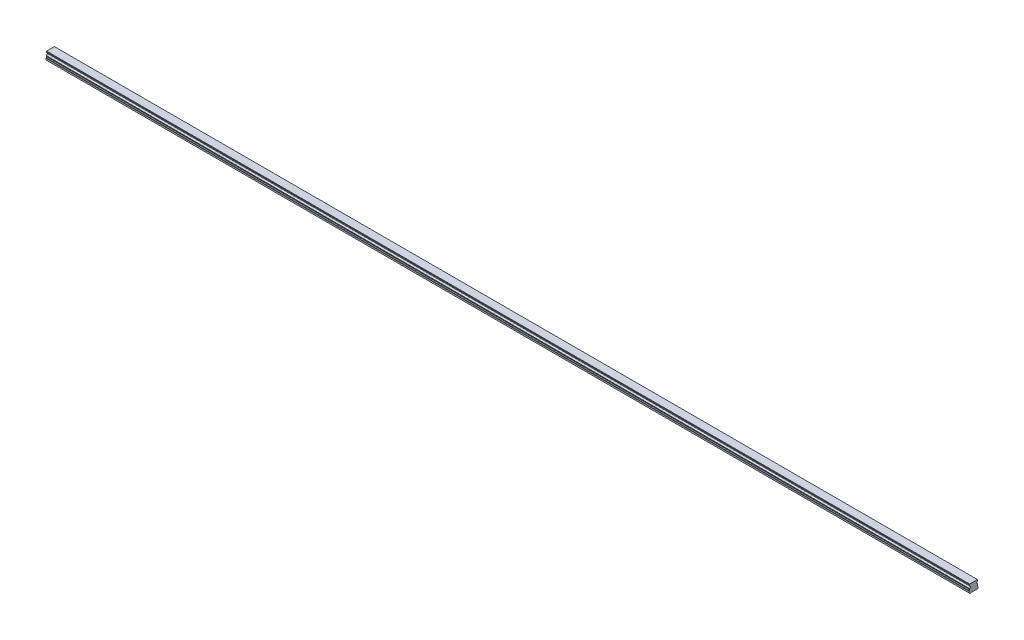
ISO-10303-21;
HEADER;
FILE_DESCRIPTION(('STEP AP214'),'2;1');
FILE_NAME('part.step','',(''),(''),'','','');
FILE_SCHEMA(('AUTOMOTIVE_DESIGN { 1 0 10303 214 1 1 1 1 }'));
ENDSEC;
DATA;
#1=APPLICATION_CONTEXT('core data for automotive mechanical design processes');
#2=APPLICATION_PROTOCOL_DEFINITION('international standard','automotive_design',2000,#1);
#3=PRODUCT_CONTEXT('',#1,'mechanical');
#4=PRODUCT('Part','Part','',(#3));
#5=PRODUCT_RELATED_PRODUCT_CATEGORY('part','',(#4));
#6=PRODUCT_DEFINITION_FORMATION('','',#4);
#7=PRODUCT_DEFINITION_CONTEXT('part definition',#1,'design');
#8=PRODUCT_DEFINITION('design','',#6,#7);
#9=PRODUCT_DEFINITION_SHAPE('','',#8);
#10=(LENGTH_UNIT() NAMED_UNIT(*) SI_UNIT(.MILLI.,.METRE.));
#11=(NAMED_UNIT(*) PLANE_ANGLE_UNIT() SI_UNIT($,.RADIAN.));
#12=(NAMED_UNIT(*) SI_UNIT($,.STERADIAN.) SOLID_ANGLE_UNIT());
#13=UNCERTAINTY_MEASURE_WITH_UNIT(LENGTH_MEASURE(1.E-05),#10,'distance_accuracy_value','');
#14=(GEOMETRIC_REPRESENTATION_CONTEXT(3) GLOBAL_UNCERTAINTY_ASSIGNED_CONTEXT((#13)) GLOBAL_UNIT_ASSIGNED_CONTEXT((#10,
#11,#12)) REPRESENTATION_CONTEXT('',''));
#15=CARTESIAN_POINT('',(0.,0.,0.));
#16=DIRECTION('',(0.,0.,1.));
#17=DIRECTION('',(1.,0.,0.));
#18=AXIS2_PLACEMENT_3D('',#15,#16,#17);
#19=CARTESIAN_POINT('',(1530.,0.399999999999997,0.));
#20=DIRECTION('',(0.,-1.,0.));
#21=DIRECTION('',(0.,0.,-1.));
#22=AXIS2_PLACEMENT_3D('',#19,#20,#21);
#23=CONICAL_SURFACE('',#22,2.89999999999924,0.785398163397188);
#24=CARTESIAN_POINT('',(1530.,0.799999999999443,0.));
#25=DIRECTION('',(0.,1.,0.));
#26=DIRECTION('',(0.,0.,1.));
#27=AXIS2_PLACEMENT_3D('',#24,#25,#26);
#28=CIRCLE('',#27,2.5);
#29=CARTESIAN_POINT('',(1530.,0.799999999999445,2.5));
#30=VERTEX_POINT('',#29);
#31=EDGE_CURVE('E11',#30,#30,#28,.F.);
#32=ORIENTED_EDGE('',*,*,#31,.F.);
#33=EDGE_LOOP('',(#32));
#34=FACE_BOUND('',#33,.T.);
#35=CARTESIAN_POINT('',(1530.,0.399999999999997,0.));
#36=DIRECTION('',(0.,1.,0.));
#37=DIRECTION('',(0.,0.,1.));
#38=AXIS2_PLACEMENT_3D('',#35,#36,#37);
#39=CIRCLE('',#38,2.89999999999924);
#40=CARTESIAN_POINT('',(1530.,0.399999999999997,2.89999999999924));
#41=VERTEX_POINT('',#40);
#42=EDGE_CURVE('E708',#41,#41,#39,.T.);
#43=ORIENTED_EDGE('',*,*,#42,.F.);
#44=EDGE_LOOP('',(#43));
#45=FACE_BOUND('',#44,.T.);
#46=ADVANCED_FACE('F39',(#34,#45),#23,.F.);
#47=CARTESIAN_POINT('',(1530.,7.,0.));
#48=DIRECTION('',(0.,-1.,0.));
#49=DIRECTION('',(0.,0.,-1.));
#50=AXIS2_PLACEMENT_3D('',#47,#48,#49);
#51=CYLINDRICAL_SURFACE('',#50,2.5);
#52=ORIENTED_EDGE('',*,*,#31,.T.);
#53=EDGE_LOOP('',(#52));
#54=FACE_BOUND('',#53,.T.);
#55=CARTESIAN_POINT('',(1530.,7.,0.));
#56=DIRECTION('',(0.,-1.,0.));
#57=DIRECTION('',(0.,0.,-1.));
#58=AXIS2_PLACEMENT_3D('',#55,#56,#57);
#59=CIRCLE('',#58,2.5);
#60=CARTESIAN_POINT('',(1530.,7.,-2.50000000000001));
#61=VERTEX_POINT('',#60);
#62=EDGE_CURVE('E49',#61,#61,#59,.T.);
#63=ORIENTED_EDGE('',*,*,#62,.F.);
#64=EDGE_LOOP('',(#63));
#65=FACE_BOUND('',#64,.T.);
#66=ADVANCED_FACE('F1000',(#54,#65),#51,.F.);
#67=CARTESIAN_POINT('',(1530.,7.,0.));
#68=DIRECTION('',(0.,-1.,0.));
#69=DIRECTION('',(0.,0.,-1.));
#70=AXIS2_PLACEMENT_3D('',#67,#68,#69);
#71=PLANE('',#70);
#72=CARTESIAN_POINT('',(1530.,7.,0.));
#73=DIRECTION('',(0.,-1.,0.));
#74=DIRECTION('',(0.,0.,-1.));
#75=AXIS2_PLACEMENT_3D('',#72,#73,#74);
#76=CIRCLE('',#75,2.1);
#77=CARTESIAN_POINT('',(1530.,7.,-2.1));
#78=VERTEX_POINT('',#77);
#79=EDGE_CURVE('E42',#78,#78,#76,.T.);
#80=ORIENTED_EDGE('',*,*,#79,.F.);
#81=EDGE_LOOP('',(#80));
#82=FACE_BOUND('',#81,.T.);
#83=ORIENTED_EDGE('',*,*,#62,.T.);
#84=EDGE_LOOP('',(#83));
#85=FACE_BOUND('',#84,.T.);
#86=ADVANCED_FACE('F1005',(#82,#85),#71,.T.);
#87=CARTESIAN_POINT('',(1470.,0.399999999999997,0.));
#88=DIRECTION('',(0.,-1.,0.));
#89=DIRECTION('',(0.,0.,-1.));
#90=AXIS2_PLACEMENT_3D('',#87,#88,#89);
#91=CONICAL_SURFACE('',#90,2.89999999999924,0.785398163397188);
#92=CARTESIAN_POINT('',(1470.,0.799999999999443,0.));
#93=DIRECTION('',(0.,1.,0.));
#94=DIRECTION('',(0.,0.,1.));
#95=AXIS2_PLACEMENT_3D('',#92,#93,#94);
#96=CIRCLE('',#95,2.5);
#97=CARTESIAN_POINT('',(1470.,0.799999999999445,2.5));
#98=VERTEX_POINT('',#97);
#99=EDGE_CURVE('E704',#98,#98,#96,.F.);
#100=ORIENTED_EDGE('',*,*,#99,.F.);
#101=EDGE_LOOP('',(#100));
#102=FACE_BOUND('',#101,.T.);
#103=CARTESIAN_POINT('',(1470.,0.399999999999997,0.));
#104=DIRECTION('',(0.,1.,0.));
#105=DIRECTION('',(0.,0.,1.));
#106=AXIS2_PLACEMENT_3D('',#103,#104,#105);
#107=CIRCLE('',#106,2.89999999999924);
#108=CARTESIAN_POINT('',(1470.,0.399999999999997,2.89999999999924));
#109=VERTEX_POINT('',#108);
#110=EDGE_CURVE('E696',#109,#109,#107,.T.);
#111=ORIENTED_EDGE('',*,*,#110,.F.);
#112=EDGE_LOOP('',(#111));
#113=FACE_BOUND('',#112,.T.);
#114=ADVANCED_FACE('F1356',(#102,#113),#91,.F.);
#115=CARTESIAN_POINT('',(1470.,7.,0.));
#116=DIRECTION('',(0.,-1.,0.));
#117=DIRECTION('',(0.,0.,-1.));
#118=AXIS2_PLACEMENT_3D('',#115,#116,#117);
#119=CYLINDRICAL_SURFACE('',#118,2.5);
#120=ORIENTED_EDGE('',*,*,#99,.T.);
#121=EDGE_LOOP('',(#120));
#122=FACE_BOUND('',#121,.T.);
#123=CARTESIAN_POINT('',(1470.,7.,0.));
#124=DIRECTION('',(0.,-1.,0.));
#125=DIRECTION('',(0.,0.,-1.));
#126=AXIS2_PLACEMENT_3D('',#123,#124,#125);
#127=CIRCLE('',#126,2.5);
#128=CARTESIAN_POINT('',(1470.,7.,-2.50000000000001));
#129=VERTEX_POINT('',#128);
#130=EDGE_CURVE('E700',#129,#129,#127,.T.);
#131=ORIENTED_EDGE('',*,*,#130,.F.);
#132=EDGE_LOOP('',(#131));
#133=FACE_BOUND('',#132,.T.);
#134=ADVANCED_FACE('F1352',(#122,#133),#119,.F.);
#135=CARTESIAN_POINT('',(1470.,7.,0.));
#136=DIRECTION('',(0.,-1.,0.));
#137=DIRECTION('',(0.,0.,-1.));
#138=AXIS2_PLACEMENT_3D('',#135,#136,#137);
#139=PLANE('',#138);
#140=CARTESIAN_POINT('',(1470.,7.,0.));
#141=DIRECTION('',(0.,-1.,0.));
#142=DIRECTION('',(0.,0.,-1.));
#143=AXIS2_PLACEMENT_3D('',#140,#141,#142);
#144=CIRCLE('',#143,2.1);
#145=CARTESIAN_POINT('',(1470.,7.,-2.1));
#146=VERTEX_POINT('',#145);
#147=EDGE_CURVE('E807',#146,#146,#144,.T.);
#148=ORIENTED_EDGE('',*,*,#147,.F.);
#149=EDGE_LOOP('',(#148));
#150=FACE_BOUND('',#149,.T.);
#151=ORIENTED_EDGE('',*,*,#130,.T.);
#152=EDGE_LOOP('',(#151));
#153=FACE_BOUND('',#152,.T.);
#154=ADVANCED_FACE('F1348',(#150,#153),#139,.T.);
#155=CARTESIAN_POINT('',(1410.,0.399999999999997,0.));
#156=DIRECTION('',(0.,-1.,0.));
#157=DIRECTION('',(0.,0.,-1.));
#158=AXIS2_PLACEMENT_3D('',#155,#156,#157);
#159=CONICAL_SURFACE('',#158,2.89999999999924,0.785398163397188);
#160=CARTESIAN_POINT('',(1410.,0.799999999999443,0.));
#161=DIRECTION('',(0.,1.,0.));
#162=DIRECTION('',(0.,0.,1.));
#163=AXIS2_PLACEMENT_3D('',#160,#161,#162);
#164=CIRCLE('',#163,2.5);
#165=CARTESIAN_POINT('',(1410.,0.799999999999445,2.5));
#166=VERTEX_POINT('',#165);
#167=EDGE_CURVE('E692',#166,#166,#164,.F.);
#168=ORIENTED_EDGE('',*,*,#167,.F.);
#169=EDGE_LOOP('',(#168));
#170=FACE_BOUND('',#169,.T.);
#171=CARTESIAN_POINT('',(1410.,0.399999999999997,0.));
#172=DIRECTION('',(0.,1.,0.));
#173=DIRECTION('',(0.,0.,1.));
#174=AXIS2_PLACEMENT_3D('',#171,#172,#173);
#175=CIRCLE('',#174,2.89999999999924);
#176=CARTESIAN_POINT('',(1410.,0.399999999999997,2.89999999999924));
#177=VERTEX_POINT('',#176);
#178=EDGE_CURVE('E684',#177,#177,#175,.T.);
#179=ORIENTED_EDGE('',*,*,#178,.F.);
#180=EDGE_LOOP('',(#179));
#181=FACE_BOUND('',#180,.T.);
#182=ADVANCED_FACE('F1344',(#170,#181),#159,.F.);
#183=CARTESIAN_POINT('',(1410.,7.,0.));
#184=DIRECTION('',(0.,-1.,0.));
#185=DIRECTION('',(0.,0.,-1.));
#186=AXIS2_PLACEMENT_3D('',#183,#184,#185);
#187=CYLINDRICAL_SURFACE('',#186,2.5);
#188=ORIENTED_EDGE('',*,*,#167,.T.);
#189=EDGE_LOOP('',(#188));
#190=FACE_BOUND('',#189,.T.);
#191=CARTESIAN_POINT('',(1410.,7.,0.));
#192=DIRECTION('',(0.,-1.,0.));
#193=DIRECTION('',(0.,0.,-1.));
#194=AXIS2_PLACEMENT_3D('',#191,#192,#193);
#195=CIRCLE('',#194,2.5);
#196=CARTESIAN_POINT('',(1410.,7.,-2.50000000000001));
#197=VERTEX_POINT('',#196);
#198=EDGE_CURVE('E688',#197,#197,#195,.T.);
#199=ORIENTED_EDGE('',*,*,#198,.F.);
#200=EDGE_LOOP('',(#199));
#201=FACE_BOUND('',#200,.T.);
#202=ADVANCED_FACE('F1340',(#190,#201),#187,.F.);
#203=CARTESIAN_POINT('',(1410.,7.,0.));
#204=DIRECTION('',(0.,-1.,0.));
#205=DIRECTION('',(0.,0.,-1.));
#206=AXIS2_PLACEMENT_3D('',#203,#204,#205);
#207=PLANE('',#206);
#208=CARTESIAN_POINT('',(1410.,7.,0.));
#209=DIRECTION('',(0.,-1.,0.));
#210=DIRECTION('',(0.,0.,-1.));
#211=AXIS2_PLACEMENT_3D('',#208,#209,#210);
#212=CIRCLE('',#211,2.1);
#213=CARTESIAN_POINT('',(1410.,7.,-2.1));
#214=VERTEX_POINT('',#213);
#215=EDGE_CURVE('E804',#214,#214,#212,.T.);
#216=ORIENTED_EDGE('',*,*,#215,.F.);
#217=EDGE_LOOP('',(#216));
#218=FACE_BOUND('',#217,.T.);
#219=ORIENTED_EDGE('',*,*,#198,.T.);
#220=EDGE_LOOP('',(#219));
#221=FACE_BOUND('',#220,.T.);
#222=ADVANCED_FACE('F1336',(#218,#221),#207,.T.);
#223=CARTESIAN_POINT('',(1350.,0.399999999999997,0.));
#224=DIRECTION('',(0.,-1.,0.));
#225=DIRECTION('',(0.,0.,-1.));
#226=AXIS2_PLACEMENT_3D('',#223,#224,#225);
#227=CONICAL_SURFACE('',#226,2.89999999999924,0.785398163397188);
#228=CARTESIAN_POINT('',(1350.,0.799999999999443,0.));
#229=DIRECTION('',(0.,1.,0.));
#230=DIRECTION('',(0.,0.,1.));
#231=AXIS2_PLACEMENT_3D('',#228,#229,#230);
#232=CIRCLE('',#231,2.5);
#233=CARTESIAN_POINT('',(1350.,0.799999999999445,2.5));
#234=VERTEX_POINT('',#233);
#235=EDGE_CURVE('E680',#234,#234,#232,.F.);
#236=ORIENTED_EDGE('',*,*,#235,.F.);
#237=EDGE_LOOP('',(#236));
#238=FACE_BOUND('',#237,.T.);
#239=CARTESIAN_POINT('',(1350.,0.399999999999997,0.));
#240=DIRECTION('',(0.,1.,0.));
#241=DIRECTION('',(0.,0.,1.));
#242=AXIS2_PLACEMENT_3D('',#239,#240,#241);
#243=CIRCLE('',#242,2.89999999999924);
#244=CARTESIAN_POINT('',(1350.,0.399999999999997,2.89999999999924));
#245=VERTEX_POINT('',#244);
#246=EDGE_CURVE('E672',#245,#245,#243,.T.);
#247=ORIENTED_EDGE('',*,*,#246,.F.);
#248=EDGE_LOOP('',(#247));
#249=FACE_BOUND('',#248,.T.);
#250=ADVANCED_FACE('F1332',(#238,#249),#227,.F.);
#251=CARTESIAN_POINT('',(1350.,7.,0.));
#252=DIRECTION('',(0.,-1.,0.));
#253=DIRECTION('',(0.,0.,-1.));
#254=AXIS2_PLACEMENT_3D('',#251,#252,#253);
#255=CYLINDRICAL_SURFACE('',#254,2.5);
#256=ORIENTED_EDGE('',*,*,#235,.T.);
#257=EDGE_LOOP('',(#256));
#258=FACE_BOUND('',#257,.T.);
#259=CARTESIAN_POINT('',(1350.,7.,0.));
#260=DIRECTION('',(0.,-1.,0.));
#261=DIRECTION('',(0.,0.,-1.));
#262=AXIS2_PLACEMENT_3D('',#259,#260,#261);
#263=CIRCLE('',#262,2.5);
#264=CARTESIAN_POINT('',(1350.,7.,-2.50000000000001));
#265=VERTEX_POINT('',#264);
#266=EDGE_CURVE('E676',#265,#265,#263,.T.);
#267=ORIENTED_EDGE('',*,*,#266,.F.);
#268=EDGE_LOOP('',(#267));
#269=FACE_BOUND('',#268,.T.);
#270=ADVANCED_FACE('F1328',(#258,#269),#255,.F.);
#271=CARTESIAN_POINT('',(1350.,7.,0.));
#272=DIRECTION('',(0.,-1.,0.));
#273=DIRECTION('',(0.,0.,-1.));
#274=AXIS2_PLACEMENT_3D('',#271,#272,#273);
#275=PLANE('',#274);
#276=CARTESIAN_POINT('',(1350.,7.,0.));
#277=DIRECTION('',(0.,-1.,0.));
#278=DIRECTION('',(0.,0.,-1.));
#279=AXIS2_PLACEMENT_3D('',#276,#277,#278);
#280=CIRCLE('',#279,2.1);
#281=CARTESIAN_POINT('',(1350.,7.,-2.1));
#282=VERTEX_POINT('',#281);
#283=EDGE_CURVE('E800',#282,#282,#280,.T.);
#284=ORIENTED_EDGE('',*,*,#283,.F.);
#285=EDGE_LOOP('',(#284));
#286=FACE_BOUND('',#285,.T.);
#287=ORIENTED_EDGE('',*,*,#266,.T.);
#288=EDGE_LOOP('',(#287));
#289=FACE_BOUND('',#288,.T.);
#290=ADVANCED_FACE('F1324',(#286,#289),#275,.T.);
#291=CARTESIAN_POINT('',(1290.,0.399999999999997,0.));
#292=DIRECTION('',(0.,-1.,0.));
#293=DIRECTION('',(0.,0.,-1.));
#294=AXIS2_PLACEMENT_3D('',#291,#292,#293);
#295=CONICAL_SURFACE('',#294,2.89999999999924,0.785398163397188);
#296=CARTESIAN_POINT('',(1290.,0.799999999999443,0.));
#297=DIRECTION('',(0.,1.,0.));
#298=DIRECTION('',(0.,0.,1.));
#299=AXIS2_PLACEMENT_3D('',#296,#297,#298);
#300=CIRCLE('',#299,2.5);
#301=CARTESIAN_POINT('',(1290.,0.799999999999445,2.5));
#302=VERTEX_POINT('',#301);
#303=EDGE_CURVE('E668',#302,#302,#300,.F.);
#304=ORIENTED_EDGE('',*,*,#303,.F.);
#305=EDGE_LOOP('',(#304));
#306=FACE_BOUND('',#305,.T.);
#307=CARTESIAN_POINT('',(1290.,0.399999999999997,0.));
#308=DIRECTION('',(0.,1.,0.));
#309=DIRECTION('',(0.,0.,1.));
#310=AXIS2_PLACEMENT_3D('',#307,#308,#309);
#311=CIRCLE('',#310,2.89999999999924);
#312=CARTESIAN_POINT('',(1290.,0.399999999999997,2.89999999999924));
#313=VERTEX_POINT('',#312);
#314=EDGE_CURVE('E660',#313,#313,#311,.T.);
#315=ORIENTED_EDGE('',*,*,#314,.F.);
#316=EDGE_LOOP('',(#315));
#317=FACE_BOUND('',#316,.T.);
#318=ADVANCED_FACE('F1320',(#306,#317),#295,.F.);
#319=CARTESIAN_POINT('',(1290.,7.,0.));
#320=DIRECTION('',(0.,-1.,0.));
#321=DIRECTION('',(0.,0.,-1.));
#322=AXIS2_PLACEMENT_3D('',#319,#320,#321);
#323=CYLINDRICAL_SURFACE('',#322,2.5);
#324=ORIENTED_EDGE('',*,*,#303,.T.);
#325=EDGE_LOOP('',(#324));
#326=FACE_BOUND('',#325,.T.);
#327=CARTESIAN_POINT('',(1290.,7.,0.));
#328=DIRECTION('',(0.,-1.,0.));
#329=DIRECTION('',(0.,0.,-1.));
#330=AXIS2_PLACEMENT_3D('',#327,#328,#329);
#331=CIRCLE('',#330,2.5);
#332=CARTESIAN_POINT('',(1290.,7.,-2.50000000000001));
#333=VERTEX_POINT('',#332);
#334=EDGE_CURVE('E664',#333,#333,#331,.T.);
#335=ORIENTED_EDGE('',*,*,#334,.F.);
#336=EDGE_LOOP('',(#335));
#337=FACE_BOUND('',#336,.T.);
#338=ADVANCED_FACE('F1316',(#326,#337),#323,.F.);
#339=CARTESIAN_POINT('',(1290.,7.,0.));
#340=DIRECTION('',(0.,-1.,0.));
#341=DIRECTION('',(0.,0.,-1.));
#342=AXIS2_PLACEMENT_3D('',#339,#340,#341);
#343=PLANE('',#342);
#344=CARTESIAN_POINT('',(1290.,7.,0.));
#345=DIRECTION('',(0.,-1.,0.));
#346=DIRECTION('',(0.,0.,-1.));
#347=AXIS2_PLACEMENT_3D('',#344,#345,#346);
#348=CIRCLE('',#347,2.1);
#349=CARTESIAN_POINT('',(1290.,7.,-2.1));
#350=VERTEX_POINT('',#349);
#351=EDGE_CURVE('E796',#350,#350,#348,.T.);
#352=ORIENTED_EDGE('',*,*,#351,.F.);
#353=EDGE_LOOP('',(#352));
#354=FACE_BOUND('',#353,.T.);
#355=ORIENTED_EDGE('',*,*,#334,.T.);
#356=EDGE_LOOP('',(#355));
#357=FACE_BOUND('',#356,.T.);
#358=ADVANCED_FACE('F1312',(#354,#357),#343,.T.);
#359=CARTESIAN_POINT('',(1230.,0.399999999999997,0.));
#360=DIRECTION('',(0.,-1.,0.));
#361=DIRECTION('',(0.,0.,-1.));
#362=AXIS2_PLACEMENT_3D('',#359,#360,#361);
#363=CONICAL_SURFACE('',#362,2.89999999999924,0.785398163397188);
#364=CARTESIAN_POINT('',(1230.,0.799999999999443,0.));
#365=DIRECTION('',(0.,1.,0.));
#366=DIRECTION('',(0.,0.,1.));
#367=AXIS2_PLACEMENT_3D('',#364,#365,#366);
#368=CIRCLE('',#367,2.5);
#369=CARTESIAN_POINT('',(1230.,0.799999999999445,2.5));
#370=VERTEX_POINT('',#369);
#371=EDGE_CURVE('E656',#370,#370,#368,.F.);
#372=ORIENTED_EDGE('',*,*,#371,.F.);
#373=EDGE_LOOP('',(#372));
#374=FACE_BOUND('',#373,.T.);
#375=CARTESIAN_POINT('',(1230.,0.399999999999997,0.));
#376=DIRECTION('',(0.,1.,0.));
#377=DIRECTION('',(0.,0.,1.));
#378=AXIS2_PLACEMENT_3D('',#375,#376,#377);
#379=CIRCLE('',#378,2.89999999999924);
#380=CARTESIAN_POINT('',(1230.,0.399999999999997,2.89999999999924));
#381=VERTEX_POINT('',#380);
#382=EDGE_CURVE('E648',#381,#381,#379,.T.);
#383=ORIENTED_EDGE('',*,*,#382,.F.);
#384=EDGE_LOOP('',(#383));
#385=FACE_BOUND('',#384,.T.);
#386=ADVANCED_FACE('F1308',(#374,#385),#363,.F.);
#387=CARTESIAN_POINT('',(1230.,7.,0.));
#388=DIRECTION('',(0.,-1.,0.));
#389=DIRECTION('',(0.,0.,-1.));
#390=AXIS2_PLACEMENT_3D('',#387,#388,#389);
#391=CYLINDRICAL_SURFACE('',#390,2.5);
#392=ORIENTED_EDGE('',*,*,#371,.T.);
#393=EDGE_LOOP('',(#392));
#394=FACE_BOUND('',#393,.T.);
#395=CARTESIAN_POINT('',(1230.,7.,0.));
#396=DIRECTION('',(0.,-1.,0.));
#397=DIRECTION('',(0.,0.,-1.));
#398=AXIS2_PLACEMENT_3D('',#395,#396,#397);
#399=CIRCLE('',#398,2.5);
#400=CARTESIAN_POINT('',(1230.,7.,-2.50000000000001));
#401=VERTEX_POINT('',#400);
#402=EDGE_CURVE('E652',#401,#401,#399,.T.);
#403=ORIENTED_EDGE('',*,*,#402,.F.);
#404=EDGE_LOOP('',(#403));
#405=FACE_BOUND('',#404,.T.);
#406=ADVANCED_FACE('F1304',(#394,#405),#391,.F.);
#407=CARTESIAN_POINT('',(1230.,7.,0.));
#408=DIRECTION('',(0.,-1.,0.));
#409=DIRECTION('',(0.,0.,-1.));
#410=AXIS2_PLACEMENT_3D('',#407,#408,#409);
#411=PLANE('',#410);
#412=CARTESIAN_POINT('',(1230.,7.,0.));
#413=DIRECTION('',(0.,-1.,0.));
#414=DIRECTION('',(0.,0.,-1.));
#415=AXIS2_PLACEMENT_3D('',#412,#413,#414);
#416=CIRCLE('',#415,2.1);
#417=CARTESIAN_POINT('',(1230.,7.,-2.1));
#418=VERTEX_POINT('',#417);
#419=EDGE_CURVE('E792',#418,#418,#416,.T.);
#420=ORIENTED_EDGE('',*,*,#419,.F.);
#421=EDGE_LOOP('',(#420));
#422=FACE_BOUND('',#421,.T.);
#423=ORIENTED_EDGE('',*,*,#402,.T.);
#424=EDGE_LOOP('',(#423));
#425=FACE_BOUND('',#424,.T.);
#426=ADVANCED_FACE('F1300',(#422,#425),#411,.T.);
#427=CARTESIAN_POINT('',(1170.,0.399999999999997,0.));
#428=DIRECTION('',(0.,-1.,0.));
#429=DIRECTION('',(0.,0.,-1.));
#430=AXIS2_PLACEMENT_3D('',#427,#428,#429);
#431=CONICAL_SURFACE('',#430,2.89999999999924,0.785398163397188);
#432=CARTESIAN_POINT('',(1170.,0.799999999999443,0.));
#433=DIRECTION('',(0.,1.,0.));
#434=DIRECTION('',(0.,0.,1.));
#435=AXIS2_PLACEMENT_3D('',#432,#433,#434);
#436=CIRCLE('',#435,2.5);
#437=CARTESIAN_POINT('',(1170.,0.799999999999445,2.5));
#438=VERTEX_POINT('',#437);
#439=EDGE_CURVE('E644',#438,#438,#436,.F.);
#440=ORIENTED_EDGE('',*,*,#439,.F.);
#441=EDGE_LOOP('',(#440));
#442=FACE_BOUND('',#441,.T.);
#443=CARTESIAN_POINT('',(1170.,0.399999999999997,0.));
#444=DIRECTION('',(0.,1.,0.));
#445=DIRECTION('',(0.,0.,1.));
#446=AXIS2_PLACEMENT_3D('',#443,#444,#445);
#447=CIRCLE('',#446,2.89999999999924);
#448=CARTESIAN_POINT('',(1170.,0.399999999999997,2.89999999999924));
#449=VERTEX_POINT('',#448);
#450=EDGE_CURVE('E636',#449,#449,#447,.T.);
#451=ORIENTED_EDGE('',*,*,#450,.F.);
#452=EDGE_LOOP('',(#451));
#453=FACE_BOUND('',#452,.T.);
#454=ADVANCED_FACE('F1296',(#442,#453),#431,.F.);
#455=CARTESIAN_POINT('',(1170.,7.,0.));
#456=DIRECTION('',(0.,-1.,0.));
#457=DIRECTION('',(0.,0.,-1.));
#458=AXIS2_PLACEMENT_3D('',#455,#456,#457);
#459=CYLINDRICAL_SURFACE('',#458,2.5);
#460=ORIENTED_EDGE('',*,*,#439,.T.);
#461=EDGE_LOOP('',(#460));
#462=FACE_BOUND('',#461,.T.);
#463=CARTESIAN_POINT('',(1170.,7.,0.));
#464=DIRECTION('',(0.,-1.,0.));
#465=DIRECTION('',(0.,0.,-1.));
#466=AXIS2_PLACEMENT_3D('',#463,#464,#465);
#467=CIRCLE('',#466,2.5);
#468=CARTESIAN_POINT('',(1170.,7.,-2.50000000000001));
#469=VERTEX_POINT('',#468);
#470=EDGE_CURVE('E640',#469,#469,#467,.T.);
#471=ORIENTED_EDGE('',*,*,#470,.F.);
#472=EDGE_LOOP('',(#471));
#473=FACE_BOUND('',#472,.T.);
#474=ADVANCED_FACE('F1292',(#462,#473),#459,.F.);
#475=CARTESIAN_POINT('',(1170.,7.,0.));
#476=DIRECTION('',(0.,-1.,0.));
#477=DIRECTION('',(0.,0.,-1.));
#478=AXIS2_PLACEMENT_3D('',#475,#476,#477);
#479=PLANE('',#478);
#480=CARTESIAN_POINT('',(1170.,7.,0.));
#481=DIRECTION('',(0.,-1.,0.));
#482=DIRECTION('',(0.,0.,-1.));
#483=AXIS2_PLACEMENT_3D('',#480,#481,#482);
#484=CIRCLE('',#483,2.1);
#485=CARTESIAN_POINT('',(1170.,7.,-2.1));
#486=VERTEX_POINT('',#485);
#487=EDGE_CURVE('E788',#486,#486,#484,.T.);
#488=ORIENTED_EDGE('',*,*,#487,.F.);
#489=EDGE_LOOP('',(#488));
#490=FACE_BOUND('',#489,.T.);
#491=ORIENTED_EDGE('',*,*,#470,.T.);
#492=EDGE_LOOP('',(#491));
#493=FACE_BOUND('',#492,.T.);
#494=ADVANCED_FACE('F1288',(#490,#493),#479,.T.);
#495=CARTESIAN_POINT('',(1110.,0.399999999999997,0.));
#496=DIRECTION('',(0.,-1.,0.));
#497=DIRECTION('',(0.,0.,-1.));
#498=AXIS2_PLACEMENT_3D('',#495,#496,#497);
#499=CONICAL_SURFACE('',#498,2.89999999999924,0.785398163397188);
#500=CARTESIAN_POINT('',(1110.,0.799999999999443,0.));
#501=DIRECTION('',(0.,1.,0.));
#502=DIRECTION('',(0.,0.,1.));
#503=AXIS2_PLACEMENT_3D('',#500,#501,#502);
#504=CIRCLE('',#503,2.5);
#505=CARTESIAN_POINT('',(1110.,0.799999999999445,2.5));
#506=VERTEX_POINT('',#505);
#507=EDGE_CURVE('E632',#506,#506,#504,.F.);
#508=ORIENTED_EDGE('',*,*,#507,.F.);
#509=EDGE_LOOP('',(#508));
#510=FACE_BOUND('',#509,.T.);
#511=CARTESIAN_POINT('',(1110.,0.399999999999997,0.));
#512=DIRECTION('',(0.,1.,0.));
#513=DIRECTION('',(0.,0.,1.));
#514=AXIS2_PLACEMENT_3D('',#511,#512,#513);
#515=CIRCLE('',#514,2.89999999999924);
#516=CARTESIAN_POINT('',(1110.,0.399999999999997,2.89999999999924));
#517=VERTEX_POINT('',#516);
#518=EDGE_CURVE('E624',#517,#517,#515,.T.);
#519=ORIENTED_EDGE('',*,*,#518,.F.);
#520=EDGE_LOOP('',(#519));
#521=FACE_BOUND('',#520,.T.);
#522=ADVANCED_FACE('F1284',(#510,#521),#499,.F.);
#523=CARTESIAN_POINT('',(1110.,7.,0.));
#524=DIRECTION('',(0.,-1.,0.));
#525=DIRECTION('',(0.,0.,-1.));
#526=AXIS2_PLACEMENT_3D('',#523,#524,#525);
#527=CYLINDRICAL_SURFACE('',#526,2.5);
#528=ORIENTED_EDGE('',*,*,#507,.T.);
#529=EDGE_LOOP('',(#528));
#530=FACE_BOUND('',#529,.T.);
#531=CARTESIAN_POINT('',(1110.,7.,0.));
#532=DIRECTION('',(0.,-1.,0.));
#533=DIRECTION('',(0.,0.,-1.));
#534=AXIS2_PLACEMENT_3D('',#531,#532,#533);
#535=CIRCLE('',#534,2.5);
#536=CARTESIAN_POINT('',(1110.,7.,-2.50000000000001));
#537=VERTEX_POINT('',#536);
#538=EDGE_CURVE('E628',#537,#537,#535,.T.);
#539=ORIENTED_EDGE('',*,*,#538,.F.);
#540=EDGE_LOOP('',(#539));
#541=FACE_BOUND('',#540,.T.);
#542=ADVANCED_FACE('F1280',(#530,#541),#527,.F.);
#543=CARTESIAN_POINT('',(1110.,7.,0.));
#544=DIRECTION('',(0.,-1.,0.));
#545=DIRECTION('',(0.,0.,-1.));
#546=AXIS2_PLACEMENT_3D('',#543,#544,#545);
#547=PLANE('',#546);
#548=CARTESIAN_POINT('',(1110.,7.,0.));
#549=DIRECTION('',(0.,-1.,0.));
#550=DIRECTION('',(0.,0.,-1.));
#551=AXIS2_PLACEMENT_3D('',#548,#549,#550);
#552=CIRCLE('',#551,2.1);
#553=CARTESIAN_POINT('',(1110.,7.,-2.1));
#554=VERTEX_POINT('',#553);
#555=EDGE_CURVE('E784',#554,#554,#552,.T.);
#556=ORIENTED_EDGE('',*,*,#555,.F.);
#557=EDGE_LOOP('',(#556));
#558=FACE_BOUND('',#557,.T.);
#559=ORIENTED_EDGE('',*,*,#538,.T.);
#560=EDGE_LOOP('',(#559));
#561=FACE_BOUND('',#560,.T.);
#562=ADVANCED_FACE('F1276',(#558,#561),#547,.T.);
#563=CARTESIAN_POINT('',(1050.,0.399999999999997,0.));
#564=DIRECTION('',(0.,-1.,0.));
#565=DIRECTION('',(0.,0.,-1.));
#566=AXIS2_PLACEMENT_3D('',#563,#564,#565);
#567=CONICAL_SURFACE('',#566,2.89999999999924,0.785398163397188);
#568=CARTESIAN_POINT('',(1050.,0.799999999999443,0.));
#569=DIRECTION('',(0.,1.,0.));
#570=DIRECTION('',(0.,0.,1.));
#571=AXIS2_PLACEMENT_3D('',#568,#569,#570);
#572=CIRCLE('',#571,2.5);
#573=CARTESIAN_POINT('',(1050.,0.799999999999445,2.5));
#574=VERTEX_POINT('',#573);
#575=EDGE_CURVE('E620',#574,#574,#572,.F.);
#576=ORIENTED_EDGE('',*,*,#575,.F.);
#577=EDGE_LOOP('',(#576));
#578=FACE_BOUND('',#577,.T.);
#579=CARTESIAN_POINT('',(1050.,0.399999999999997,0.));
#580=DIRECTION('',(0.,1.,0.));
#581=DIRECTION('',(0.,0.,1.));
#582=AXIS2_PLACEMENT_3D('',#579,#580,#581);
#583=CIRCLE('',#582,2.89999999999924);
#584=CARTESIAN_POINT('',(1050.,0.399999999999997,2.89999999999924));
#585=VERTEX_POINT('',#584);
#586=EDGE_CURVE('E612',#585,#585,#583,.T.);
#587=ORIENTED_EDGE('',*,*,#586,.F.);
#588=EDGE_LOOP('',(#587));
#589=FACE_BOUND('',#588,.T.);
#590=ADVANCED_FACE('F1272',(#578,#589),#567,.F.);
#591=CARTESIAN_POINT('',(1050.,7.,0.));
#592=DIRECTION('',(0.,-1.,0.));
#593=DIRECTION('',(0.,0.,-1.));
#594=AXIS2_PLACEMENT_3D('',#591,#592,#593);
#595=CYLINDRICAL_SURFACE('',#594,2.5);
#596=ORIENTED_EDGE('',*,*,#575,.T.);
#597=EDGE_LOOP('',(#596));
#598=FACE_BOUND('',#597,.T.);
#599=CARTESIAN_POINT('',(1050.,7.,0.));
#600=DIRECTION('',(0.,-1.,0.));
#601=DIRECTION('',(0.,0.,-1.));
#602=AXIS2_PLACEMENT_3D('',#599,#600,#601);
#603=CIRCLE('',#602,2.5);
#604=CARTESIAN_POINT('',(1050.,7.,-2.50000000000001));
#605=VERTEX_POINT('',#604);
#606=EDGE_CURVE('E616',#605,#605,#603,.T.);
#607=ORIENTED_EDGE('',*,*,#606,.F.);
#608=EDGE_LOOP('',(#607));
#609=FACE_BOUND('',#608,.T.);
#610=ADVANCED_FACE('F1268',(#598,#609),#595,.F.);
#611=CARTESIAN_POINT('',(1050.,7.,0.));
#612=DIRECTION('',(0.,-1.,0.));
#613=DIRECTION('',(0.,0.,-1.));
#614=AXIS2_PLACEMENT_3D('',#611,#612,#613);
#615=PLANE('',#614);
#616=CARTESIAN_POINT('',(1050.,7.,0.));
#617=DIRECTION('',(0.,-1.,0.));
#618=DIRECTION('',(0.,0.,-1.));
#619=AXIS2_PLACEMENT_3D('',#616,#617,#618);
#620=CIRCLE('',#619,2.1);
#621=CARTESIAN_POINT('',(1050.,7.,-2.1));
#622=VERTEX_POINT('',#621);
#623=EDGE_CURVE('E780',#622,#622,#620,.T.);
#624=ORIENTED_EDGE('',*,*,#623,.F.);
#625=EDGE_LOOP('',(#624));
#626=FACE_BOUND('',#625,.T.);
#627=ORIENTED_EDGE('',*,*,#606,.T.);
#628=EDGE_LOOP('',(#627));
#629=FACE_BOUND('',#628,.T.);
#630=ADVANCED_FACE('F1264',(#626,#629),#615,.T.);
#631=CARTESIAN_POINT('',(990.,0.399999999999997,0.));
#632=DIRECTION('',(0.,-1.,0.));
#633=DIRECTION('',(0.,0.,-1.));
#634=AXIS2_PLACEMENT_3D('',#631,#632,#633);
#635=CONICAL_SURFACE('',#634,2.89999999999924,0.785398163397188);
#636=CARTESIAN_POINT('',(990.,0.799999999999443,0.));
#637=DIRECTION('',(0.,1.,0.));
#638=DIRECTION('',(0.,0.,1.));
#639=AXIS2_PLACEMENT_3D('',#636,#637,#638);
#640=CIRCLE('',#639,2.5);
#641=CARTESIAN_POINT('',(990.,0.799999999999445,2.5));
#642=VERTEX_POINT('',#641);
#643=EDGE_CURVE('E608',#642,#642,#640,.F.);
#644=ORIENTED_EDGE('',*,*,#643,.F.);
#645=EDGE_LOOP('',(#644));
#646=FACE_BOUND('',#645,.T.);
#647=CARTESIAN_POINT('',(990.,0.399999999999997,0.));
#648=DIRECTION('',(0.,1.,0.));
#649=DIRECTION('',(0.,0.,1.));
#650=AXIS2_PLACEMENT_3D('',#647,#648,#649);
#651=CIRCLE('',#650,2.89999999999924);
#652=CARTESIAN_POINT('',(990.,0.399999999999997,2.89999999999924));
#653=VERTEX_POINT('',#652);
#654=EDGE_CURVE('E600',#653,#653,#651,.T.);
#655=ORIENTED_EDGE('',*,*,#654,.F.);
#656=EDGE_LOOP('',(#655));
#657=FACE_BOUND('',#656,.T.);
#658=ADVANCED_FACE('F1260',(#646,#657),#635,.F.);
#659=CARTESIAN_POINT('',(990.,7.,0.));
#660=DIRECTION('',(0.,-1.,0.));
#661=DIRECTION('',(0.,0.,-1.));
#662=AXIS2_PLACEMENT_3D('',#659,#660,#661);
#663=CYLINDRICAL_SURFACE('',#662,2.5);
#664=ORIENTED_EDGE('',*,*,#643,.T.);
#665=EDGE_LOOP('',(#664));
#666=FACE_BOUND('',#665,.T.);
#667=CARTESIAN_POINT('',(990.,7.,0.));
#668=DIRECTION('',(0.,-1.,0.));
#669=DIRECTION('',(0.,0.,-1.));
#670=AXIS2_PLACEMENT_3D('',#667,#668,#669);
#671=CIRCLE('',#670,2.5);
#672=CARTESIAN_POINT('',(990.,7.,-2.50000000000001));
#673=VERTEX_POINT('',#672);
#674=EDGE_CURVE('E604',#673,#673,#671,.T.);
#675=ORIENTED_EDGE('',*,*,#674,.F.);
#676=EDGE_LOOP('',(#675));
#677=FACE_BOUND('',#676,.T.);
#678=ADVANCED_FACE('F1256',(#666,#677),#663,.F.);
#679=CARTESIAN_POINT('',(990.,7.,0.));
#680=DIRECTION('',(0.,-1.,0.));
#681=DIRECTION('',(0.,0.,-1.));
#682=AXIS2_PLACEMENT_3D('',#679,#680,#681);
#683=PLANE('',#682);
#684=CARTESIAN_POINT('',(990.,7.,0.));
#685=DIRECTION('',(0.,-1.,0.));
#686=DIRECTION('',(0.,0.,-1.));
#687=AXIS2_PLACEMENT_3D('',#684,#685,#686);
#688=CIRCLE('',#687,2.1);
#689=CARTESIAN_POINT('',(990.,7.,-2.1));
#690=VERTEX_POINT('',#689);
#691=EDGE_CURVE('E776',#690,#690,#688,.T.);
#692=ORIENTED_EDGE('',*,*,#691,.F.);
#693=EDGE_LOOP('',(#692));
#694=FACE_BOUND('',#693,.T.);
#695=ORIENTED_EDGE('',*,*,#674,.T.);
#696=EDGE_LOOP('',(#695));
#697=FACE_BOUND('',#696,.T.);
#698=ADVANCED_FACE('F1252',(#694,#697),#683,.T.);
#699=CARTESIAN_POINT('',(930.,0.399999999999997,0.));
#700=DIRECTION('',(0.,-1.,0.));
#701=DIRECTION('',(0.,0.,-1.));
#702=AXIS2_PLACEMENT_3D('',#699,#700,#701);
#703=CONICAL_SURFACE('',#702,2.89999999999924,0.785398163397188);
#704=CARTESIAN_POINT('',(930.,0.799999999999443,0.));
#705=DIRECTION('',(0.,1.,0.));
#706=DIRECTION('',(0.,0.,1.));
#707=AXIS2_PLACEMENT_3D('',#704,#705,#706);
#708=CIRCLE('',#707,2.5);
#709=CARTESIAN_POINT('',(930.,0.799999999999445,2.5));
#710=VERTEX_POINT('',#709);
#711=EDGE_CURVE('E596',#710,#710,#708,.F.);
#712=ORIENTED_EDGE('',*,*,#711,.F.);
#713=EDGE_LOOP('',(#712));
#714=FACE_BOUND('',#713,.T.);
#715=CARTESIAN_POINT('',(930.,0.399999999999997,0.));
#716=DIRECTION('',(0.,1.,0.));
#717=DIRECTION('',(0.,0.,1.));
#718=AXIS2_PLACEMENT_3D('',#715,#716,#717);
#719=CIRCLE('',#718,2.89999999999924);
#720=CARTESIAN_POINT('',(930.,0.399999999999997,2.89999999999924));
#721=VERTEX_POINT('',#720);
#722=EDGE_CURVE('E588',#721,#721,#719,.T.);
#723=ORIENTED_EDGE('',*,*,#722,.F.);
#724=EDGE_LOOP('',(#723));
#725=FACE_BOUND('',#724,.T.);
#726=ADVANCED_FACE('F1248',(#714,#725),#703,.F.);
#727=CARTESIAN_POINT('',(930.,7.,0.));
#728=DIRECTION('',(0.,-1.,0.));
#729=DIRECTION('',(0.,0.,-1.));
#730=AXIS2_PLACEMENT_3D('',#727,#728,#729);
#731=CYLINDRICAL_SURFACE('',#730,2.5);
#732=ORIENTED_EDGE('',*,*,#711,.T.);
#733=EDGE_LOOP('',(#732));
#734=FACE_BOUND('',#733,.T.);
#735=CARTESIAN_POINT('',(930.,7.,0.));
#736=DIRECTION('',(0.,-1.,0.));
#737=DIRECTION('',(0.,0.,-1.));
#738=AXIS2_PLACEMENT_3D('',#735,#736,#737);
#739=CIRCLE('',#738,2.5);
#740=CARTESIAN_POINT('',(930.,7.,-2.50000000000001));
#741=VERTEX_POINT('',#740);
#742=EDGE_CURVE('E592',#741,#741,#739,.T.);
#743=ORIENTED_EDGE('',*,*,#742,.F.);
#744=EDGE_LOOP('',(#743));
#745=FACE_BOUND('',#744,.T.);
#746=ADVANCED_FACE('F1244',(#734,#745),#731,.F.);
#747=CARTESIAN_POINT('',(930.,7.,0.));
#748=DIRECTION('',(0.,-1.,0.));
#749=DIRECTION('',(0.,0.,-1.));
#750=AXIS2_PLACEMENT_3D('',#747,#748,#749);
#751=PLANE('',#750);
#752=CARTESIAN_POINT('',(930.,7.,0.));
#753=DIRECTION('',(0.,-1.,0.));
#754=DIRECTION('',(0.,0.,-1.));
#755=AXIS2_PLACEMENT_3D('',#752,#753,#754);
#756=CIRCLE('',#755,2.1);
#757=CARTESIAN_POINT('',(930.,7.,-2.1));
#758=VERTEX_POINT('',#757);
#759=EDGE_CURVE('E772',#758,#758,#756,.T.);
#760=ORIENTED_EDGE('',*,*,#759,.F.);
#761=EDGE_LOOP('',(#760));
#762=FACE_BOUND('',#761,.T.);
#763=ORIENTED_EDGE('',*,*,#742,.T.);
#764=EDGE_LOOP('',(#763));
#765=FACE_BOUND('',#764,.T.);
#766=ADVANCED_FACE('F1240',(#762,#765),#751,.T.);
#767=CARTESIAN_POINT('',(870.,0.399999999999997,0.));
#768=DIRECTION('',(0.,-1.,0.));
#769=DIRECTION('',(0.,0.,-1.));
#770=AXIS2_PLACEMENT_3D('',#767,#768,#769);
#771=CONICAL_SURFACE('',#770,2.89999999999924,0.785398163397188);
#772=CARTESIAN_POINT('',(870.,0.799999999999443,0.));
#773=DIRECTION('',(0.,1.,0.));
#774=DIRECTION('',(0.,0.,1.));
#775=AXIS2_PLACEMENT_3D('',#772,#773,#774);
#776=CIRCLE('',#775,2.5);
#777=CARTESIAN_POINT('',(870.,0.799999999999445,2.5));
#778=VERTEX_POINT('',#777);
#779=EDGE_CURVE('E584',#778,#778,#776,.F.);
#780=ORIENTED_EDGE('',*,*,#779,.F.);
#781=EDGE_LOOP('',(#780));
#782=FACE_BOUND('',#781,.T.);
#783=CARTESIAN_POINT('',(870.,0.399999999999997,0.));
#784=DIRECTION('',(0.,1.,0.));
#785=DIRECTION('',(0.,0.,1.));
#786=AXIS2_PLACEMENT_3D('',#783,#784,#785);
#787=CIRCLE('',#786,2.89999999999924);
#788=CARTESIAN_POINT('',(870.,0.399999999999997,2.89999999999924));
#789=VERTEX_POINT('',#788);
#790=EDGE_CURVE('E576',#789,#789,#787,.T.);
#791=ORIENTED_EDGE('',*,*,#790,.F.);
#792=EDGE_LOOP('',(#791));
#793=FACE_BOUND('',#792,.T.);
#794=ADVANCED_FACE('F1236',(#782,#793),#771,.F.);
#795=CARTESIAN_POINT('',(870.,7.,0.));
#796=DIRECTION('',(0.,-1.,0.));
#797=DIRECTION('',(0.,0.,-1.));
#798=AXIS2_PLACEMENT_3D('',#795,#796,#797);
#799=CYLINDRICAL_SURFACE('',#798,2.5);
#800=ORIENTED_EDGE('',*,*,#779,.T.);
#801=EDGE_LOOP('',(#800));
#802=FACE_BOUND('',#801,.T.);
#803=CARTESIAN_POINT('',(870.,7.,0.));
#804=DIRECTION('',(0.,-1.,0.));
#805=DIRECTION('',(0.,0.,-1.));
#806=AXIS2_PLACEMENT_3D('',#803,#804,#805);
#807=CIRCLE('',#806,2.5);
#808=CARTESIAN_POINT('',(870.,7.,-2.50000000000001));
#809=VERTEX_POINT('',#808);
#810=EDGE_CURVE('E580',#809,#809,#807,.T.);
#811=ORIENTED_EDGE('',*,*,#810,.F.);
#812=EDGE_LOOP('',(#811));
#813=FACE_BOUND('',#812,.T.);
#814=ADVANCED_FACE('F1232',(#802,#813),#799,.F.);
#815=CARTESIAN_POINT('',(870.,7.,0.));
#816=DIRECTION('',(0.,-1.,0.));
#817=DIRECTION('',(0.,0.,-1.));
#818=AXIS2_PLACEMENT_3D('',#815,#816,#817);
#819=PLANE('',#818);
#820=CARTESIAN_POINT('',(870.,7.,0.));
#821=DIRECTION('',(0.,-1.,0.));
#822=DIRECTION('',(0.,0.,-1.));
#823=AXIS2_PLACEMENT_3D('',#820,#821,#822);
#824=CIRCLE('',#823,2.1);
#825=CARTESIAN_POINT('',(870.,7.,-2.1));
#826=VERTEX_POINT('',#825);
#827=EDGE_CURVE('E768',#826,#826,#824,.T.);
#828=ORIENTED_EDGE('',*,*,#827,.F.);
#829=EDGE_LOOP('',(#828));
#830=FACE_BOUND('',#829,.T.);
#831=ORIENTED_EDGE('',*,*,#810,.T.);
#832=EDGE_LOOP('',(#831));
#833=FACE_BOUND('',#832,.T.);
#834=ADVANCED_FACE('F1228',(#830,#833),#819,.T.);
#835=CARTESIAN_POINT('',(810.,0.399999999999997,0.));
#836=DIRECTION('',(0.,-1.,0.));
#837=DIRECTION('',(0.,0.,-1.));
#838=AXIS2_PLACEMENT_3D('',#835,#836,#837);
#839=CONICAL_SURFACE('',#838,2.89999999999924,0.785398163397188);
#840=CARTESIAN_POINT('',(810.,0.799999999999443,0.));
#841=DIRECTION('',(0.,1.,0.));
#842=DIRECTION('',(0.,0.,1.));
#843=AXIS2_PLACEMENT_3D('',#840,#841,#842);
#844=CIRCLE('',#843,2.5);
#845=CARTESIAN_POINT('',(810.,0.799999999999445,2.5));
#846=VERTEX_POINT('',#845);
#847=EDGE_CURVE('E572',#846,#846,#844,.F.);
#848=ORIENTED_EDGE('',*,*,#847,.F.);
#849=EDGE_LOOP('',(#848));
#850=FACE_BOUND('',#849,.T.);
#851=CARTESIAN_POINT('',(810.,0.399999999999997,0.));
#852=DIRECTION('',(0.,1.,0.));
#853=DIRECTION('',(0.,0.,1.));
#854=AXIS2_PLACEMENT_3D('',#851,#852,#853);
#855=CIRCLE('',#854,2.89999999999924);
#856=CARTESIAN_POINT('',(810.,0.399999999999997,2.89999999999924));
#857=VERTEX_POINT('',#856);
#858=EDGE_CURVE('E564',#857,#857,#855,.T.);
#859=ORIENTED_EDGE('',*,*,#858,.F.);
#860=EDGE_LOOP('',(#859));
#861=FACE_BOUND('',#860,.T.);
#862=ADVANCED_FACE('F1224',(#850,#861),#839,.F.);
#863=CARTESIAN_POINT('',(810.,7.,0.));
#864=DIRECTION('',(0.,-1.,0.));
#865=DIRECTION('',(0.,0.,-1.));
#866=AXIS2_PLACEMENT_3D('',#863,#864,#865);
#867=CYLINDRICAL_SURFACE('',#866,2.5);
#868=ORIENTED_EDGE('',*,*,#847,.T.);
#869=EDGE_LOOP('',(#868));
#870=FACE_BOUND('',#869,.T.);
#871=CARTESIAN_POINT('',(810.,7.,0.));
#872=DIRECTION('',(0.,-1.,0.));
#873=DIRECTION('',(0.,0.,-1.));
#874=AXIS2_PLACEMENT_3D('',#871,#872,#873);
#875=CIRCLE('',#874,2.5);
#876=CARTESIAN_POINT('',(810.,7.,-2.50000000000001));
#877=VERTEX_POINT('',#876);
#878=EDGE_CURVE('E568',#877,#877,#875,.T.);
#879=ORIENTED_EDGE('',*,*,#878,.F.);
#880=EDGE_LOOP('',(#879));
#881=FACE_BOUND('',#880,.T.);
#882=ADVANCED_FACE('F1220',(#870,#881),#867,.F.);
#883=CARTESIAN_POINT('',(810.,7.,0.));
#884=DIRECTION('',(0.,-1.,0.));
#885=DIRECTION('',(0.,0.,-1.));
#886=AXIS2_PLACEMENT_3D('',#883,#884,#885);
#887=PLANE('',#886);
#888=CARTESIAN_POINT('',(810.,7.,0.));
#889=DIRECTION('',(0.,-1.,0.));
#890=DIRECTION('',(0.,0.,-1.));
#891=AXIS2_PLACEMENT_3D('',#888,#889,#890);
#892=CIRCLE('',#891,2.1);
#893=CARTESIAN_POINT('',(810.,7.,-2.1));
#894=VERTEX_POINT('',#893);
#895=EDGE_CURVE('E764',#894,#894,#892,.T.);
#896=ORIENTED_EDGE('',*,*,#895,.F.);
#897=EDGE_LOOP('',(#896));
#898=FACE_BOUND('',#897,.T.);
#899=ORIENTED_EDGE('',*,*,#878,.T.);
#900=EDGE_LOOP('',(#899));
#901=FACE_BOUND('',#900,.T.);
#902=ADVANCED_FACE('F1216',(#898,#901),#887,.T.);
#903=CARTESIAN_POINT('',(750.,0.399999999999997,0.));
#904=DIRECTION('',(0.,-1.,0.));
#905=DIRECTION('',(0.,0.,-1.));
#906=AXIS2_PLACEMENT_3D('',#903,#904,#905);
#907=CONICAL_SURFACE('',#906,2.89999999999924,0.785398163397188);
#908=CARTESIAN_POINT('',(750.,0.799999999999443,0.));
#909=DIRECTION('',(0.,1.,0.));
#910=DIRECTION('',(0.,0.,1.));
#911=AXIS2_PLACEMENT_3D('',#908,#909,#910);
#912=CIRCLE('',#911,2.5);
#913=CARTESIAN_POINT('',(750.,0.799999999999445,2.5));
#914=VERTEX_POINT('',#913);
#915=EDGE_CURVE('E560',#914,#914,#912,.F.);
#916=ORIENTED_EDGE('',*,*,#915,.F.);
#917=EDGE_LOOP('',(#916));
#918=FACE_BOUND('',#917,.T.);
#919=CARTESIAN_POINT('',(750.,0.399999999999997,0.));
#920=DIRECTION('',(0.,1.,0.));
#921=DIRECTION('',(0.,0.,1.));
#922=AXIS2_PLACEMENT_3D('',#919,#920,#921);
#923=CIRCLE('',#922,2.89999999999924);
#924=CARTESIAN_POINT('',(750.,0.399999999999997,2.89999999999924));
#925=VERTEX_POINT('',#924);
#926=EDGE_CURVE('E552',#925,#925,#923,.T.);
#927=ORIENTED_EDGE('',*,*,#926,.F.);
#928=EDGE_LOOP('',(#927));
#929=FACE_BOUND('',#928,.T.);
#930=ADVANCED_FACE('F1212',(#918,#929),#907,.F.);
#931=CARTESIAN_POINT('',(750.,7.,0.));
#932=DIRECTION('',(0.,-1.,0.));
#933=DIRECTION('',(0.,0.,-1.));
#934=AXIS2_PLACEMENT_3D('',#931,#932,#933);
#935=CYLINDRICAL_SURFACE('',#934,2.5);
#936=ORIENTED_EDGE('',*,*,#915,.T.);
#937=EDGE_LOOP('',(#936));
#938=FACE_BOUND('',#937,.T.);
#939=CARTESIAN_POINT('',(750.,7.,0.));
#940=DIRECTION('',(0.,-1.,0.));
#941=DIRECTION('',(0.,0.,-1.));
#942=AXIS2_PLACEMENT_3D('',#939,#940,#941);
#943=CIRCLE('',#942,2.5);
#944=CARTESIAN_POINT('',(750.,7.,-2.50000000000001));
#945=VERTEX_POINT('',#944);
#946=EDGE_CURVE('E556',#945,#945,#943,.T.);
#947=ORIENTED_EDGE('',*,*,#946,.F.);
#948=EDGE_LOOP('',(#947));
#949=FACE_BOUND('',#948,.T.);
#950=ADVANCED_FACE('F1208',(#938,#949),#935,.F.);
#951=CARTESIAN_POINT('',(750.,7.,0.));
#952=DIRECTION('',(0.,-1.,0.));
#953=DIRECTION('',(0.,0.,-1.));
#954=AXIS2_PLACEMENT_3D('',#951,#952,#953);
#955=PLANE('',#954);
#956=CARTESIAN_POINT('',(750.,7.,0.));
#957=DIRECTION('',(0.,-1.,0.));
#958=DIRECTION('',(0.,0.,-1.));
#959=AXIS2_PLACEMENT_3D('',#956,#957,#958);
#960=CIRCLE('',#959,2.1);
#961=CARTESIAN_POINT('',(750.,7.,-2.1));
#962=VERTEX_POINT('',#961);
#963=EDGE_CURVE('E760',#962,#962,#960,.T.);
#964=ORIENTED_EDGE('',*,*,#963,.F.);
#965=EDGE_LOOP('',(#964));
#966=FACE_BOUND('',#965,.T.);
#967=ORIENTED_EDGE('',*,*,#946,.T.);
#968=EDGE_LOOP('',(#967));
#969=FACE_BOUND('',#968,.T.);
#970=ADVANCED_FACE('F1204',(#966,#969),#955,.T.);
#971=CARTESIAN_POINT('',(690.,0.399999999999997,0.));
#972=DIRECTION('',(0.,-1.,0.));
#973=DIRECTION('',(0.,0.,-1.));
#974=AXIS2_PLACEMENT_3D('',#971,#972,#973);
#975=CONICAL_SURFACE('',#974,2.89999999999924,0.785398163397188);
#976=CARTESIAN_POINT('',(690.,0.799999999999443,0.));
#977=DIRECTION('',(0.,1.,0.));
#978=DIRECTION('',(0.,0.,1.));
#979=AXIS2_PLACEMENT_3D('',#976,#977,#978);
#980=CIRCLE('',#979,2.5);
#981=CARTESIAN_POINT('',(690.,0.799999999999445,2.5));
#982=VERTEX_POINT('',#981);
#983=EDGE_CURVE('E548',#982,#982,#980,.F.);
#984=ORIENTED_EDGE('',*,*,#983,.F.);
#985=EDGE_LOOP('',(#984));
#986=FACE_BOUND('',#985,.T.);
#987=CARTESIAN_POINT('',(690.,0.399999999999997,0.));
#988=DIRECTION('',(0.,1.,0.));
#989=DIRECTION('',(0.,0.,1.));
#990=AXIS2_PLACEMENT_3D('',#987,#988,#989);
#991=CIRCLE('',#990,2.89999999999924);
#992=CARTESIAN_POINT('',(690.,0.399999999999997,2.89999999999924));
#993=VERTEX_POINT('',#992);
#994=EDGE_CURVE('E540',#993,#993,#991,.T.);
#995=ORIENTED_EDGE('',*,*,#994,.F.);
#996=EDGE_LOOP('',(#995));
#997=FACE_BOUND('',#996,.T.);
#998=ADVANCED_FACE('F1200',(#986,#997),#975,.F.);
#999=CARTESIAN_POINT('',(690.,7.,0.));
#1000=DIRECTION('',(0.,-1.,0.));
#1001=DIRECTION('',(0.,0.,-1.));
#1002=AXIS2_PLACEMENT_3D('',#999,#1000,#1001);
#1003=CYLINDRICAL_SURFACE('',#1002,2.5);
#1004=ORIENTED_EDGE('',*,*,#983,.T.);
#1005=EDGE_LOOP('',(#1004));
#1006=FACE_BOUND('',#1005,.T.);
#1007=CARTESIAN_POINT('',(690.,7.,0.));
#1008=DIRECTION('',(0.,-1.,0.));
#1009=DIRECTION('',(0.,0.,-1.));
#1010=AXIS2_PLACEMENT_3D('',#1007,#1008,#1009);
#1011=CIRCLE('',#1010,2.5);
#1012=CARTESIAN_POINT('',(690.,7.,-2.50000000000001));
#1013=VERTEX_POINT('',#1012);
#1014=EDGE_CURVE('E544',#1013,#1013,#1011,.T.);
#1015=ORIENTED_EDGE('',*,*,#1014,.F.);
#1016=EDGE_LOOP('',(#1015));
#1017=FACE_BOUND('',#1016,.T.);
#1018=ADVANCED_FACE('F1196',(#1006,#1017),#1003,.F.);
#1019=CARTESIAN_POINT('',(690.,7.,0.));
#1020=DIRECTION('',(0.,-1.,0.));
#1021=DIRECTION('',(0.,0.,-1.));
#1022=AXIS2_PLACEMENT_3D('',#1019,#1020,#1021);
#1023=PLANE('',#1022);
#1024=CARTESIAN_POINT('',(690.,7.,0.));
#1025=DIRECTION('',(0.,-1.,0.));
#1026=DIRECTION('',(0.,0.,-1.));
#1027=AXIS2_PLACEMENT_3D('',#1024,#1025,#1026);
#1028=CIRCLE('',#1027,2.1);
#1029=CARTESIAN_POINT('',(690.,7.,-2.1));
#1030=VERTEX_POINT('',#1029);
#1031=EDGE_CURVE('E756',#1030,#1030,#1028,.T.);
#1032=ORIENTED_EDGE('',*,*,#1031,.F.);
#1033=EDGE_LOOP('',(#1032));
#1034=FACE_BOUND('',#1033,.T.);
#1035=ORIENTED_EDGE('',*,*,#1014,.T.);
#1036=EDGE_LOOP('',(#1035));
#1037=FACE_BOUND('',#1036,.T.);
#1038=ADVANCED_FACE('F1192',(#1034,#1037),#1023,.T.);
#1039=CARTESIAN_POINT('',(630.,0.399999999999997,0.));
#1040=DIRECTION('',(0.,-1.,0.));
#1041=DIRECTION('',(0.,0.,-1.));
#1042=AXIS2_PLACEMENT_3D('',#1039,#1040,#1041);
#1043=CONICAL_SURFACE('',#1042,2.89999999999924,0.785398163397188);
#1044=CARTESIAN_POINT('',(630.,0.799999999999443,0.));
#1045=DIRECTION('',(0.,1.,0.));
#1046=DIRECTION('',(0.,0.,1.));
#1047=AXIS2_PLACEMENT_3D('',#1044,#1045,#1046);
#1048=CIRCLE('',#1047,2.5);
#1049=CARTESIAN_POINT('',(630.,0.799999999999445,2.5));
#1050=VERTEX_POINT('',#1049);
#1051=EDGE_CURVE('E536',#1050,#1050,#1048,.F.);
#1052=ORIENTED_EDGE('',*,*,#1051,.F.);
#1053=EDGE_LOOP('',(#1052));
#1054=FACE_BOUND('',#1053,.T.);
#1055=CARTESIAN_POINT('',(630.,0.399999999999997,0.));
#1056=DIRECTION('',(0.,1.,0.));
#1057=DIRECTION('',(0.,0.,1.));
#1058=AXIS2_PLACEMENT_3D('',#1055,#1056,#1057);
#1059=CIRCLE('',#1058,2.89999999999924);
#1060=CARTESIAN_POINT('',(630.,0.399999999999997,2.89999999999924));
#1061=VERTEX_POINT('',#1060);
#1062=EDGE_CURVE('E528',#1061,#1061,#1059,.T.);
#1063=ORIENTED_EDGE('',*,*,#1062,.F.);
#1064=EDGE_LOOP('',(#1063));
#1065=FACE_BOUND('',#1064,.T.);
#1066=ADVANCED_FACE('F1188',(#1054,#1065),#1043,.F.);
#1067=CARTESIAN_POINT('',(630.,7.,0.));
#1068=DIRECTION('',(0.,-1.,0.));
#1069=DIRECTION('',(0.,0.,-1.));
#1070=AXIS2_PLACEMENT_3D('',#1067,#1068,#1069);
#1071=CYLINDRICAL_SURFACE('',#1070,2.5);
#1072=ORIENTED_EDGE('',*,*,#1051,.T.);
#1073=EDGE_LOOP('',(#1072));
#1074=FACE_BOUND('',#1073,.T.);
#1075=CARTESIAN_POINT('',(630.,7.,0.));
#1076=DIRECTION('',(0.,-1.,0.));
#1077=DIRECTION('',(0.,0.,-1.));
#1078=AXIS2_PLACEMENT_3D('',#1075,#1076,#1077);
#1079=CIRCLE('',#1078,2.5);
#1080=CARTESIAN_POINT('',(630.,7.,-2.50000000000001));
#1081=VERTEX_POINT('',#1080);
#1082=EDGE_CURVE('E532',#1081,#1081,#1079,.T.);
#1083=ORIENTED_EDGE('',*,*,#1082,.F.);
#1084=EDGE_LOOP('',(#1083));
#1085=FACE_BOUND('',#1084,.T.);
#1086=ADVANCED_FACE('F1184',(#1074,#1085),#1071,.F.);
#1087=CARTESIAN_POINT('',(630.,7.,0.));
#1088=DIRECTION('',(0.,-1.,0.));
#1089=DIRECTION('',(0.,0.,-1.));
#1090=AXIS2_PLACEMENT_3D('',#1087,#1088,#1089);
#1091=PLANE('',#1090);
#1092=CARTESIAN_POINT('',(630.,7.,0.));
#1093=DIRECTION('',(0.,-1.,0.));
#1094=DIRECTION('',(0.,0.,-1.));
#1095=AXIS2_PLACEMENT_3D('',#1092,#1093,#1094);
#1096=CIRCLE('',#1095,2.1);
#1097=CARTESIAN_POINT('',(630.,7.,-2.1));
#1098=VERTEX_POINT('',#1097);
#1099=EDGE_CURVE('E752',#1098,#1098,#1096,.T.);
#1100=ORIENTED_EDGE('',*,*,#1099,.F.);
#1101=EDGE_LOOP('',(#1100));
#1102=FACE_BOUND('',#1101,.T.);
#1103=ORIENTED_EDGE('',*,*,#1082,.T.);
#1104=EDGE_LOOP('',(#1103));
#1105=FACE_BOUND('',#1104,.T.);
#1106=ADVANCED_FACE('F1180',(#1102,#1105),#1091,.T.);
#1107=CARTESIAN_POINT('',(570.,0.399999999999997,0.));
#1108=DIRECTION('',(0.,-1.,0.));
#1109=DIRECTION('',(0.,0.,-1.));
#1110=AXIS2_PLACEMENT_3D('',#1107,#1108,#1109);
#1111=CONICAL_SURFACE('',#1110,2.89999999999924,0.785398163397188);
#1112=CARTESIAN_POINT('',(570.,0.799999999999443,0.));
#1113=DIRECTION('',(0.,1.,0.));
#1114=DIRECTION('',(0.,0.,1.));
#1115=AXIS2_PLACEMENT_3D('',#1112,#1113,#1114);
#1116=CIRCLE('',#1115,2.5);
#1117=CARTESIAN_POINT('',(570.,0.799999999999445,2.5));
#1118=VERTEX_POINT('',#1117);
#1119=EDGE_CURVE('E524',#1118,#1118,#1116,.F.);
#1120=ORIENTED_EDGE('',*,*,#1119,.F.);
#1121=EDGE_LOOP('',(#1120));
#1122=FACE_BOUND('',#1121,.T.);
#1123=CARTESIAN_POINT('',(570.,0.399999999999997,0.));
#1124=DIRECTION('',(0.,1.,0.));
#1125=DIRECTION('',(0.,0.,1.));
#1126=AXIS2_PLACEMENT_3D('',#1123,#1124,#1125);
#1127=CIRCLE('',#1126,2.89999999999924);
#1128=CARTESIAN_POINT('',(570.,0.399999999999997,2.89999999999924));
#1129=VERTEX_POINT('',#1128);
#1130=EDGE_CURVE('E516',#1129,#1129,#1127,.T.);
#1131=ORIENTED_EDGE('',*,*,#1130,.F.);
#1132=EDGE_LOOP('',(#1131));
#1133=FACE_BOUND('',#1132,.T.);
#1134=ADVANCED_FACE('F1176',(#1122,#1133),#1111,.F.);
#1135=CARTESIAN_POINT('',(570.,7.,0.));
#1136=DIRECTION('',(0.,-1.,0.));
#1137=DIRECTION('',(0.,0.,-1.));
#1138=AXIS2_PLACEMENT_3D('',#1135,#1136,#1137);
#1139=CYLINDRICAL_SURFACE('',#1138,2.5);
#1140=ORIENTED_EDGE('',*,*,#1119,.T.);
#1141=EDGE_LOOP('',(#1140));
#1142=FACE_BOUND('',#1141,.T.);
#1143=CARTESIAN_POINT('',(570.,7.,0.));
#1144=DIRECTION('',(0.,-1.,0.));
#1145=DIRECTION('',(0.,0.,-1.));
#1146=AXIS2_PLACEMENT_3D('',#1143,#1144,#1145);
#1147=CIRCLE('',#1146,2.5);
#1148=CARTESIAN_POINT('',(570.,7.,-2.50000000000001));
#1149=VERTEX_POINT('',#1148);
#1150=EDGE_CURVE('E520',#1149,#1149,#1147,.T.);
#1151=ORIENTED_EDGE('',*,*,#1150,.F.);
#1152=EDGE_LOOP('',(#1151));
#1153=FACE_BOUND('',#1152,.T.);
#1154=ADVANCED_FACE('F1172',(#1142,#1153),#1139,.F.);
#1155=CARTESIAN_POINT('',(570.,7.,0.));
#1156=DIRECTION('',(0.,-1.,0.));
#1157=DIRECTION('',(0.,0.,-1.));
#1158=AXIS2_PLACEMENT_3D('',#1155,#1156,#1157);
#1159=PLANE('',#1158);
#1160=CARTESIAN_POINT('',(570.,7.,0.));
#1161=DIRECTION('',(0.,-1.,0.));
#1162=DIRECTION('',(0.,0.,-1.));
#1163=AXIS2_PLACEMENT_3D('',#1160,#1161,#1162);
#1164=CIRCLE('',#1163,2.1);
#1165=CARTESIAN_POINT('',(570.,7.,-2.1));
#1166=VERTEX_POINT('',#1165);
#1167=EDGE_CURVE('E748',#1166,#1166,#1164,.T.);
#1168=ORIENTED_EDGE('',*,*,#1167,.F.);
#1169=EDGE_LOOP('',(#1168));
#1170=FACE_BOUND('',#1169,.T.);
#1171=ORIENTED_EDGE('',*,*,#1150,.T.);
#1172=EDGE_LOOP('',(#1171));
#1173=FACE_BOUND('',#1172,.T.);
#1174=ADVANCED_FACE('F1168',(#1170,#1173),#1159,.T.);
#1175=CARTESIAN_POINT('',(510.,0.399999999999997,0.));
#1176=DIRECTION('',(0.,-1.,0.));
#1177=DIRECTION('',(0.,0.,-1.));
#1178=AXIS2_PLACEMENT_3D('',#1175,#1176,#1177);
#1179=CONICAL_SURFACE('',#1178,2.89999999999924,0.785398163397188);
#1180=CARTESIAN_POINT('',(510.,0.799999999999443,0.));
#1181=DIRECTION('',(0.,1.,0.));
#1182=DIRECTION('',(0.,0.,1.));
#1183=AXIS2_PLACEMENT_3D('',#1180,#1181,#1182);
#1184=CIRCLE('',#1183,2.5);
#1185=CARTESIAN_POINT('',(510.,0.799999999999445,2.5));
#1186=VERTEX_POINT('',#1185);
#1187=EDGE_CURVE('E512',#1186,#1186,#1184,.F.);
#1188=ORIENTED_EDGE('',*,*,#1187,.F.);
#1189=EDGE_LOOP('',(#1188));
#1190=FACE_BOUND('',#1189,.T.);
#1191=CARTESIAN_POINT('',(510.,0.399999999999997,0.));
#1192=DIRECTION('',(0.,1.,0.));
#1193=DIRECTION('',(0.,0.,1.));
#1194=AXIS2_PLACEMENT_3D('',#1191,#1192,#1193);
#1195=CIRCLE('',#1194,2.89999999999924);
#1196=CARTESIAN_POINT('',(510.,0.399999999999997,2.89999999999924));
#1197=VERTEX_POINT('',#1196);
#1198=EDGE_CURVE('E504',#1197,#1197,#1195,.T.);
#1199=ORIENTED_EDGE('',*,*,#1198,.F.);
#1200=EDGE_LOOP('',(#1199));
#1201=FACE_BOUND('',#1200,.T.);
#1202=ADVANCED_FACE('F1164',(#1190,#1201),#1179,.F.);
#1203=CARTESIAN_POINT('',(510.,7.,0.));
#1204=DIRECTION('',(0.,-1.,0.));
#1205=DIRECTION('',(0.,0.,-1.));
#1206=AXIS2_PLACEMENT_3D('',#1203,#1204,#1205);
#1207=CYLINDRICAL_SURFACE('',#1206,2.5);
#1208=ORIENTED_EDGE('',*,*,#1187,.T.);
#1209=EDGE_LOOP('',(#1208));
#1210=FACE_BOUND('',#1209,.T.);
#1211=CARTESIAN_POINT('',(510.,7.,0.));
#1212=DIRECTION('',(0.,-1.,0.));
#1213=DIRECTION('',(0.,0.,-1.));
#1214=AXIS2_PLACEMENT_3D('',#1211,#1212,#1213);
#1215=CIRCLE('',#1214,2.5);
#1216=CARTESIAN_POINT('',(510.,7.,-2.50000000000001));
#1217=VERTEX_POINT('',#1216);
#1218=EDGE_CURVE('E508',#1217,#1217,#1215,.T.);
#1219=ORIENTED_EDGE('',*,*,#1218,.F.);
#1220=EDGE_LOOP('',(#1219));
#1221=FACE_BOUND('',#1220,.T.);
#1222=ADVANCED_FACE('F1160',(#1210,#1221),#1207,.F.);
#1223=CARTESIAN_POINT('',(510.,7.,0.));
#1224=DIRECTION('',(0.,-1.,0.));
#1225=DIRECTION('',(0.,0.,-1.));
#1226=AXIS2_PLACEMENT_3D('',#1223,#1224,#1225);
#1227=PLANE('',#1226);
#1228=CARTESIAN_POINT('',(510.,7.,0.));
#1229=DIRECTION('',(0.,-1.,0.));
#1230=DIRECTION('',(0.,0.,-1.));
#1231=AXIS2_PLACEMENT_3D('',#1228,#1229,#1230);
#1232=CIRCLE('',#1231,2.1);
#1233=CARTESIAN_POINT('',(510.,7.,-2.1));
#1234=VERTEX_POINT('',#1233);
#1235=EDGE_CURVE('E744',#1234,#1234,#1232,.T.);
#1236=ORIENTED_EDGE('',*,*,#1235,.F.);
#1237=EDGE_LOOP('',(#1236));
#1238=FACE_BOUND('',#1237,.T.);
#1239=ORIENTED_EDGE('',*,*,#1218,.T.);
#1240=EDGE_LOOP('',(#1239));
#1241=FACE_BOUND('',#1240,.T.);
#1242=ADVANCED_FACE('F1156',(#1238,#1241),#1227,.T.);
#1243=CARTESIAN_POINT('',(450.,0.399999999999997,0.));
#1244=DIRECTION('',(0.,-1.,0.));
#1245=DIRECTION('',(0.,0.,-1.));
#1246=AXIS2_PLACEMENT_3D('',#1243,#1244,#1245);
#1247=CONICAL_SURFACE('',#1246,2.89999999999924,0.785398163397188);
#1248=CARTESIAN_POINT('',(450.,0.799999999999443,0.));
#1249=DIRECTION('',(0.,1.,0.));
#1250=DIRECTION('',(0.,0.,1.));
#1251=AXIS2_PLACEMENT_3D('',#1248,#1249,#1250);
#1252=CIRCLE('',#1251,2.5);
#1253=CARTESIAN_POINT('',(450.,0.799999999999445,2.5));
#1254=VERTEX_POINT('',#1253);
#1255=EDGE_CURVE('E500',#1254,#1254,#1252,.F.);
#1256=ORIENTED_EDGE('',*,*,#1255,.F.);
#1257=EDGE_LOOP('',(#1256));
#1258=FACE_BOUND('',#1257,.T.);
#1259=CARTESIAN_POINT('',(450.,0.399999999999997,0.));
#1260=DIRECTION('',(0.,1.,0.));
#1261=DIRECTION('',(0.,0.,1.));
#1262=AXIS2_PLACEMENT_3D('',#1259,#1260,#1261);
#1263=CIRCLE('',#1262,2.89999999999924);
#1264=CARTESIAN_POINT('',(450.,0.399999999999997,2.89999999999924));
#1265=VERTEX_POINT('',#1264);
#1266=EDGE_CURVE('E492',#1265,#1265,#1263,.T.);
#1267=ORIENTED_EDGE('',*,*,#1266,.F.);
#1268=EDGE_LOOP('',(#1267));
#1269=FACE_BOUND('',#1268,.T.);
#1270=ADVANCED_FACE('F1152',(#1258,#1269),#1247,.F.);
#1271=CARTESIAN_POINT('',(450.,7.,0.));
#1272=DIRECTION('',(0.,-1.,0.));
#1273=DIRECTION('',(0.,0.,-1.));
#1274=AXIS2_PLACEMENT_3D('',#1271,#1272,#1273);
#1275=CYLINDRICAL_SURFACE('',#1274,2.5);
#1276=ORIENTED_EDGE('',*,*,#1255,.T.);
#1277=EDGE_LOOP('',(#1276));
#1278=FACE_BOUND('',#1277,.T.);
#1279=CARTESIAN_POINT('',(450.,7.,0.));
#1280=DIRECTION('',(0.,-1.,0.));
#1281=DIRECTION('',(0.,0.,-1.));
#1282=AXIS2_PLACEMENT_3D('',#1279,#1280,#1281);
#1283=CIRCLE('',#1282,2.5);
#1284=CARTESIAN_POINT('',(450.,7.,-2.50000000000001));
#1285=VERTEX_POINT('',#1284);
#1286=EDGE_CURVE('E496',#1285,#1285,#1283,.T.);
#1287=ORIENTED_EDGE('',*,*,#1286,.F.);
#1288=EDGE_LOOP('',(#1287));
#1289=FACE_BOUND('',#1288,.T.);
#1290=ADVANCED_FACE('F1148',(#1278,#1289),#1275,.F.);
#1291=CARTESIAN_POINT('',(450.,7.,0.));
#1292=DIRECTION('',(0.,-1.,0.));
#1293=DIRECTION('',(0.,0.,-1.));
#1294=AXIS2_PLACEMENT_3D('',#1291,#1292,#1293);
#1295=PLANE('',#1294);
#1296=CARTESIAN_POINT('',(450.,7.,0.));
#1297=DIRECTION('',(0.,-1.,0.));
#1298=DIRECTION('',(0.,0.,-1.));
#1299=AXIS2_PLACEMENT_3D('',#1296,#1297,#1298);
#1300=CIRCLE('',#1299,2.1);
#1301=CARTESIAN_POINT('',(450.,7.,-2.1));
#1302=VERTEX_POINT('',#1301);
#1303=EDGE_CURVE('E740',#1302,#1302,#1300,.T.);
#1304=ORIENTED_EDGE('',*,*,#1303,.F.);
#1305=EDGE_LOOP('',(#1304));
#1306=FACE_BOUND('',#1305,.T.);
#1307=ORIENTED_EDGE('',*,*,#1286,.T.);
#1308=EDGE_LOOP('',(#1307));
#1309=FACE_BOUND('',#1308,.T.);
#1310=ADVANCED_FACE('F1144',(#1306,#1309),#1295,.T.);
#1311=CARTESIAN_POINT('',(390.,0.399999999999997,0.));
#1312=DIRECTION('',(0.,-1.,0.));
#1313=DIRECTION('',(0.,0.,-1.));
#1314=AXIS2_PLACEMENT_3D('',#1311,#1312,#1313);
#1315=CONICAL_SURFACE('',#1314,2.89999999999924,0.785398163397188);
#1316=CARTESIAN_POINT('',(390.,0.799999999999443,0.));
#1317=DIRECTION('',(0.,1.,0.));
#1318=DIRECTION('',(0.,0.,1.));
#1319=AXIS2_PLACEMENT_3D('',#1316,#1317,#1318);
#1320=CIRCLE('',#1319,2.5);
#1321=CARTESIAN_POINT('',(390.,0.799999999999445,2.5));
#1322=VERTEX_POINT('',#1321);
#1323=EDGE_CURVE('E488',#1322,#1322,#1320,.F.);
#1324=ORIENTED_EDGE('',*,*,#1323,.F.);
#1325=EDGE_LOOP('',(#1324));
#1326=FACE_BOUND('',#1325,.T.);
#1327=CARTESIAN_POINT('',(390.,0.399999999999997,0.));
#1328=DIRECTION('',(0.,1.,0.));
#1329=DIRECTION('',(0.,0.,1.));
#1330=AXIS2_PLACEMENT_3D('',#1327,#1328,#1329);
#1331=CIRCLE('',#1330,2.89999999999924);
#1332=CARTESIAN_POINT('',(390.,0.399999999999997,2.89999999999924));
#1333=VERTEX_POINT('',#1332);
#1334=EDGE_CURVE('E480',#1333,#1333,#1331,.T.);
#1335=ORIENTED_EDGE('',*,*,#1334,.F.);
#1336=EDGE_LOOP('',(#1335));
#1337=FACE_BOUND('',#1336,.T.);
#1338=ADVANCED_FACE('F1140',(#1326,#1337),#1315,.F.);
#1339=CARTESIAN_POINT('',(390.,7.,0.));
#1340=DIRECTION('',(0.,-1.,0.));
#1341=DIRECTION('',(0.,0.,-1.));
#1342=AXIS2_PLACEMENT_3D('',#1339,#1340,#1341);
#1343=CYLINDRICAL_SURFACE('',#1342,2.5);
#1344=ORIENTED_EDGE('',*,*,#1323,.T.);
#1345=EDGE_LOOP('',(#1344));
#1346=FACE_BOUND('',#1345,.T.);
#1347=CARTESIAN_POINT('',(390.,7.,0.));
#1348=DIRECTION('',(0.,-1.,0.));
#1349=DIRECTION('',(0.,0.,-1.));
#1350=AXIS2_PLACEMENT_3D('',#1347,#1348,#1349);
#1351=CIRCLE('',#1350,2.5);
#1352=CARTESIAN_POINT('',(390.,7.,-2.50000000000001));
#1353=VERTEX_POINT('',#1352);
#1354=EDGE_CURVE('E484',#1353,#1353,#1351,.T.);
#1355=ORIENTED_EDGE('',*,*,#1354,.F.);
#1356=EDGE_LOOP('',(#1355));
#1357=FACE_BOUND('',#1356,.T.);
#1358=ADVANCED_FACE('F1136',(#1346,#1357),#1343,.F.);
#1359=CARTESIAN_POINT('',(390.,7.,0.));
#1360=DIRECTION('',(0.,-1.,0.));
#1361=DIRECTION('',(0.,0.,-1.));
#1362=AXIS2_PLACEMENT_3D('',#1359,#1360,#1361);
#1363=PLANE('',#1362);
#1364=CARTESIAN_POINT('',(390.,7.,0.));
#1365=DIRECTION('',(0.,-1.,0.));
#1366=DIRECTION('',(0.,0.,-1.));
#1367=AXIS2_PLACEMENT_3D('',#1364,#1365,#1366);
#1368=CIRCLE('',#1367,2.1);
#1369=CARTESIAN_POINT('',(390.,7.,-2.1));
#1370=VERTEX_POINT('',#1369);
#1371=EDGE_CURVE('E736',#1370,#1370,#1368,.T.);
#1372=ORIENTED_EDGE('',*,*,#1371,.F.);
#1373=EDGE_LOOP('',(#1372));
#1374=FACE_BOUND('',#1373,.T.);
#1375=ORIENTED_EDGE('',*,*,#1354,.T.);
#1376=EDGE_LOOP('',(#1375));
#1377=FACE_BOUND('',#1376,.T.);
#1378=ADVANCED_FACE('F1132',(#1374,#1377),#1363,.T.);
#1379=CARTESIAN_POINT('',(330.,0.399999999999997,0.));
#1380=DIRECTION('',(0.,-1.,0.));
#1381=DIRECTION('',(0.,0.,-1.));
#1382=AXIS2_PLACEMENT_3D('',#1379,#1380,#1381);
#1383=CONICAL_SURFACE('',#1382,2.89999999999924,0.785398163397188);
#1384=CARTESIAN_POINT('',(330.,0.799999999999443,0.));
#1385=DIRECTION('',(0.,1.,0.));
#1386=DIRECTION('',(0.,0.,1.));
#1387=AXIS2_PLACEMENT_3D('',#1384,#1385,#1386);
#1388=CIRCLE('',#1387,2.5);
#1389=CARTESIAN_POINT('',(330.,0.799999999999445,2.5));
#1390=VERTEX_POINT('',#1389);
#1391=EDGE_CURVE('E476',#1390,#1390,#1388,.F.);
#1392=ORIENTED_EDGE('',*,*,#1391,.F.);
#1393=EDGE_LOOP('',(#1392));
#1394=FACE_BOUND('',#1393,.T.);
#1395=CARTESIAN_POINT('',(330.,0.399999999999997,0.));
#1396=DIRECTION('',(0.,1.,0.));
#1397=DIRECTION('',(0.,0.,1.));
#1398=AXIS2_PLACEMENT_3D('',#1395,#1396,#1397);
#1399=CIRCLE('',#1398,2.89999999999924);
#1400=CARTESIAN_POINT('',(330.,0.399999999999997,2.89999999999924));
#1401=VERTEX_POINT('',#1400);
#1402=EDGE_CURVE('E468',#1401,#1401,#1399,.T.);
#1403=ORIENTED_EDGE('',*,*,#1402,.F.);
#1404=EDGE_LOOP('',(#1403));
#1405=FACE_BOUND('',#1404,.T.);
#1406=ADVANCED_FACE('F1128',(#1394,#1405),#1383,.F.);
#1407=CARTESIAN_POINT('',(330.,7.,0.));
#1408=DIRECTION('',(0.,-1.,0.));
#1409=DIRECTION('',(0.,0.,-1.));
#1410=AXIS2_PLACEMENT_3D('',#1407,#1408,#1409);
#1411=CYLINDRICAL_SURFACE('',#1410,2.5);
#1412=ORIENTED_EDGE('',*,*,#1391,.T.);
#1413=EDGE_LOOP('',(#1412));
#1414=FACE_BOUND('',#1413,.T.);
#1415=CARTESIAN_POINT('',(330.,7.,0.));
#1416=DIRECTION('',(0.,-1.,0.));
#1417=DIRECTION('',(0.,0.,-1.));
#1418=AXIS2_PLACEMENT_3D('',#1415,#1416,#1417);
#1419=CIRCLE('',#1418,2.5);
#1420=CARTESIAN_POINT('',(330.,7.,-2.50000000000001));
#1421=VERTEX_POINT('',#1420);
#1422=EDGE_CURVE('E472',#1421,#1421,#1419,.T.);
#1423=ORIENTED_EDGE('',*,*,#1422,.F.);
#1424=EDGE_LOOP('',(#1423));
#1425=FACE_BOUND('',#1424,.T.);
#1426=ADVANCED_FACE('F1124',(#1414,#1425),#1411,.F.);
#1427=CARTESIAN_POINT('',(330.,7.,0.));
#1428=DIRECTION('',(0.,-1.,0.));
#1429=DIRECTION('',(0.,0.,-1.));
#1430=AXIS2_PLACEMENT_3D('',#1427,#1428,#1429);
#1431=PLANE('',#1430);
#1432=CARTESIAN_POINT('',(330.,7.,0.));
#1433=DIRECTION('',(0.,-1.,0.));
#1434=DIRECTION('',(0.,0.,-1.));
#1435=AXIS2_PLACEMENT_3D('',#1432,#1433,#1434);
#1436=CIRCLE('',#1435,2.1);
#1437=CARTESIAN_POINT('',(330.,7.,-2.1));
#1438=VERTEX_POINT('',#1437);
#1439=EDGE_CURVE('E732',#1438,#1438,#1436,.T.);
#1440=ORIENTED_EDGE('',*,*,#1439,.F.);
#1441=EDGE_LOOP('',(#1440));
#1442=FACE_BOUND('',#1441,.T.);
#1443=ORIENTED_EDGE('',*,*,#1422,.T.);
#1444=EDGE_LOOP('',(#1443));
#1445=FACE_BOUND('',#1444,.T.);
#1446=ADVANCED_FACE('F1120',(#1442,#1445),#1431,.T.);
#1447=CARTESIAN_POINT('',(270.,0.399999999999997,0.));
#1448=DIRECTION('',(0.,-1.,0.));
#1449=DIRECTION('',(0.,0.,-1.));
#1450=AXIS2_PLACEMENT_3D('',#1447,#1448,#1449);
#1451=CONICAL_SURFACE('',#1450,2.89999999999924,0.785398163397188);
#1452=CARTESIAN_POINT('',(270.,0.799999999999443,0.));
#1453=DIRECTION('',(0.,1.,0.));
#1454=DIRECTION('',(0.,0.,1.));
#1455=AXIS2_PLACEMENT_3D('',#1452,#1453,#1454);
#1456=CIRCLE('',#1455,2.5);
#1457=CARTESIAN_POINT('',(270.,0.799999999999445,2.5));
#1458=VERTEX_POINT('',#1457);
#1459=EDGE_CURVE('E464',#1458,#1458,#1456,.F.);
#1460=ORIENTED_EDGE('',*,*,#1459,.F.);
#1461=EDGE_LOOP('',(#1460));
#1462=FACE_BOUND('',#1461,.T.);
#1463=CARTESIAN_POINT('',(270.,0.399999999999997,0.));
#1464=DIRECTION('',(0.,1.,0.));
#1465=DIRECTION('',(0.,0.,1.));
#1466=AXIS2_PLACEMENT_3D('',#1463,#1464,#1465);
#1467=CIRCLE('',#1466,2.89999999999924);
#1468=CARTESIAN_POINT('',(270.,0.399999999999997,2.89999999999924));
#1469=VERTEX_POINT('',#1468);
#1470=EDGE_CURVE('E456',#1469,#1469,#1467,.T.);
#1471=ORIENTED_EDGE('',*,*,#1470,.F.);
#1472=EDGE_LOOP('',(#1471));
#1473=FACE_BOUND('',#1472,.T.);
#1474=ADVANCED_FACE('F1116',(#1462,#1473),#1451,.F.);
#1475=CARTESIAN_POINT('',(270.,7.,0.));
#1476=DIRECTION('',(0.,-1.,0.));
#1477=DIRECTION('',(0.,0.,-1.));
#1478=AXIS2_PLACEMENT_3D('',#1475,#1476,#1477);
#1479=CYLINDRICAL_SURFACE('',#1478,2.5);
#1480=ORIENTED_EDGE('',*,*,#1459,.T.);
#1481=EDGE_LOOP('',(#1480));
#1482=FACE_BOUND('',#1481,.T.);
#1483=CARTESIAN_POINT('',(270.,7.,0.));
#1484=DIRECTION('',(0.,-1.,0.));
#1485=DIRECTION('',(0.,0.,-1.));
#1486=AXIS2_PLACEMENT_3D('',#1483,#1484,#1485);
#1487=CIRCLE('',#1486,2.5);
#1488=CARTESIAN_POINT('',(270.,7.,-2.50000000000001));
#1489=VERTEX_POINT('',#1488);
#1490=EDGE_CURVE('E460',#1489,#1489,#1487,.T.);
#1491=ORIENTED_EDGE('',*,*,#1490,.F.);
#1492=EDGE_LOOP('',(#1491));
#1493=FACE_BOUND('',#1492,.T.);
#1494=ADVANCED_FACE('F1112',(#1482,#1493),#1479,.F.);
#1495=CARTESIAN_POINT('',(270.,7.,0.));
#1496=DIRECTION('',(0.,-1.,0.));
#1497=DIRECTION('',(0.,0.,-1.));
#1498=AXIS2_PLACEMENT_3D('',#1495,#1496,#1497);
#1499=PLANE('',#1498);
#1500=CARTESIAN_POINT('',(270.,7.,0.));
#1501=DIRECTION('',(0.,-1.,0.));
#1502=DIRECTION('',(0.,0.,-1.));
#1503=AXIS2_PLACEMENT_3D('',#1500,#1501,#1502);
#1504=CIRCLE('',#1503,2.1);
#1505=CARTESIAN_POINT('',(270.,7.,-2.1));
#1506=VERTEX_POINT('',#1505);
#1507=EDGE_CURVE('E728',#1506,#1506,#1504,.T.);
#1508=ORIENTED_EDGE('',*,*,#1507,.F.);
#1509=EDGE_LOOP('',(#1508));
#1510=FACE_BOUND('',#1509,.T.);
#1511=ORIENTED_EDGE('',*,*,#1490,.T.);
#1512=EDGE_LOOP('',(#1511));
#1513=FACE_BOUND('',#1512,.T.);
#1514=ADVANCED_FACE('F1108',(#1510,#1513),#1499,.T.);
#1515=CARTESIAN_POINT('',(210.,0.399999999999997,0.));
#1516=DIRECTION('',(0.,-1.,0.));
#1517=DIRECTION('',(0.,0.,-1.));
#1518=AXIS2_PLACEMENT_3D('',#1515,#1516,#1517);
#1519=CONICAL_SURFACE('',#1518,2.89999999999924,0.785398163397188);
#1520=CARTESIAN_POINT('',(210.,0.799999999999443,0.));
#1521=DIRECTION('',(0.,1.,0.));
#1522=DIRECTION('',(0.,0.,1.));
#1523=AXIS2_PLACEMENT_3D('',#1520,#1521,#1522);
#1524=CIRCLE('',#1523,2.5);
#1525=CARTESIAN_POINT('',(210.,0.799999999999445,2.5));
#1526=VERTEX_POINT('',#1525);
#1527=EDGE_CURVE('E452',#1526,#1526,#1524,.F.);
#1528=ORIENTED_EDGE('',*,*,#1527,.F.);
#1529=EDGE_LOOP('',(#1528));
#1530=FACE_BOUND('',#1529,.T.);
#1531=CARTESIAN_POINT('',(210.,0.399999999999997,0.));
#1532=DIRECTION('',(0.,1.,0.));
#1533=DIRECTION('',(0.,0.,1.));
#1534=AXIS2_PLACEMENT_3D('',#1531,#1532,#1533);
#1535=CIRCLE('',#1534,2.89999999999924);
#1536=CARTESIAN_POINT('',(210.,0.399999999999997,2.89999999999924));
#1537=VERTEX_POINT('',#1536);
#1538=EDGE_CURVE('E444',#1537,#1537,#1535,.T.);
#1539=ORIENTED_EDGE('',*,*,#1538,.F.);
#1540=EDGE_LOOP('',(#1539));
#1541=FACE_BOUND('',#1540,.T.);
#1542=ADVANCED_FACE('F1104',(#1530,#1541),#1519,.F.);
#1543=CARTESIAN_POINT('',(210.,7.,0.));
#1544=DIRECTION('',(0.,-1.,0.));
#1545=DIRECTION('',(0.,0.,-1.));
#1546=AXIS2_PLACEMENT_3D('',#1543,#1544,#1545);
#1547=CYLINDRICAL_SURFACE('',#1546,2.5);
#1548=ORIENTED_EDGE('',*,*,#1527,.T.);
#1549=EDGE_LOOP('',(#1548));
#1550=FACE_BOUND('',#1549,.T.);
#1551=CARTESIAN_POINT('',(210.,7.,0.));
#1552=DIRECTION('',(0.,-1.,0.));
#1553=DIRECTION('',(0.,0.,-1.));
#1554=AXIS2_PLACEMENT_3D('',#1551,#1552,#1553);
#1555=CIRCLE('',#1554,2.5);
#1556=CARTESIAN_POINT('',(210.,7.,-2.50000000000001));
#1557=VERTEX_POINT('',#1556);
#1558=EDGE_CURVE('E448',#1557,#1557,#1555,.T.);
#1559=ORIENTED_EDGE('',*,*,#1558,.F.);
#1560=EDGE_LOOP('',(#1559));
#1561=FACE_BOUND('',#1560,.T.);
#1562=ADVANCED_FACE('F1100',(#1550,#1561),#1547,.F.);
#1563=CARTESIAN_POINT('',(210.,7.,0.));
#1564=DIRECTION('',(0.,-1.,0.));
#1565=DIRECTION('',(0.,0.,-1.));
#1566=AXIS2_PLACEMENT_3D('',#1563,#1564,#1565);
#1567=PLANE('',#1566);
#1568=CARTESIAN_POINT('',(210.,7.,0.));
#1569=DIRECTION('',(0.,-1.,0.));
#1570=DIRECTION('',(0.,0.,-1.));
#1571=AXIS2_PLACEMENT_3D('',#1568,#1569,#1570);
#1572=CIRCLE('',#1571,2.1);
#1573=CARTESIAN_POINT('',(210.,7.,-2.1));
#1574=VERTEX_POINT('',#1573);
#1575=EDGE_CURVE('E724',#1574,#1574,#1572,.T.);
#1576=ORIENTED_EDGE('',*,*,#1575,.F.);
#1577=EDGE_LOOP('',(#1576));
#1578=FACE_BOUND('',#1577,.T.);
#1579=ORIENTED_EDGE('',*,*,#1558,.T.);
#1580=EDGE_LOOP('',(#1579));
#1581=FACE_BOUND('',#1580,.T.);
#1582=ADVANCED_FACE('F1096',(#1578,#1581),#1567,.T.);
#1583=CARTESIAN_POINT('',(150.,0.399999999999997,0.));
#1584=DIRECTION('',(0.,-1.,0.));
#1585=DIRECTION('',(0.,0.,-1.));
#1586=AXIS2_PLACEMENT_3D('',#1583,#1584,#1585);
#1587=CONICAL_SURFACE('',#1586,2.89999999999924,0.785398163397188);
#1588=CARTESIAN_POINT('',(150.,0.799999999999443,0.));
#1589=DIRECTION('',(0.,1.,0.));
#1590=DIRECTION('',(0.,0.,1.));
#1591=AXIS2_PLACEMENT_3D('',#1588,#1589,#1590);
#1592=CIRCLE('',#1591,2.5);
#1593=CARTESIAN_POINT('',(150.,0.799999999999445,2.5));
#1594=VERTEX_POINT('',#1593);
#1595=EDGE_CURVE('E440',#1594,#1594,#1592,.F.);
#1596=ORIENTED_EDGE('',*,*,#1595,.F.);
#1597=EDGE_LOOP('',(#1596));
#1598=FACE_BOUND('',#1597,.T.);
#1599=CARTESIAN_POINT('',(150.,0.399999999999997,0.));
#1600=DIRECTION('',(0.,1.,0.));
#1601=DIRECTION('',(0.,0.,1.));
#1602=AXIS2_PLACEMENT_3D('',#1599,#1600,#1601);
#1603=CIRCLE('',#1602,2.89999999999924);
#1604=CARTESIAN_POINT('',(150.,0.399999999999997,2.89999999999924));
#1605=VERTEX_POINT('',#1604);
#1606=EDGE_CURVE('E432',#1605,#1605,#1603,.T.);
#1607=ORIENTED_EDGE('',*,*,#1606,.F.);
#1608=EDGE_LOOP('',(#1607));
#1609=FACE_BOUND('',#1608,.T.);
#1610=ADVANCED_FACE('F1092',(#1598,#1609),#1587,.F.);
#1611=CARTESIAN_POINT('',(150.,7.,0.));
#1612=DIRECTION('',(0.,-1.,0.));
#1613=DIRECTION('',(0.,0.,-1.));
#1614=AXIS2_PLACEMENT_3D('',#1611,#1612,#1613);
#1615=CYLINDRICAL_SURFACE('',#1614,2.5);
#1616=ORIENTED_EDGE('',*,*,#1595,.T.);
#1617=EDGE_LOOP('',(#1616));
#1618=FACE_BOUND('',#1617,.T.);
#1619=CARTESIAN_POINT('',(150.,7.,0.));
#1620=DIRECTION('',(0.,-1.,0.));
#1621=DIRECTION('',(0.,0.,-1.));
#1622=AXIS2_PLACEMENT_3D('',#1619,#1620,#1621);
#1623=CIRCLE('',#1622,2.5);
#1624=CARTESIAN_POINT('',(150.,7.,-2.50000000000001));
#1625=VERTEX_POINT('',#1624);
#1626=EDGE_CURVE('E436',#1625,#1625,#1623,.T.);
#1627=ORIENTED_EDGE('',*,*,#1626,.F.);
#1628=EDGE_LOOP('',(#1627));
#1629=FACE_BOUND('',#1628,.T.);
#1630=ADVANCED_FACE('F1088',(#1618,#1629),#1615,.F.);
#1631=CARTESIAN_POINT('',(150.,7.,0.));
#1632=DIRECTION('',(0.,-1.,0.));
#1633=DIRECTION('',(0.,0.,-1.));
#1634=AXIS2_PLACEMENT_3D('',#1631,#1632,#1633);
#1635=PLANE('',#1634);
#1636=CARTESIAN_POINT('',(150.,7.,0.));
#1637=DIRECTION('',(0.,-1.,0.));
#1638=DIRECTION('',(0.,0.,-1.));
#1639=AXIS2_PLACEMENT_3D('',#1636,#1637,#1638);
#1640=CIRCLE('',#1639,2.1);
#1641=CARTESIAN_POINT('',(150.,7.,-2.1));
#1642=VERTEX_POINT('',#1641);
#1643=EDGE_CURVE('E719',#1642,#1642,#1640,.T.);
#1644=ORIENTED_EDGE('',*,*,#1643,.F.);
#1645=EDGE_LOOP('',(#1644));
#1646=FACE_BOUND('',#1645,.T.);
#1647=ORIENTED_EDGE('',*,*,#1626,.T.);
#1648=EDGE_LOOP('',(#1647));
#1649=FACE_BOUND('',#1648,.T.);
#1650=ADVANCED_FACE('F1078',(#1646,#1649),#1635,.T.);
#1651=CARTESIAN_POINT('',(1560.,14.,-6.59000000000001));
#1652=DIRECTION('',(0.,0.,1.));
#1653=DIRECTION('',(0.,-1.,0.));
#1654=AXIS2_PLACEMENT_3D('',#1651,#1652,#1653);
#1655=PLANE('',#1654);
#1656=DIRECTION('',(0.,1.,0.));
#1657=VECTOR('',#1656,1.);
#1658=CARTESIAN_POINT('',(0.,14.,-6.59000000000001));
#1659=LINE('',#1658,#1657);
#1660=CARTESIAN_POINT('',(0.,13.15,-6.59));
#1661=VERTEX_POINT('',#1660);
#1662=CARTESIAN_POINT('',(0.,14.,-6.59000000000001));
#1663=VERTEX_POINT('',#1662);
#1664=EDGE_CURVE('E254',#1661,#1663,#1659,.T.);
#1665=ORIENTED_EDGE('',*,*,#1664,.T.);
#1666=DIRECTION('',(-1.,0.,0.));
#1667=VECTOR('',#1666,1.);
#1668=CARTESIAN_POINT('',(1560.,14.,-6.59000000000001));
#1669=LINE('',#1668,#1667);
#1670=CARTESIAN_POINT('',(1560.,14.,-6.59000000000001));
#1671=VERTEX_POINT('',#1670);
#1672=EDGE_CURVE('E421',#1671,#1663,#1669,.T.);
#1673=ORIENTED_EDGE('',*,*,#1672,.F.);
#1674=DIRECTION('',(0.,1.,0.));
#1675=VECTOR('',#1674,1.);
#1676=CARTESIAN_POINT('',(1560.,14.,-6.59000000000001));
#1677=LINE('',#1676,#1675);
#1678=CARTESIAN_POINT('',(1560.,13.15,-6.59));
#1679=VERTEX_POINT('',#1678);
#1680=EDGE_CURVE('E330',#1679,#1671,#1677,.T.);
#1681=ORIENTED_EDGE('',*,*,#1680,.F.);
#1682=DIRECTION('',(-1.,0.,0.));
#1683=VECTOR('',#1682,1.);
#1684=CARTESIAN_POINT('',(1560.,13.15,-6.59));
#1685=LINE('',#1684,#1683);
#1686=EDGE_CURVE('E250',#1679,#1661,#1685,.T.);
#1687=ORIENTED_EDGE('',*,*,#1686,.T.);
#1688=EDGE_LOOP('',(#1665,#1673,#1681,#1687));
#1689=FACE_BOUND('',#1688,.T.);
#1690=ADVANCED_FACE('F1075',(#1689),#1655,.F.);
#1691=CARTESIAN_POINT('',(1560.,14.,-6.59000000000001));
#1692=DIRECTION('',(0.,-1.,0.));
#1693=DIRECTION('',(0.,0.,-1.));
#1694=AXIS2_PLACEMENT_3D('',#1691,#1692,#1693);
#1695=PLANE('',#1694);
#1696=DIRECTION('',(0.,0.,1.));
#1697=VECTOR('',#1696,1.);
#1698=CARTESIAN_POINT('',(0.,14.,-6.59000000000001));
#1699=LINE('',#1698,#1697);
#1700=CARTESIAN_POINT('',(0.,14.,6.59));
#1701=VERTEX_POINT('',#1700);
#1702=EDGE_CURVE('E258',#1663,#1701,#1699,.T.);
#1703=ORIENTED_EDGE('',*,*,#1702,.T.);
#1704=DIRECTION('',(-1.,0.,0.));
#1705=VECTOR('',#1704,1.);
#1706=CARTESIAN_POINT('',(1560.,14.,6.59));
#1707=LINE('',#1706,#1705);
#1708=CARTESIAN_POINT('',(1560.,14.,6.59));
#1709=VERTEX_POINT('',#1708);
#1710=EDGE_CURVE('E417',#1709,#1701,#1707,.T.);
#1711=ORIENTED_EDGE('',*,*,#1710,.F.);
#1712=DIRECTION('',(0.,0.,1.));
#1713=VECTOR('',#1712,1.);
#1714=CARTESIAN_POINT('',(1560.,14.,-6.59000000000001));
#1715=LINE('',#1714,#1713);
#1716=EDGE_CURVE('E157',#1671,#1709,#1715,.T.);
#1717=ORIENTED_EDGE('',*,*,#1716,.F.);
#1718=ORIENTED_EDGE('',*,*,#1672,.T.);
#1719=EDGE_LOOP('',(#1703,#1711,#1717,#1718));
#1720=FACE_BOUND('',#1719,.T.);
#1721=ADVANCED_FACE('F1071',(#1720),#1695,.F.);
#1722=CARTESIAN_POINT('',(1560.,14.,6.59));
#1723=DIRECTION('',(0.,0.,-1.));
#1724=DIRECTION('',(0.,1.,0.));
#1725=AXIS2_PLACEMENT_3D('',#1722,#1723,#1724);
#1726=PLANE('',#1725);
#1727=DIRECTION('',(0.,-1.,0.));
#1728=VECTOR('',#1727,1.);
#1729=CARTESIAN_POINT('',(0.,14.,6.59));
#1730=LINE('',#1729,#1728);
#1731=CARTESIAN_POINT('',(0.,13.15,6.59));
#1732=VERTEX_POINT('',#1731);
#1733=EDGE_CURVE('E262',#1701,#1732,#1730,.T.);
#1734=ORIENTED_EDGE('',*,*,#1733,.T.);
#1735=DIRECTION('',(-1.,0.,0.));
#1736=VECTOR('',#1735,1.);
#1737=CARTESIAN_POINT('',(1560.,13.15,6.59));
#1738=LINE('',#1737,#1736);
#1739=CARTESIAN_POINT('',(1560.,13.15,6.59));
#1740=VERTEX_POINT('',#1739);
#1741=EDGE_CURVE('E413',#1740,#1732,#1738,.T.);
#1742=ORIENTED_EDGE('',*,*,#1741,.F.);
#1743=DIRECTION('',(0.,-1.,0.));
#1744=VECTOR('',#1743,1.);
#1745=CARTESIAN_POINT('',(1560.,14.,6.59));
#1746=LINE('',#1745,#1744);
#1747=EDGE_CURVE('E851',#1709,#1740,#1746,.T.);
#1748=ORIENTED_EDGE('',*,*,#1747,.F.);
#1749=ORIENTED_EDGE('',*,*,#1710,.T.);
#1750=EDGE_LOOP('',(#1734,#1742,#1748,#1749));
#1751=FACE_BOUND('',#1750,.T.);
#1752=ADVANCED_FACE('F1067',(#1751),#1726,.F.);
#1753=CARTESIAN_POINT('',(1560.,13.15,6.59));
#1754=DIRECTION('',(0.,-0.422618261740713,-0.906307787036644));
#1755=DIRECTION('',(0.,0.906307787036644,-0.422618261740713));
#1756=AXIS2_PLACEMENT_3D('',#1753,#1754,#1755);
#1757=PLANE('',#1756);
#1758=DIRECTION('',(0.,-0.906307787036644,0.422618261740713));
#1759=VECTOR('',#1758,1.);
#1760=CARTESIAN_POINT('',(0.,13.15,6.59));
#1761=LINE('',#1760,#1759);
#1762=CARTESIAN_POINT('',(0.,12.3565324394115,6.96));
#1763=VERTEX_POINT('',#1762);
#1764=EDGE_CURVE('E265',#1732,#1763,#1761,.T.);
#1765=ORIENTED_EDGE('',*,*,#1764,.T.);
#1766=DIRECTION('',(-1.,0.,0.));
#1767=VECTOR('',#1766,1.);
#1768=CARTESIAN_POINT('',(1560.,12.3565324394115,6.96));
#1769=LINE('',#1768,#1767);
#1770=CARTESIAN_POINT('',(1560.,12.3565324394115,6.96));
#1771=VERTEX_POINT('',#1770);
#1772=EDGE_CURVE('E409',#1771,#1763,#1769,.T.);
#1773=ORIENTED_EDGE('',*,*,#1772,.F.);
#1774=DIRECTION('',(0.,-0.906307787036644,0.422618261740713));
#1775=VECTOR('',#1774,1.);
#1776=CARTESIAN_POINT('',(1560.,13.15,6.59));
#1777=LINE('',#1776,#1775);
#1778=EDGE_CURVE('E854',#1740,#1771,#1777,.T.);
#1779=ORIENTED_EDGE('',*,*,#1778,.F.);
#1780=ORIENTED_EDGE('',*,*,#1741,.T.);
#1781=EDGE_LOOP('',(#1765,#1773,#1779,#1780));
#1782=FACE_BOUND('',#1781,.T.);
#1783=ADVANCED_FACE('F1063',(#1782),#1757,.F.);
#1784=CARTESIAN_POINT('',(1560.,12.3565324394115,6.96));
#1785=DIRECTION('',(0.,0.,-1.));
#1786=DIRECTION('',(0.,1.,0.));
#1787=AXIS2_PLACEMENT_3D('',#1784,#1785,#1786);
#1788=PLANE('',#1787);
#1789=DIRECTION('',(0.,-1.,0.));
#1790=VECTOR('',#1789,1.);
#1791=CARTESIAN_POINT('',(0.,12.3565324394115,6.96));
#1792=LINE('',#1791,#1790);
#1793=CARTESIAN_POINT('',(0.,11.4351744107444,6.96));
#1794=VERTEX_POINT('',#1793);
#1795=EDGE_CURVE('E268',#1763,#1794,#1792,.T.);
#1796=ORIENTED_EDGE('',*,*,#1795,.T.);
#1797=DIRECTION('',(-1.,0.,0.));
#1798=VECTOR('',#1797,1.);
#1799=CARTESIAN_POINT('',(1560.,11.4351744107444,6.96));
#1800=LINE('',#1799,#1798);
#1801=CARTESIAN_POINT('',(1560.,11.4351744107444,6.96));
#1802=VERTEX_POINT('',#1801);
#1803=EDGE_CURVE('E405',#1802,#1794,#1800,.T.);
#1804=ORIENTED_EDGE('',*,*,#1803,.F.);
#1805=DIRECTION('',(0.,-1.,0.));
#1806=VECTOR('',#1805,1.);
#1807=CARTESIAN_POINT('',(1560.,12.3565324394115,6.96));
#1808=LINE('',#1807,#1806);
#1809=EDGE_CURVE('E857',#1771,#1802,#1808,.T.);
#1810=ORIENTED_EDGE('',*,*,#1809,.F.);
#1811=ORIENTED_EDGE('',*,*,#1772,.T.);
#1812=EDGE_LOOP('',(#1796,#1804,#1810,#1811));
#1813=FACE_BOUND('',#1812,.T.);
#1814=ADVANCED_FACE('F1059',(#1813),#1788,.F.);
#1815=CARTESIAN_POINT('',(1560.,9.5,7.2));
#1816=DIRECTION('',(-1.,0.,0.));
#1817=DIRECTION('',(0.,0.,1.));
#1818=AXIS2_PLACEMENT_3D('',#1815,#1816,#1817);
#1819=CYLINDRICAL_SURFACE('',#1818,1.95);
#1820=CARTESIAN_POINT('',(0.,9.5,7.2));
#1821=DIRECTION('',(-1.,0.,0.));
#1822=DIRECTION('',(0.,0.,-1.));
#1823=AXIS2_PLACEMENT_3D('',#1820,#1821,#1822);
#1824=CIRCLE('',#1823,1.95);
#1825=CARTESIAN_POINT('',(0.,7.56482558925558,6.96));
#1826=VERTEX_POINT('',#1825);
#1827=EDGE_CURVE('E271',#1794,#1826,#1824,.T.);
#1828=ORIENTED_EDGE('',*,*,#1827,.T.);
#1829=DIRECTION('',(-1.,0.,0.));
#1830=VECTOR('',#1829,1.);
#1831=CARTESIAN_POINT('',(1560.,7.56482558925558,6.96));
#1832=LINE('',#1831,#1830);
#1833=CARTESIAN_POINT('',(1560.,7.56482558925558,6.96));
#1834=VERTEX_POINT('',#1833);
#1835=EDGE_CURVE('E401',#1834,#1826,#1832,.T.);
#1836=ORIENTED_EDGE('',*,*,#1835,.F.);
#1837=CARTESIAN_POINT('',(1560.,9.5,7.2));
#1838=DIRECTION('',(-1.,0.,0.));
#1839=DIRECTION('',(0.,0.,-1.));
#1840=AXIS2_PLACEMENT_3D('',#1837,#1838,#1839);
#1841=CIRCLE('',#1840,1.95);
#1842=EDGE_CURVE('E860',#1802,#1834,#1841,.T.);
#1843=ORIENTED_EDGE('',*,*,#1842,.F.);
#1844=ORIENTED_EDGE('',*,*,#1803,.T.);
#1845=EDGE_LOOP('',(#1828,#1836,#1843,#1844));
#1846=FACE_BOUND('',#1845,.T.);
#1847=ADVANCED_FACE('F1055',(#1846),#1819,.F.);
#1848=CARTESIAN_POINT('',(1560.,7.56482558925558,6.96));
#1849=DIRECTION('',(0.,0.,-1.));
#1850=DIRECTION('',(0.,1.,0.));
#1851=AXIS2_PLACEMENT_3D('',#1848,#1849,#1850);
#1852=PLANE('',#1851);
#1853=DIRECTION('',(0.,-1.,0.));
#1854=VECTOR('',#1853,1.);
#1855=CARTESIAN_POINT('',(0.,7.56482558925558,6.96));
#1856=LINE('',#1855,#1854);
#1857=CARTESIAN_POINT('',(0.,6.64346756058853,6.96));
#1858=VERTEX_POINT('',#1857);
#1859=EDGE_CURVE('E274',#1826,#1858,#1856,.T.);
#1860=ORIENTED_EDGE('',*,*,#1859,.T.);
#1861=DIRECTION('',(-1.,0.,0.));
#1862=VECTOR('',#1861,1.);
#1863=CARTESIAN_POINT('',(1560.,6.64346756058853,6.96));
#1864=LINE('',#1863,#1862);
#1865=CARTESIAN_POINT('',(1560.,6.64346756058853,6.96));
#1866=VERTEX_POINT('',#1865);
#1867=EDGE_CURVE('E397',#1866,#1858,#1864,.T.);
#1868=ORIENTED_EDGE('',*,*,#1867,.F.);
#1869=DIRECTION('',(0.,-1.,0.));
#1870=VECTOR('',#1869,1.);
#1871=CARTESIAN_POINT('',(1560.,7.56482558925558,6.96));
#1872=LINE('',#1871,#1870);
#1873=EDGE_CURVE('E863',#1834,#1866,#1872,.T.);
#1874=ORIENTED_EDGE('',*,*,#1873,.F.);
#1875=ORIENTED_EDGE('',*,*,#1835,.T.);
#1876=EDGE_LOOP('',(#1860,#1868,#1874,#1875));
#1877=FACE_BOUND('',#1876,.T.);
#1878=ADVANCED_FACE('F1051',(#1877),#1852,.F.);
#1879=CARTESIAN_POINT('',(1560.,6.64346756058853,6.96));
#1880=DIRECTION('',(0.,0.422618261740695,-0.906307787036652));
#1881=DIRECTION('',(0.,0.906307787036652,0.422618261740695));
#1882=AXIS2_PLACEMENT_3D('',#1879,#1880,#1881);
#1883=PLANE('',#1882);
#1884=DIRECTION('',(0.,-0.906307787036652,-0.422618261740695));
#1885=VECTOR('',#1884,1.);
#1886=CARTESIAN_POINT('',(0.,6.64346756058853,6.96));
#1887=LINE('',#1886,#1885);
#1888=CARTESIAN_POINT('',(0.,5.85,6.59000000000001));
#1889=VERTEX_POINT('',#1888);
#1890=EDGE_CURVE('E277',#1858,#1889,#1887,.T.);
#1891=ORIENTED_EDGE('',*,*,#1890,.T.);
#1892=DIRECTION('',(-1.,0.,0.));
#1893=VECTOR('',#1892,1.);
#1894=CARTESIAN_POINT('',(1560.,5.85,6.59000000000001));
#1895=LINE('',#1894,#1893);
#1896=CARTESIAN_POINT('',(1560.,5.85,6.59000000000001));
#1897=VERTEX_POINT('',#1896);
#1898=EDGE_CURVE('E393',#1897,#1889,#1895,.T.);
#1899=ORIENTED_EDGE('',*,*,#1898,.F.);
#1900=DIRECTION('',(0.,-0.906307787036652,-0.422618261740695));
#1901=VECTOR('',#1900,1.);
#1902=CARTESIAN_POINT('',(1560.,6.64346756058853,6.96));
#1903=LINE('',#1902,#1901);
#1904=EDGE_CURVE('E866',#1866,#1897,#1903,.T.);
#1905=ORIENTED_EDGE('',*,*,#1904,.F.);
#1906=ORIENTED_EDGE('',*,*,#1867,.T.);
#1907=EDGE_LOOP('',(#1891,#1899,#1905,#1906));
#1908=FACE_BOUND('',#1907,.T.);
#1909=ADVANCED_FACE('F1047',(#1908),#1883,.F.);
#1910=CARTESIAN_POINT('',(1560.,5.85,6.59000000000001));
#1911=DIRECTION('',(0.,-0.25881904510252,-0.965925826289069));
#1912=DIRECTION('',(0.,0.965925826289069,-0.25881904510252));
#1913=AXIS2_PLACEMENT_3D('',#1910,#1911,#1912);
#1914=PLANE('',#1913);
#1915=DIRECTION('',(0.,-0.965925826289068,0.25881904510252));
#1916=VECTOR('',#1915,1.);
#1917=CARTESIAN_POINT('',(0.,5.85,6.59000000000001));
#1918=LINE('',#1917,#1916);
#1919=CARTESIAN_POINT('',(0.,4.2,7.03211616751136));
#1920=VERTEX_POINT('',#1919);
#1921=EDGE_CURVE('E280',#1889,#1920,#1918,.T.);
#1922=ORIENTED_EDGE('',*,*,#1921,.T.);
#1923=DIRECTION('',(-1.,0.,0.));
#1924=VECTOR('',#1923,1.);
#1925=CARTESIAN_POINT('',(1560.,4.2,7.03211616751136));
#1926=LINE('',#1925,#1924);
#1927=CARTESIAN_POINT('',(1560.,4.2,7.03211616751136));
#1928=VERTEX_POINT('',#1927);
#1929=EDGE_CURVE('E389',#1928,#1920,#1926,.T.);
#1930=ORIENTED_EDGE('',*,*,#1929,.F.);
#1931=DIRECTION('',(0.,-0.965925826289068,0.25881904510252));
#1932=VECTOR('',#1931,1.);
#1933=CARTESIAN_POINT('',(1560.,5.85,6.59000000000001));
#1934=LINE('',#1933,#1932);
#1935=EDGE_CURVE('E869',#1897,#1928,#1934,.T.);
#1936=ORIENTED_EDGE('',*,*,#1935,.F.);
#1937=ORIENTED_EDGE('',*,*,#1898,.T.);
#1938=EDGE_LOOP('',(#1922,#1930,#1936,#1937));
#1939=FACE_BOUND('',#1938,.T.);
#1940=ADVANCED_FACE('F1043',(#1939),#1914,.F.);
#1941=CARTESIAN_POINT('',(1560.,4.2,7.03211616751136));
#1942=DIRECTION('',(0.,-0.866025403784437,-0.500000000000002));
#1943=DIRECTION('',(0.,0.500000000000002,-0.866025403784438));
#1944=AXIS2_PLACEMENT_3D('',#1941,#1942,#1943);
#1945=PLANE('',#1944);
#1946=DIRECTION('',(0.,-0.500000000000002,0.866025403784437));
#1947=VECTOR('',#1946,1.);
#1948=CARTESIAN_POINT('',(0.,4.2,7.03211616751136));
#1949=LINE('',#1948,#1947);
#1950=CARTESIAN_POINT('',(0.,3.92986714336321,7.5));
#1951=VERTEX_POINT('',#1950);
#1952=EDGE_CURVE('E283',#1920,#1951,#1949,.T.);
#1953=ORIENTED_EDGE('',*,*,#1952,.T.);
#1954=DIRECTION('',(-1.,0.,0.));
#1955=VECTOR('',#1954,1.);
#1956=CARTESIAN_POINT('',(1560.,3.92986714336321,7.5));
#1957=LINE('',#1956,#1955);
#1958=CARTESIAN_POINT('',(1560.,3.92986714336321,7.5));
#1959=VERTEX_POINT('',#1958);
#1960=EDGE_CURVE('E385',#1959,#1951,#1957,.T.);
#1961=ORIENTED_EDGE('',*,*,#1960,.F.);
#1962=DIRECTION('',(0.,-0.500000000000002,0.866025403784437));
#1963=VECTOR('',#1962,1.);
#1964=CARTESIAN_POINT('',(1560.,4.2,7.03211616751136));
#1965=LINE('',#1964,#1963);
#1966=EDGE_CURVE('E872',#1928,#1959,#1965,.T.);
#1967=ORIENTED_EDGE('',*,*,#1966,.F.);
#1968=ORIENTED_EDGE('',*,*,#1929,.T.);
#1969=EDGE_LOOP('',(#1953,#1961,#1967,#1968));
#1970=FACE_BOUND('',#1969,.T.);
#1971=ADVANCED_FACE('F1039',(#1970),#1945,.F.);
#1972=CARTESIAN_POINT('',(1560.,3.92986714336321,7.5));
#1973=DIRECTION('',(0.,0.,-1.));
#1974=DIRECTION('',(0.,1.,0.));
#1975=AXIS2_PLACEMENT_3D('',#1972,#1973,#1974);
#1976=PLANE('',#1975);
#1977=DIRECTION('',(0.,-1.,0.));
#1978=VECTOR('',#1977,1.);
#1979=CARTESIAN_POINT('',(0.,3.92986714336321,7.5));
#1980=LINE('',#1979,#1978);
#1981=CARTESIAN_POINT('',(0.,1.4,7.5));
#1982=VERTEX_POINT('',#1981);
#1983=EDGE_CURVE('E286',#1951,#1982,#1980,.T.);
#1984=ORIENTED_EDGE('',*,*,#1983,.T.);
#1985=DIRECTION('',(-1.,0.,0.));
#1986=VECTOR('',#1985,1.);
#1987=CARTESIAN_POINT('',(1560.,1.4,7.5));
#1988=LINE('',#1987,#1986);
#1989=CARTESIAN_POINT('',(1560.,1.4,7.5));
#1990=VERTEX_POINT('',#1989);
#1991=EDGE_CURVE('E381',#1990,#1982,#1988,.T.);
#1992=ORIENTED_EDGE('',*,*,#1991,.F.);
#1993=DIRECTION('',(0.,-1.,0.));
#1994=VECTOR('',#1993,1.);
#1995=CARTESIAN_POINT('',(1560.,3.92986714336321,7.5));
#1996=LINE('',#1995,#1994);
#1997=EDGE_CURVE('E875',#1959,#1990,#1996,.T.);
#1998=ORIENTED_EDGE('',*,*,#1997,.F.);
#1999=ORIENTED_EDGE('',*,*,#1960,.T.);
#2000=EDGE_LOOP('',(#1984,#1992,#1998,#1999));
#2001=FACE_BOUND('',#2000,.T.);
#2002=ADVANCED_FACE('F1035',(#2001),#1976,.F.);
#2003=CARTESIAN_POINT('',(1560.,1.4,7.5));
#2004=DIRECTION('',(0.,0.70710678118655,-0.707106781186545));
#2005=DIRECTION('',(0.,0.707106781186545,0.70710678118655));
#2006=AXIS2_PLACEMENT_3D('',#2003,#2004,#2005);
#2007=PLANE('',#2006);
#2008=DIRECTION('',(0.,-0.707106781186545,-0.70710678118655));
#2009=VECTOR('',#2008,1.);
#2010=CARTESIAN_POINT('',(0.,1.4,7.5));
#2011=LINE('',#2010,#2009);
#2012=CARTESIAN_POINT('',(0.,0.,6.1));
#2013=VERTEX_POINT('',#2012);
#2014=EDGE_CURVE('E289',#1982,#2013,#2011,.T.);
#2015=ORIENTED_EDGE('',*,*,#2014,.T.);
#2016=DIRECTION('',(-1.,0.,0.));
#2017=VECTOR('',#2016,1.);
#2018=CARTESIAN_POINT('',(1560.,0.,6.1));
#2019=LINE('',#2018,#2017);
#2020=CARTESIAN_POINT('',(1560.,0.,6.1));
#2021=VERTEX_POINT('',#2020);
#2022=EDGE_CURVE('E377',#2021,#2013,#2019,.T.);
#2023=ORIENTED_EDGE('',*,*,#2022,.F.);
#2024=DIRECTION('',(0.,-0.707106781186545,-0.70710678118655));
#2025=VECTOR('',#2024,1.);
#2026=CARTESIAN_POINT('',(1560.,1.4,7.5));
#2027=LINE('',#2026,#2025);
#2028=EDGE_CURVE('E878',#1990,#2021,#2027,.T.);
#2029=ORIENTED_EDGE('',*,*,#2028,.F.);
#2030=ORIENTED_EDGE('',*,*,#1991,.T.);
#2031=EDGE_LOOP('',(#2015,#2023,#2029,#2030));
#2032=FACE_BOUND('',#2031,.T.);
#2033=ADVANCED_FACE('F1031',(#2032),#2007,.F.);
#2034=CARTESIAN_POINT('',(1560.,0.,6.1));
#2035=DIRECTION('',(0.,1.,0.));
#2036=DIRECTION('',(0.,0.,1.));
#2037=AXIS2_PLACEMENT_3D('',#2034,#2035,#2036);
#2038=PLANE('',#2037);
#2039=DIRECTION('',(0.,0.,-1.));
#2040=VECTOR('',#2039,1.);
#2041=CARTESIAN_POINT('',(0.,0.,6.1));
#2042=LINE('',#2041,#2040);
#2043=CARTESIAN_POINT('',(0.,0.,3.65));
#2044=VERTEX_POINT('',#2043);
#2045=EDGE_CURVE('E292',#2013,#2044,#2042,.T.);
#2046=ORIENTED_EDGE('',*,*,#2045,.T.);
#2047=DIRECTION('',(-1.,0.,0.));
#2048=VECTOR('',#2047,1.);
#2049=CARTESIAN_POINT('',(1560.,0.,3.65));
#2050=LINE('',#2049,#2048);
#2051=CARTESIAN_POINT('',(1560.,0.,3.65));
#2052=VERTEX_POINT('',#2051);
#2053=EDGE_CURVE('E373',#2052,#2044,#2050,.T.);
#2054=ORIENTED_EDGE('',*,*,#2053,.F.);
#2055=DIRECTION('',(0.,0.,-1.));
#2056=VECTOR('',#2055,1.);
#2057=CARTESIAN_POINT('',(1560.,0.,6.1));
#2058=LINE('',#2057,#2056);
#2059=EDGE_CURVE('E881',#2021,#2052,#2058,.T.);
#2060=ORIENTED_EDGE('',*,*,#2059,.F.);
#2061=ORIENTED_EDGE('',*,*,#2022,.T.);
#2062=EDGE_LOOP('',(#2046,#2054,#2060,#2061));
#2063=FACE_BOUND('',#2062,.T.);
#2064=ADVANCED_FACE('F1023',(#2063),#2038,.F.);
#2065=CARTESIAN_POINT('',(1560.,0.,3.65));
#2066=DIRECTION('',(0.,0.707106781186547,0.707106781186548));
#2067=DIRECTION('',(0.,-0.707106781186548,0.707106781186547));
#2068=AXIS2_PLACEMENT_3D('',#2065,#2066,#2067);
#2069=PLANE('',#2068);
#2070=DIRECTION('',(0.,0.707106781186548,-0.707106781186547));
#2071=VECTOR('',#2070,1.);
#2072=CARTESIAN_POINT('',(0.,0.,3.65));
#2073=LINE('',#2072,#2071);
#2074=CARTESIAN_POINT('',(0.,0.399999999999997,3.25));
#2075=VERTEX_POINT('',#2074);
#2076=EDGE_CURVE('E295',#2044,#2075,#2073,.T.);
#2077=ORIENTED_EDGE('',*,*,#2076,.T.);
#2078=DIRECTION('',(-1.,0.,0.));
#2079=VECTOR('',#2078,1.);
#2080=CARTESIAN_POINT('',(1560.,0.399999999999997,3.25));
#2081=LINE('',#2080,#2079);
#2082=CARTESIAN_POINT('',(1560.,0.399999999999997,3.25));
#2083=VERTEX_POINT('',#2082);
#2084=EDGE_CURVE('E369',#2083,#2075,#2081,.T.);
#2085=ORIENTED_EDGE('',*,*,#2084,.F.);
#2086=DIRECTION('',(0.,0.707106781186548,-0.707106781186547));
#2087=VECTOR('',#2086,1.);
#2088=CARTESIAN_POINT('',(1560.,0.,3.65));
#2089=LINE('',#2088,#2087);
#2090=EDGE_CURVE('E884',#2052,#2083,#2089,.T.);
#2091=ORIENTED_EDGE('',*,*,#2090,.F.);
#2092=ORIENTED_EDGE('',*,*,#2053,.T.);
#2093=EDGE_LOOP('',(#2077,#2085,#2091,#2092));
#2094=FACE_BOUND('',#2093,.T.);
#2095=ADVANCED_FACE('F1014',(#2094),#2069,.F.);
#2096=CARTESIAN_POINT('',(1560.,0.399999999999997,3.25));
#2097=DIRECTION('',(0.,1.,0.));
#2098=DIRECTION('',(0.,0.,1.));
#2099=AXIS2_PLACEMENT_3D('',#2096,#2097,#2098);
#2100=PLANE('',#2099);
#2101=CARTESIAN_POINT('',(90.,0.399999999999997,0.));
#2102=DIRECTION('',(0.,1.,0.));
#2103=DIRECTION('',(0.,0.,1.));
#2104=AXIS2_PLACEMENT_3D('',#2101,#2102,#2103);
#2105=CIRCLE('',#2104,2.89999999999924);
#2106=CARTESIAN_POINT('',(90.,0.399999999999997,2.89999999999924));
#2107=VERTEX_POINT('',#2106);
#2108=EDGE_CURVE('E815',#2107,#2107,#2105,.T.);
#2109=ORIENTED_EDGE('',*,*,#2108,.T.);
#2110=EDGE_LOOP('',(#2109));
#2111=FACE_BOUND('',#2110,.T.);
#2112=CARTESIAN_POINT('',(30.,0.399999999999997,0.));
#2113=DIRECTION('',(0.,1.,0.));
#2114=DIRECTION('',(0.,0.,1.));
#2115=AXIS2_PLACEMENT_3D('',#2112,#2113,#2114);
#2116=CIRCLE('',#2115,2.89999999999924);
#2117=CARTESIAN_POINT('',(30.,0.399999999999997,2.89999999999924));
#2118=VERTEX_POINT('',#2117);
#2119=EDGE_CURVE('E424',#2118,#2118,#2116,.T.);
#2120=ORIENTED_EDGE('',*,*,#2119,.T.);
#2121=EDGE_LOOP('',(#2120));
#2122=FACE_BOUND('',#2121,.T.);
#2123=DIRECTION('',(0.,0.,-1.));
#2124=VECTOR('',#2123,1.);
#2125=CARTESIAN_POINT('',(0.,0.399999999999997,3.25));
#2126=LINE('',#2125,#2124);
#2127=CARTESIAN_POINT('',(0.,0.399999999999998,-3.25));
#2128=VERTEX_POINT('',#2127);
#2129=EDGE_CURVE('E298',#2075,#2128,#2126,.T.);
#2130=ORIENTED_EDGE('',*,*,#2129,.T.);
#2131=DIRECTION('',(-1.,0.,0.));
#2132=VECTOR('',#2131,1.);
#2133=CARTESIAN_POINT('',(1560.,0.399999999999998,-3.25));
#2134=LINE('',#2133,#2132);
#2135=CARTESIAN_POINT('',(1560.,0.399999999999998,-3.25));
#2136=VERTEX_POINT('',#2135);
#2137=EDGE_CURVE('E365',#2136,#2128,#2134,.T.);
#2138=ORIENTED_EDGE('',*,*,#2137,.F.);
#2139=DIRECTION('',(0.,0.,-1.));
#2140=VECTOR('',#2139,1.);
#2141=CARTESIAN_POINT('',(1560.,0.399999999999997,3.25));
#2142=LINE('',#2141,#2140);
#2143=EDGE_CURVE('E887',#2083,#2136,#2142,.T.);
#2144=ORIENTED_EDGE('',*,*,#2143,.F.);
#2145=ORIENTED_EDGE('',*,*,#2084,.T.);
#2146=EDGE_LOOP('',(#2130,#2138,#2144,#2145));
#2147=FACE_BOUND('',#2146,.T.);
#2148=ORIENTED_EDGE('',*,*,#1606,.T.);
#2149=EDGE_LOOP('',(#2148));
#2150=FACE_BOUND('',#2149,.T.);
#2151=ORIENTED_EDGE('',*,*,#1538,.T.);
#2152=EDGE_LOOP('',(#2151));
#2153=FACE_BOUND('',#2152,.T.);
#2154=ORIENTED_EDGE('',*,*,#1470,.T.);
#2155=EDGE_LOOP('',(#2154));
#2156=FACE_BOUND('',#2155,.T.);
#2157=ORIENTED_EDGE('',*,*,#1402,.T.);
#2158=EDGE_LOOP('',(#2157));
#2159=FACE_BOUND('',#2158,.T.);
#2160=ORIENTED_EDGE('',*,*,#1334,.T.);
#2161=EDGE_LOOP('',(#2160));
#2162=FACE_BOUND('',#2161,.T.);
#2163=ORIENTED_EDGE('',*,*,#1266,.T.);
#2164=EDGE_LOOP('',(#2163));
#2165=FACE_BOUND('',#2164,.T.);
#2166=ORIENTED_EDGE('',*,*,#1198,.T.);
#2167=EDGE_LOOP('',(#2166));
#2168=FACE_BOUND('',#2167,.T.);
#2169=ORIENTED_EDGE('',*,*,#1130,.T.);
#2170=EDGE_LOOP('',(#2169));
#2171=FACE_BOUND('',#2170,.T.);
#2172=ORIENTED_EDGE('',*,*,#1062,.T.);
#2173=EDGE_LOOP('',(#2172));
#2174=FACE_BOUND('',#2173,.T.);
#2175=ORIENTED_EDGE('',*,*,#994,.T.);
#2176=EDGE_LOOP('',(#2175));
#2177=FACE_BOUND('',#2176,.T.);
#2178=ORIENTED_EDGE('',*,*,#926,.T.);
#2179=EDGE_LOOP('',(#2178));
#2180=FACE_BOUND('',#2179,.T.);
#2181=ORIENTED_EDGE('',*,*,#858,.T.);
#2182=EDGE_LOOP('',(#2181));
#2183=FACE_BOUND('',#2182,.T.);
#2184=ORIENTED_EDGE('',*,*,#790,.T.);
#2185=EDGE_LOOP('',(#2184));
#2186=FACE_BOUND('',#2185,.T.);
#2187=ORIENTED_EDGE('',*,*,#722,.T.);
#2188=EDGE_LOOP('',(#2187));
#2189=FACE_BOUND('',#2188,.T.);
#2190=ORIENTED_EDGE('',*,*,#654,.T.);
#2191=EDGE_LOOP('',(#2190));
#2192=FACE_BOUND('',#2191,.T.);
#2193=ORIENTED_EDGE('',*,*,#586,.T.);
#2194=EDGE_LOOP('',(#2193));
#2195=FACE_BOUND('',#2194,.T.);
#2196=ORIENTED_EDGE('',*,*,#518,.T.);
#2197=EDGE_LOOP('',(#2196));
#2198=FACE_BOUND('',#2197,.T.);
#2199=ORIENTED_EDGE('',*,*,#450,.T.);
#2200=EDGE_LOOP('',(#2199));
#2201=FACE_BOUND('',#2200,.T.);
#2202=ORIENTED_EDGE('',*,*,#382,.T.);
#2203=EDGE_LOOP('',(#2202));
#2204=FACE_BOUND('',#2203,.T.);
#2205=ORIENTED_EDGE('',*,*,#314,.T.);
#2206=EDGE_LOOP('',(#2205));
#2207=FACE_BOUND('',#2206,.T.);
#2208=ORIENTED_EDGE('',*,*,#246,.T.);
#2209=EDGE_LOOP('',(#2208));
#2210=FACE_BOUND('',#2209,.T.);
#2211=ORIENTED_EDGE('',*,*,#178,.T.);
#2212=EDGE_LOOP('',(#2211));
#2213=FACE_BOUND('',#2212,.T.);
#2214=ORIENTED_EDGE('',*,*,#110,.T.);
#2215=EDGE_LOOP('',(#2214));
#2216=FACE_BOUND('',#2215,.T.);
#2217=ORIENTED_EDGE('',*,*,#42,.T.);
#2218=EDGE_LOOP('',(#2217));
#2219=FACE_BOUND('',#2218,.T.);
#2220=ADVANCED_FACE('F1011',(#2111,#2122,#2147,#2150,#2153,#2156,#2159,#2162,#2165,#2168,#2171,
#2174,#2177,#2180,#2183,#2186,#2189,#2192,#2195,#2198,#2201,#2204,#2207,#2210,#2213,#2216,
#2219),#2100,.F.);
#2221=CARTESIAN_POINT('',(1560.,0.399999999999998,-3.25));
#2222=DIRECTION('',(0.,0.707106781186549,-0.707106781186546));
#2223=DIRECTION('',(0.,0.707106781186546,0.707106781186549));
#2224=AXIS2_PLACEMENT_3D('',#2221,#2222,#2223);
#2225=PLANE('',#2224);
#2226=DIRECTION('',(0.,-0.707106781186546,-0.707106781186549));
#2227=VECTOR('',#2226,1.);
#2228=CARTESIAN_POINT('',(0.,0.399999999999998,-3.25));
#2229=LINE('',#2228,#2227);
#2230=CARTESIAN_POINT('',(0.,0.,-3.65));
#2231=VERTEX_POINT('',#2230);
#2232=EDGE_CURVE('E301',#2128,#2231,#2229,.T.);
#2233=ORIENTED_EDGE('',*,*,#2232,.T.);
#2234=DIRECTION('',(-1.,0.,0.));
#2235=VECTOR('',#2234,1.);
#2236=CARTESIAN_POINT('',(1560.,0.,-3.65));
#2237=LINE('',#2236,#2235);
#2238=CARTESIAN_POINT('',(1560.,0.,-3.65));
#2239=VERTEX_POINT('',#2238);
#2240=EDGE_CURVE('E361',#2239,#2231,#2237,.T.);
#2241=ORIENTED_EDGE('',*,*,#2240,.F.);
#2242=DIRECTION('',(0.,-0.707106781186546,-0.707106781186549));
#2243=VECTOR('',#2242,1.);
#2244=CARTESIAN_POINT('',(1560.,0.399999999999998,-3.25));
#2245=LINE('',#2244,#2243);
#2246=EDGE_CURVE('E890',#2136,#2239,#2245,.T.);
#2247=ORIENTED_EDGE('',*,*,#2246,.F.);
#2248=ORIENTED_EDGE('',*,*,#2137,.T.);
#2249=EDGE_LOOP('',(#2233,#2241,#2247,#2248));
#2250=FACE_BOUND('',#2249,.T.);
#2251=ADVANCED_FACE('F1013',(#2250),#2225,.F.);
#2252=CARTESIAN_POINT('',(1560.,0.,-3.65));
#2253=DIRECTION('',(0.,1.,0.));
#2254=DIRECTION('',(0.,0.,1.));
#2255=AXIS2_PLACEMENT_3D('',#2252,#2253,#2254);
#2256=PLANE('',#2255);
#2257=DIRECTION('',(0.,0.,-1.));
#2258=VECTOR('',#2257,1.);
#2259=CARTESIAN_POINT('',(0.,0.,-3.65));
#2260=LINE('',#2259,#2258);
#2261=CARTESIAN_POINT('',(0.,0.,-6.1));
#2262=VERTEX_POINT('',#2261);
#2263=EDGE_CURVE('E304',#2231,#2262,#2260,.T.);
#2264=ORIENTED_EDGE('',*,*,#2263,.T.);
#2265=DIRECTION('',(-1.,0.,0.));
#2266=VECTOR('',#2265,1.);
#2267=CARTESIAN_POINT('',(1560.,0.,-6.1));
#2268=LINE('',#2267,#2266);
#2269=CARTESIAN_POINT('',(1560.,0.,-6.1));
#2270=VERTEX_POINT('',#2269);
#2271=EDGE_CURVE('E357',#2270,#2262,#2268,.T.);
#2272=ORIENTED_EDGE('',*,*,#2271,.F.);
#2273=DIRECTION('',(0.,0.,-1.));
#2274=VECTOR('',#2273,1.);
#2275=CARTESIAN_POINT('',(1560.,0.,-3.65));
#2276=LINE('',#2275,#2274);
#2277=EDGE_CURVE('E893',#2239,#2270,#2276,.T.);
#2278=ORIENTED_EDGE('',*,*,#2277,.F.);
#2279=ORIENTED_EDGE('',*,*,#2240,.T.);
#2280=EDGE_LOOP('',(#2264,#2272,#2278,#2279));
#2281=FACE_BOUND('',#2280,.T.);
#2282=ADVANCED_FACE('F1020',(#2281),#2256,.F.);
#2283=CARTESIAN_POINT('',(1560.,0.,-6.1));
#2284=DIRECTION('',(0.,0.707106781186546,0.707106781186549));
#2285=DIRECTION('',(0.,-0.707106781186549,0.707106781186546));
#2286=AXIS2_PLACEMENT_3D('',#2283,#2284,#2285);
#2287=PLANE('',#2286);
#2288=DIRECTION('',(0.,0.707106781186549,-0.707106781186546));
#2289=VECTOR('',#2288,1.);
#2290=CARTESIAN_POINT('',(0.,0.,-6.1));
#2291=LINE('',#2290,#2289);
#2292=CARTESIAN_POINT('',(0.,1.4,-7.5));
#2293=VERTEX_POINT('',#2292);
#2294=EDGE_CURVE('E307',#2262,#2293,#2291,.T.);
#2295=ORIENTED_EDGE('',*,*,#2294,.T.);
#2296=DIRECTION('',(-1.,0.,0.));
#2297=VECTOR('',#2296,1.);
#2298=CARTESIAN_POINT('',(1560.,1.4,-7.5));
#2299=LINE('',#2298,#2297);
#2300=CARTESIAN_POINT('',(1560.,1.4,-7.5));
#2301=VERTEX_POINT('',#2300);
#2302=EDGE_CURVE('E353',#2301,#2293,#2299,.T.);
#2303=ORIENTED_EDGE('',*,*,#2302,.F.);
#2304=DIRECTION('',(0.,0.707106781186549,-0.707106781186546));
#2305=VECTOR('',#2304,1.);
#2306=CARTESIAN_POINT('',(1560.,0.,-6.1));
#2307=LINE('',#2306,#2305);
#2308=EDGE_CURVE('E896',#2270,#2301,#2307,.T.);
#2309=ORIENTED_EDGE('',*,*,#2308,.F.);
#2310=ORIENTED_EDGE('',*,*,#2271,.T.);
#2311=EDGE_LOOP('',(#2295,#2303,#2309,#2310));
#2312=FACE_BOUND('',#2311,.T.);
#2313=ADVANCED_FACE('F1635',(#2312),#2287,.F.);
#2314=CARTESIAN_POINT('',(1560.,1.4,-7.5));
#2315=DIRECTION('',(0.,0.,1.));
#2316=DIRECTION('',(0.,-1.,0.));
#2317=AXIS2_PLACEMENT_3D('',#2314,#2315,#2316);
#2318=PLANE('',#2317);
#2319=DIRECTION('',(0.,1.,0.));
#2320=VECTOR('',#2319,1.);
#2321=CARTESIAN_POINT('',(0.,1.4,-7.5));
#2322=LINE('',#2321,#2320);
#2323=CARTESIAN_POINT('',(0.,3.92986714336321,-7.5));
#2324=VERTEX_POINT('',#2323);
#2325=EDGE_CURVE('E310',#2293,#2324,#2322,.T.);
#2326=ORIENTED_EDGE('',*,*,#2325,.T.);
#2327=DIRECTION('',(-1.,0.,0.));
#2328=VECTOR('',#2327,1.);
#2329=CARTESIAN_POINT('',(1560.,3.92986714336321,-7.5));
#2330=LINE('',#2329,#2328);
#2331=CARTESIAN_POINT('',(1560.,3.92986714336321,-7.5));
#2332=VERTEX_POINT('',#2331);
#2333=EDGE_CURVE('E349',#2332,#2324,#2330,.T.);
#2334=ORIENTED_EDGE('',*,*,#2333,.F.);
#2335=DIRECTION('',(0.,1.,0.));
#2336=VECTOR('',#2335,1.);
#2337=CARTESIAN_POINT('',(1560.,1.4,-7.5));
#2338=LINE('',#2337,#2336);
#2339=EDGE_CURVE('E899',#2301,#2332,#2338,.T.);
#2340=ORIENTED_EDGE('',*,*,#2339,.F.);
#2341=ORIENTED_EDGE('',*,*,#2302,.T.);
#2342=EDGE_LOOP('',(#2326,#2334,#2340,#2341));
#2343=FACE_BOUND('',#2342,.T.);
#2344=ADVANCED_FACE('F1643',(#2343),#2318,.F.);
#2345=CARTESIAN_POINT('',(1560.,3.92986714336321,-7.5));
#2346=DIRECTION('',(0.,-0.866025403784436,0.500000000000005));
#2347=DIRECTION('',(0.,-0.500000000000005,-0.866025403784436));
#2348=AXIS2_PLACEMENT_3D('',#2345,#2346,#2347);
#2349=PLANE('',#2348);
#2350=DIRECTION('',(0.,0.500000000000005,0.866025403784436));
#2351=VECTOR('',#2350,1.);
#2352=CARTESIAN_POINT('',(0.,3.92986714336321,-7.5));
#2353=LINE('',#2352,#2351);
#2354=CARTESIAN_POINT('',(0.,4.2,-7.03211616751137));
#2355=VERTEX_POINT('',#2354);
#2356=EDGE_CURVE('E313',#2324,#2355,#2353,.T.);
#2357=ORIENTED_EDGE('',*,*,#2356,.T.);
#2358=DIRECTION('',(-1.,0.,0.));
#2359=VECTOR('',#2358,1.);
#2360=CARTESIAN_POINT('',(1560.,4.2,-7.03211616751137));
#2361=LINE('',#2360,#2359);
#2362=CARTESIAN_POINT('',(1560.,4.2,-7.03211616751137));
#2363=VERTEX_POINT('',#2362);
#2364=EDGE_CURVE('E345',#2363,#2355,#2361,.T.);
#2365=ORIENTED_EDGE('',*,*,#2364,.F.);
#2366=DIRECTION('',(0.,0.500000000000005,0.866025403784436));
#2367=VECTOR('',#2366,1.);
#2368=CARTESIAN_POINT('',(1560.,3.92986714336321,-7.5));
#2369=LINE('',#2368,#2367);
#2370=EDGE_CURVE('E902',#2332,#2363,#2369,.T.);
#2371=ORIENTED_EDGE('',*,*,#2370,.F.);
#2372=ORIENTED_EDGE('',*,*,#2333,.T.);
#2373=EDGE_LOOP('',(#2357,#2365,#2371,#2372));
#2374=FACE_BOUND('',#2373,.T.);
#2375=ADVANCED_FACE('F1652',(#2374),#2349,.F.);
#2376=CARTESIAN_POINT('',(1560.,4.2,-7.03211616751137));
#2377=DIRECTION('',(0.,-0.258819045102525,0.965925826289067));
#2378=DIRECTION('',(0.,-0.965925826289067,-0.258819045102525));
#2379=AXIS2_PLACEMENT_3D('',#2376,#2377,#2378);
#2380=PLANE('',#2379);
#2381=DIRECTION('',(0.,0.965925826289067,0.258819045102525));
#2382=VECTOR('',#2381,1.);
#2383=CARTESIAN_POINT('',(0.,4.2,-7.03211616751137));
#2384=LINE('',#2383,#2382);
#2385=CARTESIAN_POINT('',(0.,5.85,-6.59000000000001));
#2386=VERTEX_POINT('',#2385);
#2387=EDGE_CURVE('E316',#2355,#2386,#2384,.T.);
#2388=ORIENTED_EDGE('',*,*,#2387,.T.);
#2389=DIRECTION('',(-1.,0.,0.));
#2390=VECTOR('',#2389,1.);
#2391=CARTESIAN_POINT('',(1560.,5.85,-6.59000000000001));
#2392=LINE('',#2391,#2390);
#2393=CARTESIAN_POINT('',(1560.,5.85,-6.59000000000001));
#2394=VERTEX_POINT('',#2393);
#2395=EDGE_CURVE('E341',#2394,#2386,#2392,.T.);
#2396=ORIENTED_EDGE('',*,*,#2395,.F.);
#2397=DIRECTION('',(0.,0.965925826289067,0.258819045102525));
#2398=VECTOR('',#2397,1.);
#2399=CARTESIAN_POINT('',(1560.,4.2,-7.03211616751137));
#2400=LINE('',#2399,#2398);
#2401=EDGE_CURVE('E905',#2363,#2394,#2400,.T.);
#2402=ORIENTED_EDGE('',*,*,#2401,.F.);
#2403=ORIENTED_EDGE('',*,*,#2364,.T.);
#2404=EDGE_LOOP('',(#2388,#2396,#2402,#2403));
#2405=FACE_BOUND('',#2404,.T.);
#2406=ADVANCED_FACE('F1661',(#2405),#2380,.F.);
#2407=CARTESIAN_POINT('',(1560.,5.85,-6.59000000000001));
#2408=DIRECTION('',(0.,0.422618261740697,0.906307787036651));
#2409=DIRECTION('',(0.,-0.906307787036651,0.422618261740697));
#2410=AXIS2_PLACEMENT_3D('',#2407,#2408,#2409);
#2411=PLANE('',#2410);
#2412=DIRECTION('',(0.,0.906307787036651,-0.422618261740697));
#2413=VECTOR('',#2412,1.);
#2414=CARTESIAN_POINT('',(0.,5.85,-6.59000000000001));
#2415=LINE('',#2414,#2413);
#2416=CARTESIAN_POINT('',(0.,6.64346756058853,-6.96));
#2417=VERTEX_POINT('',#2416);
#2418=EDGE_CURVE('E319',#2386,#2417,#2415,.T.);
#2419=ORIENTED_EDGE('',*,*,#2418,.T.);
#2420=DIRECTION('',(-1.,0.,0.));
#2421=VECTOR('',#2420,1.);
#2422=CARTESIAN_POINT('',(1560.,6.64346756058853,-6.96));
#2423=LINE('',#2422,#2421);
#2424=CARTESIAN_POINT('',(1560.,6.64346756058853,-6.96));
#2425=VERTEX_POINT('',#2424);
#2426=EDGE_CURVE('E337',#2425,#2417,#2423,.T.);
#2427=ORIENTED_EDGE('',*,*,#2426,.F.);
#2428=DIRECTION('',(0.,0.906307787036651,-0.422618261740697));
#2429=VECTOR('',#2428,1.);
#2430=CARTESIAN_POINT('',(1560.,5.85,-6.59000000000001));
#2431=LINE('',#2430,#2429);
#2432=EDGE_CURVE('E908',#2394,#2425,#2431,.T.);
#2433=ORIENTED_EDGE('',*,*,#2432,.F.);
#2434=ORIENTED_EDGE('',*,*,#2395,.T.);
#2435=EDGE_LOOP('',(#2419,#2427,#2433,#2434));
#2436=FACE_BOUND('',#2435,.T.);
#2437=ADVANCED_FACE('F1670',(#2436),#2411,.F.);
#2438=CARTESIAN_POINT('',(1560.,6.64346756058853,-6.96));
#2439=DIRECTION('',(0.,0.,1.));
#2440=DIRECTION('',(0.,-1.,0.));
#2441=AXIS2_PLACEMENT_3D('',#2438,#2439,#2440);
#2442=PLANE('',#2441);
#2443=DIRECTION('',(0.,1.,0.));
#2444=VECTOR('',#2443,1.);
#2445=CARTESIAN_POINT('',(0.,6.64346756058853,-6.96));
#2446=LINE('',#2445,#2444);
#2447=CARTESIAN_POINT('',(0.,7.56482558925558,-6.96));
#2448=VERTEX_POINT('',#2447);
#2449=EDGE_CURVE('E322',#2417,#2448,#2446,.T.);
#2450=ORIENTED_EDGE('',*,*,#2449,.T.);
#2451=DIRECTION('',(-1.,0.,0.));
#2452=VECTOR('',#2451,1.);
#2453=CARTESIAN_POINT('',(1560.,7.56482558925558,-6.96));
#2454=LINE('',#2453,#2452);
#2455=CARTESIAN_POINT('',(1560.,7.56482558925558,-6.96));
#2456=VERTEX_POINT('',#2455);
#2457=EDGE_CURVE('E242',#2456,#2448,#2454,.T.);
#2458=ORIENTED_EDGE('',*,*,#2457,.F.);
#2459=DIRECTION('',(0.,1.,0.));
#2460=VECTOR('',#2459,1.);
#2461=CARTESIAN_POINT('',(1560.,6.64346756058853,-6.96));
#2462=LINE('',#2461,#2460);
#2463=EDGE_CURVE('E231',#2425,#2456,#2462,.T.);
#2464=ORIENTED_EDGE('',*,*,#2463,.F.);
#2465=ORIENTED_EDGE('',*,*,#2426,.T.);
#2466=EDGE_LOOP('',(#2450,#2458,#2464,#2465));
#2467=FACE_BOUND('',#2466,.T.);
#2468=ADVANCED_FACE('F1679',(#2467),#2442,.F.);
#2469=CARTESIAN_POINT('',(1560.,9.5,-7.2));
#2470=DIRECTION('',(-1.,0.,0.));
#2471=DIRECTION('',(0.,0.,1.));
#2472=AXIS2_PLACEMENT_3D('',#2469,#2470,#2471);
#2473=CYLINDRICAL_SURFACE('',#2472,1.95);
#2474=CARTESIAN_POINT('',(0.,9.5,-7.2));
#2475=DIRECTION('',(-1.,0.,0.));
#2476=DIRECTION('',(0.,0.,-1.));
#2477=AXIS2_PLACEMENT_3D('',#2474,#2475,#2476);
#2478=CIRCLE('',#2477,1.95);
#2479=CARTESIAN_POINT('',(0.,11.4351744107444,-6.96));
#2480=VERTEX_POINT('',#2479);
#2481=EDGE_CURVE('E240',#2448,#2480,#2478,.T.);
#2482=ORIENTED_EDGE('',*,*,#2481,.T.);
#2483=DIRECTION('',(-1.,0.,0.));
#2484=VECTOR('',#2483,1.);
#2485=CARTESIAN_POINT('',(1560.,11.4351744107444,-6.96));
#2486=LINE('',#2485,#2484);
#2487=CARTESIAN_POINT('',(1560.,11.4351744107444,-6.96));
#2488=VERTEX_POINT('',#2487);
#2489=EDGE_CURVE('E237',#2488,#2480,#2486,.T.);
#2490=ORIENTED_EDGE('',*,*,#2489,.F.);
#2491=CARTESIAN_POINT('',(1560.,9.5,-7.2));
#2492=DIRECTION('',(-1.,0.,0.));
#2493=DIRECTION('',(0.,0.,-1.));
#2494=AXIS2_PLACEMENT_3D('',#2491,#2492,#2493);
#2495=CIRCLE('',#2494,1.95);
#2496=EDGE_CURVE('E225',#2456,#2488,#2495,.T.);
#2497=ORIENTED_EDGE('',*,*,#2496,.F.);
#2498=ORIENTED_EDGE('',*,*,#2457,.T.);
#2499=EDGE_LOOP('',(#2482,#2490,#2497,#2498));
#2500=FACE_BOUND('',#2499,.T.);
#2501=ADVANCED_FACE('F238',(#2500),#2473,.F.);
#2502=CARTESIAN_POINT('',(1560.,12.3565324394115,-6.96));
#2503=DIRECTION('',(0.,0.,1.));
#2504=DIRECTION('',(0.,-1.,0.));
#2505=AXIS2_PLACEMENT_3D('',#2502,#2503,#2504);
#2506=PLANE('',#2505);
#2507=DIRECTION('',(0.,1.,0.));
#2508=VECTOR('',#2507,1.);
#2509=CARTESIAN_POINT('',(0.,12.3565324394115,-6.96));
#2510=LINE('',#2509,#2508);
#2511=CARTESIAN_POINT('',(0.,12.3565324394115,-6.96));
#2512=VERTEX_POINT('',#2511);
#2513=EDGE_CURVE('E142',#2480,#2512,#2510,.T.);
#2514=ORIENTED_EDGE('',*,*,#2513,.T.);
#2515=DIRECTION('',(-1.,0.,0.));
#2516=VECTOR('',#2515,1.);
#2517=CARTESIAN_POINT('',(1560.,12.3565324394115,-6.96));
#2518=LINE('',#2517,#2516);
#2519=CARTESIAN_POINT('',(1560.,12.3565324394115,-6.96));
#2520=VERTEX_POINT('',#2519);
#2521=EDGE_CURVE('E243',#2520,#2512,#2518,.T.);
#2522=ORIENTED_EDGE('',*,*,#2521,.F.);
#2523=DIRECTION('',(0.,1.,0.));
#2524=VECTOR('',#2523,1.);
#2525=CARTESIAN_POINT('',(1560.,12.3565324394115,-6.96));
#2526=LINE('',#2525,#2524);
#2527=EDGE_CURVE('E229',#2488,#2520,#2526,.T.);
#2528=ORIENTED_EDGE('',*,*,#2527,.F.);
#2529=ORIENTED_EDGE('',*,*,#2489,.T.);
#2530=EDGE_LOOP('',(#2514,#2522,#2528,#2529));
#2531=FACE_BOUND('',#2530,.T.);
#2532=ADVANCED_FACE('F245',(#2531),#2506,.F.);
#2533=CARTESIAN_POINT('',(1560.,13.15,-6.59));
#2534=DIRECTION('',(0.,-0.422618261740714,0.906307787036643));
#2535=DIRECTION('',(0.,-0.906307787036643,-0.422618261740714));
#2536=AXIS2_PLACEMENT_3D('',#2533,#2534,#2535);
#2537=PLANE('',#2536);
#2538=DIRECTION('',(0.,0.906307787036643,0.422618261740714));
#2539=VECTOR('',#2538,1.);
#2540=CARTESIAN_POINT('',(0.,13.15,-6.59));
#2541=LINE('',#2540,#2539);
#2542=EDGE_CURVE('E148',#2512,#1661,#2541,.T.);
#2543=ORIENTED_EDGE('',*,*,#2542,.T.);
#2544=ORIENTED_EDGE('',*,*,#1686,.F.);
#2545=DIRECTION('',(0.,0.906307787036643,0.422618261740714));
#2546=VECTOR('',#2545,1.);
#2547=CARTESIAN_POINT('',(1560.,13.15,-6.59));
#2548=LINE('',#2547,#2546);
#2549=EDGE_CURVE('E58',#2520,#1679,#2548,.T.);
#2550=ORIENTED_EDGE('',*,*,#2549,.F.);
#2551=ORIENTED_EDGE('',*,*,#2521,.T.);
#2552=EDGE_LOOP('',(#2543,#2544,#2550,#2551));
#2553=FACE_BOUND('',#2552,.T.);
#2554=ADVANCED_FACE('F1703',(#2553),#2537,.F.);
#2555=CARTESIAN_POINT('',(1560.,9.5,-7.2));
#2556=DIRECTION('',(1.,0.,0.));
#2557=DIRECTION('',(0.,0.,-1.));
#2558=AXIS2_PLACEMENT_3D('',#2555,#2556,#2557);
#2559=PLANE('',#2558);
#2560=ORIENTED_EDGE('',*,*,#1680,.T.);
#2561=ORIENTED_EDGE('',*,*,#1716,.T.);
#2562=ORIENTED_EDGE('',*,*,#1747,.T.);
#2563=ORIENTED_EDGE('',*,*,#1778,.T.);
#2564=ORIENTED_EDGE('',*,*,#1809,.T.);
#2565=ORIENTED_EDGE('',*,*,#1842,.T.);
#2566=ORIENTED_EDGE('',*,*,#1873,.T.);
#2567=ORIENTED_EDGE('',*,*,#1904,.T.);
#2568=ORIENTED_EDGE('',*,*,#1935,.T.);
#2569=ORIENTED_EDGE('',*,*,#1966,.T.);
#2570=ORIENTED_EDGE('',*,*,#1997,.T.);
#2571=ORIENTED_EDGE('',*,*,#2028,.T.);
#2572=ORIENTED_EDGE('',*,*,#2059,.T.);
#2573=ORIENTED_EDGE('',*,*,#2090,.T.);
#2574=ORIENTED_EDGE('',*,*,#2143,.T.);
#2575=ORIENTED_EDGE('',*,*,#2246,.T.);
#2576=ORIENTED_EDGE('',*,*,#2277,.T.);
#2577=ORIENTED_EDGE('',*,*,#2308,.T.);
#2578=ORIENTED_EDGE('',*,*,#2339,.T.);
#2579=ORIENTED_EDGE('',*,*,#2370,.T.);
#2580=ORIENTED_EDGE('',*,*,#2401,.T.);
#2581=ORIENTED_EDGE('',*,*,#2432,.T.);
#2582=ORIENTED_EDGE('',*,*,#2463,.T.);
#2583=ORIENTED_EDGE('',*,*,#2496,.T.);
#2584=ORIENTED_EDGE('',*,*,#2527,.T.);
#2585=ORIENTED_EDGE('',*,*,#2549,.T.);
#2586=EDGE_LOOP('',(#2560,#2561,#2562,#2563,#2564,#2565,#2566,#2567,#2568,#2569,#2570,#2571,
#2572,#2573,#2574,#2575,#2576,#2577,#2578,#2579,#2580,#2581,#2582,#2583,#2584,#2585));
#2587=FACE_BOUND('',#2586,.T.);
#2588=ADVANCED_FACE('F227',(#2587),#2559,.T.);
#2589=CARTESIAN_POINT('',(0.,9.5,-7.2));
#2590=DIRECTION('',(1.,0.,0.));
#2591=DIRECTION('',(0.,0.,-1.));
#2592=AXIS2_PLACEMENT_3D('',#2589,#2590,#2591);
#2593=PLANE('',#2592);
#2594=ORIENTED_EDGE('',*,*,#1664,.F.);
#2595=ORIENTED_EDGE('',*,*,#2542,.F.);
#2596=ORIENTED_EDGE('',*,*,#2513,.F.);
#2597=ORIENTED_EDGE('',*,*,#2481,.F.);
#2598=ORIENTED_EDGE('',*,*,#2449,.F.);
#2599=ORIENTED_EDGE('',*,*,#2418,.F.);
#2600=ORIENTED_EDGE('',*,*,#2387,.F.);
#2601=ORIENTED_EDGE('',*,*,#2356,.F.);
#2602=ORIENTED_EDGE('',*,*,#2325,.F.);
#2603=ORIENTED_EDGE('',*,*,#2294,.F.);
#2604=ORIENTED_EDGE('',*,*,#2263,.F.);
#2605=ORIENTED_EDGE('',*,*,#2232,.F.);
#2606=ORIENTED_EDGE('',*,*,#2129,.F.);
#2607=ORIENTED_EDGE('',*,*,#2076,.F.);
#2608=ORIENTED_EDGE('',*,*,#2045,.F.);
#2609=ORIENTED_EDGE('',*,*,#2014,.F.);
#2610=ORIENTED_EDGE('',*,*,#1983,.F.);
#2611=ORIENTED_EDGE('',*,*,#1952,.F.);
#2612=ORIENTED_EDGE('',*,*,#1921,.F.);
#2613=ORIENTED_EDGE('',*,*,#1890,.F.);
#2614=ORIENTED_EDGE('',*,*,#1859,.F.);
#2615=ORIENTED_EDGE('',*,*,#1827,.F.);
#2616=ORIENTED_EDGE('',*,*,#1795,.F.);
#2617=ORIENTED_EDGE('',*,*,#1764,.F.);
#2618=ORIENTED_EDGE('',*,*,#1733,.F.);
#2619=ORIENTED_EDGE('',*,*,#1702,.F.);
#2620=EDGE_LOOP('',(#2594,#2595,#2596,#2597,#2598,#2599,#2600,#2601,#2602,#2603,#2604,#2605,
#2606,#2607,#2608,#2609,#2610,#2611,#2612,#2613,#2614,#2615,#2616,#2617,#2618,#2619));
#2621=FACE_BOUND('',#2620,.T.);
#2622=ADVANCED_FACE('F1718',(#2621),#2593,.F.);
#2623=CARTESIAN_POINT('',(30.,7.,0.));
#2624=DIRECTION('',(0.,-1.,0.));
#2625=DIRECTION('',(0.,0.,-1.));
#2626=AXIS2_PLACEMENT_3D('',#2623,#2624,#2625);
#2627=CYLINDRICAL_SURFACE('',#2626,2.5);
#2628=CARTESIAN_POINT('',(30.,0.799999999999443,0.));
#2629=DIRECTION('',(0.,1.,0.));
#2630=DIRECTION('',(0.,0.,1.));
#2631=AXIS2_PLACEMENT_3D('',#2628,#2629,#2630);
#2632=CIRCLE('',#2631,2.5);
#2633=CARTESIAN_POINT('',(30.,0.799999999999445,2.5));
#2634=VERTEX_POINT('',#2633);
#2635=EDGE_CURVE('E428',#2634,#2634,#2632,.F.);
#2636=ORIENTED_EDGE('',*,*,#2635,.T.);
#2637=EDGE_LOOP('',(#2636));
#2638=FACE_BOUND('',#2637,.T.);
#2639=CARTESIAN_POINT('',(30.,7.,0.));
#2640=DIRECTION('',(0.,-1.,0.));
#2641=DIRECTION('',(0.,0.,-1.));
#2642=AXIS2_PLACEMENT_3D('',#2639,#2640,#2641);
#2643=CIRCLE('',#2642,2.5);
#2644=CARTESIAN_POINT('',(30.,7.,-2.50000000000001));
#2645=VERTEX_POINT('',#2644);
#2646=EDGE_CURVE('E259',#2645,#2645,#2643,.T.);
#2647=ORIENTED_EDGE('',*,*,#2646,.F.);
#2648=EDGE_LOOP('',(#2647));
#2649=FACE_BOUND('',#2648,.T.);
#2650=ADVANCED_FACE('F1726',(#2638,#2649),#2627,.F.);
#2651=CARTESIAN_POINT('',(30.,7.,0.));
#2652=DIRECTION('',(0.,-1.,0.));
#2653=DIRECTION('',(0.,0.,-1.));
#2654=AXIS2_PLACEMENT_3D('',#2651,#2652,#2653);
#2655=PLANE('',#2654);
#2656=CARTESIAN_POINT('',(30.,7.,0.));
#2657=DIRECTION('',(0.,-1.,0.));
#2658=DIRECTION('',(0.,0.,-1.));
#2659=AXIS2_PLACEMENT_3D('',#2656,#2657,#2658);
#2660=CIRCLE('',#2659,2.1);
#2661=CARTESIAN_POINT('',(30.,7.,-2.1));
#2662=VERTEX_POINT('',#2661);
#2663=EDGE_CURVE('E840',#2662,#2662,#2660,.T.);
#2664=ORIENTED_EDGE('',*,*,#2663,.F.);
#2665=EDGE_LOOP('',(#2664));
#2666=FACE_BOUND('',#2665,.T.);
#2667=ORIENTED_EDGE('',*,*,#2646,.T.);
#2668=EDGE_LOOP('',(#2667));
#2669=FACE_BOUND('',#2668,.T.);
#2670=ADVANCED_FACE('F1736',(#2666,#2669),#2655,.T.);
#2671=CARTESIAN_POINT('',(30.,9.5,0.));
#2672=DIRECTION('',(0.,-1.,0.));
#2673=DIRECTION('',(0.,0.,-1.));
#2674=AXIS2_PLACEMENT_3D('',#2671,#2672,#2673);
#2675=CYLINDRICAL_SURFACE('',#2674,2.1);
#2676=ORIENTED_EDGE('',*,*,#2663,.T.);
#2677=EDGE_LOOP('',(#2676));
#2678=FACE_BOUND('',#2677,.T.);
#2679=CARTESIAN_POINT('',(30.,9.5,0.));
#2680=DIRECTION('',(0.,-1.,0.));
#2681=DIRECTION('',(0.,0.,-1.));
#2682=AXIS2_PLACEMENT_3D('',#2679,#2680,#2681);
#2683=CIRCLE('',#2682,2.1);
#2684=CARTESIAN_POINT('',(30.,9.5,-2.1));
#2685=VERTEX_POINT('',#2684);
#2686=EDGE_CURVE('E836',#2685,#2685,#2683,.T.);
#2687=ORIENTED_EDGE('',*,*,#2686,.F.);
#2688=EDGE_LOOP('',(#2687));
#2689=FACE_BOUND('',#2688,.T.);
#2690=ADVANCED_FACE('F1746',(#2678,#2689),#2675,.F.);
#2691=CARTESIAN_POINT('',(30.,9.5,0.));
#2692=DIRECTION('',(0.,-1.,0.));
#2693=DIRECTION('',(0.,0.,-1.));
#2694=AXIS2_PLACEMENT_3D('',#2691,#2692,#2693);
#2695=CONICAL_SURFACE('',#2694,2.1,1.0471975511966);
#2696=CARTESIAN_POINT('',(30.,10.7124355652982,0.));
#2697=VERTEX_POINT('',#2696);
#2698=VERTEX_LOOP('',#2697);
#2699=FACE_BOUND('',#2698,.T.);
#2700=ORIENTED_EDGE('',*,*,#2686,.T.);
#2701=EDGE_LOOP('',(#2700));
#2702=FACE_BOUND('',#2701,.T.);
#2703=ADVANCED_FACE('F1084',(#2699,#2702),#2695,.F.);
#2704=CARTESIAN_POINT('',(30.,0.399999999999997,0.));
#2705=DIRECTION('',(0.,-1.,0.));
#2706=DIRECTION('',(0.,0.,-1.));
#2707=AXIS2_PLACEMENT_3D('',#2704,#2705,#2706);
#2708=CONICAL_SURFACE('',#2707,2.89999999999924,0.785398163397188);
#2709=ORIENTED_EDGE('',*,*,#2635,.F.);
#2710=EDGE_LOOP('',(#2709));
#2711=FACE_BOUND('',#2710,.T.);
#2712=ORIENTED_EDGE('',*,*,#2119,.F.);
#2713=EDGE_LOOP('',(#2712));
#2714=FACE_BOUND('',#2713,.T.);
#2715=ADVANCED_FACE('F1080',(#2711,#2714),#2708,.F.);
#2716=CARTESIAN_POINT('',(90.,7.,0.));
#2717=DIRECTION('',(0.,-1.,0.));
#2718=DIRECTION('',(0.,0.,-1.));
#2719=AXIS2_PLACEMENT_3D('',#2716,#2717,#2718);
#2720=PLANE('',#2719);
#2721=CARTESIAN_POINT('',(90.,7.,0.));
#2722=DIRECTION('',(0.,-1.,0.));
#2723=DIRECTION('',(0.,0.,-1.));
#2724=AXIS2_PLACEMENT_3D('',#2721,#2722,#2723);
#2725=CIRCLE('',#2724,2.1);
#2726=CARTESIAN_POINT('',(90.,7.,-2.1));
#2727=VERTEX_POINT('',#2726);
#2728=EDGE_CURVE('E715',#2727,#2727,#2725,.T.);
#2729=ORIENTED_EDGE('',*,*,#2728,.F.);
#2730=EDGE_LOOP('',(#2729));
#2731=FACE_BOUND('',#2730,.T.);
#2732=CARTESIAN_POINT('',(90.,7.,0.));
#2733=DIRECTION('',(0.,-1.,0.));
#2734=DIRECTION('',(0.,0.,-1.));
#2735=AXIS2_PLACEMENT_3D('',#2732,#2733,#2734);
#2736=CIRCLE('',#2735,2.5);
#2737=CARTESIAN_POINT('',(90.,7.,-2.50000000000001));
#2738=VERTEX_POINT('',#2737);
#2739=EDGE_CURVE('E827',#2738,#2738,#2736,.T.);
#2740=ORIENTED_EDGE('',*,*,#2739,.T.);
#2741=EDGE_LOOP('',(#2740));
#2742=FACE_BOUND('',#2741,.T.);
#2743=ADVANCED_FACE('F1083',(#2731,#2742),#2720,.T.);
#2744=CARTESIAN_POINT('',(90.,7.,0.));
#2745=DIRECTION('',(0.,-1.,0.));
#2746=DIRECTION('',(0.,0.,-1.));
#2747=AXIS2_PLACEMENT_3D('',#2744,#2745,#2746);
#2748=CYLINDRICAL_SURFACE('',#2747,2.5);
#2749=CARTESIAN_POINT('',(90.,0.799999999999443,0.));
#2750=DIRECTION('',(0.,1.,0.));
#2751=DIRECTION('',(0.,0.,1.));
#2752=AXIS2_PLACEMENT_3D('',#2749,#2750,#2751);
#2753=CIRCLE('',#2752,2.5);
#2754=CARTESIAN_POINT('',(90.,0.799999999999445,2.5));
#2755=VERTEX_POINT('',#2754);
#2756=EDGE_CURVE('E821',#2755,#2755,#2753,.F.);
#2757=ORIENTED_EDGE('',*,*,#2756,.T.);
#2758=EDGE_LOOP('',(#2757));
#2759=FACE_BOUND('',#2758,.T.);
#2760=ORIENTED_EDGE('',*,*,#2739,.F.);
#2761=EDGE_LOOP('',(#2760));
#2762=FACE_BOUND('',#2761,.T.);
#2763=ADVANCED_FACE('F1774',(#2759,#2762),#2748,.F.);
#2764=CARTESIAN_POINT('',(90.,0.399999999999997,0.));
#2765=DIRECTION('',(0.,-1.,0.));
#2766=DIRECTION('',(0.,0.,-1.));
#2767=AXIS2_PLACEMENT_3D('',#2764,#2765,#2766);
#2768=CONICAL_SURFACE('',#2767,2.89999999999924,0.785398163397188);
#2769=ORIENTED_EDGE('',*,*,#2756,.F.);
#2770=EDGE_LOOP('',(#2769));
#2771=FACE_BOUND('',#2770,.T.);
#2772=ORIENTED_EDGE('',*,*,#2108,.F.);
#2773=EDGE_LOOP('',(#2772));
#2774=FACE_BOUND('',#2773,.T.);
#2775=ADVANCED_FACE('F1783',(#2771,#2774),#2768,.F.);
#2776=CARTESIAN_POINT('',(90.,9.5,0.));
#2777=DIRECTION('',(0.,-1.,0.));
#2778=DIRECTION('',(0.,0.,-1.));
#2779=AXIS2_PLACEMENT_3D('',#2776,#2777,#2778);
#2780=CYLINDRICAL_SURFACE('',#2779,2.1);
#2781=ORIENTED_EDGE('',*,*,#2728,.T.);
#2782=EDGE_LOOP('',(#2781));
#2783=FACE_BOUND('',#2782,.T.);
#2784=CARTESIAN_POINT('',(90.,9.5,0.));
#2785=DIRECTION('',(0.,-1.,0.));
#2786=DIRECTION('',(0.,0.,-1.));
#2787=AXIS2_PLACEMENT_3D('',#2784,#2785,#2786);
#2788=CIRCLE('',#2787,2.1);
#2789=CARTESIAN_POINT('',(90.,9.5,-2.1));
#2790=VERTEX_POINT('',#2789);
#2791=EDGE_CURVE('E720',#2790,#2790,#2788,.T.);
#2792=ORIENTED_EDGE('',*,*,#2791,.F.);
#2793=EDGE_LOOP('',(#2792));
#2794=FACE_BOUND('',#2793,.T.);
#2795=ADVANCED_FACE('F1792',(#2783,#2794),#2780,.F.);
#2796=CARTESIAN_POINT('',(60.,9.5,0.));
#2797=DIRECTION('',(0.,-1.,0.));
#2798=DIRECTION('',(0.,0.,-1.));
#2799=AXIS2_PLACEMENT_3D('',#2796,#2797,#2798);
#2800=PLANE('',#2799);
#2801=ORIENTED_EDGE('',*,*,#2791,.T.);
#2802=EDGE_LOOP('',(#2801));
#2803=FACE_BOUND('',#2802,.T.);
#2804=ADVANCED_FACE('F1800',(#2803),#2800,.T.);
#2805=CARTESIAN_POINT('',(150.,9.5,0.));
#2806=DIRECTION('',(0.,-1.,0.));
#2807=DIRECTION('',(0.,0.,-1.));
#2808=AXIS2_PLACEMENT_3D('',#2805,#2806,#2807);
#2809=CYLINDRICAL_SURFACE('',#2808,2.1);
#2810=ORIENTED_EDGE('',*,*,#1643,.T.);
#2811=EDGE_LOOP('',(#2810));
#2812=FACE_BOUND('',#2811,.T.);
#2813=CARTESIAN_POINT('',(150.,9.5,0.));
#2814=DIRECTION('',(0.,-1.,0.));
#2815=DIRECTION('',(0.,0.,-1.));
#2816=AXIS2_PLACEMENT_3D('',#2813,#2814,#2815);
#2817=CIRCLE('',#2816,2.1);
#2818=CARTESIAN_POINT('',(150.,9.5,-2.1));
#2819=VERTEX_POINT('',#2818);
#2820=EDGE_CURVE('E950',#2819,#2819,#2817,.T.);
#2821=ORIENTED_EDGE('',*,*,#2820,.F.);
#2822=EDGE_LOOP('',(#2821));
#2823=FACE_BOUND('',#2822,.T.);
#2824=ADVANCED_FACE('F1809',(#2812,#2823),#2809,.F.);
#2825=CARTESIAN_POINT('',(120.,9.5,0.));
#2826=DIRECTION('',(0.,-1.,0.));
#2827=DIRECTION('',(0.,0.,-1.));
#2828=AXIS2_PLACEMENT_3D('',#2825,#2826,#2827);
#2829=PLANE('',#2828);
#2830=ORIENTED_EDGE('',*,*,#2820,.T.);
#2831=EDGE_LOOP('',(#2830));
#2832=FACE_BOUND('',#2831,.T.);
#2833=ADVANCED_FACE('F1818',(#2832),#2829,.T.);
#2834=CARTESIAN_POINT('',(210.,9.5,0.));
#2835=DIRECTION('',(0.,-1.,0.));
#2836=DIRECTION('',(0.,0.,-1.));
#2837=AXIS2_PLACEMENT_3D('',#2834,#2835,#2836);
#2838=CYLINDRICAL_SURFACE('',#2837,2.1);
#2839=ORIENTED_EDGE('',*,*,#1575,.T.);
#2840=EDGE_LOOP('',(#2839));
#2841=FACE_BOUND('',#2840,.T.);
#2842=CARTESIAN_POINT('',(210.,9.5,0.));
#2843=DIRECTION('',(0.,-1.,0.));
#2844=DIRECTION('',(0.,0.,-1.));
#2845=AXIS2_PLACEMENT_3D('',#2842,#2843,#2844);
#2846=CIRCLE('',#2845,2.1);
#2847=CARTESIAN_POINT('',(210.,9.5,-2.1));
#2848=VERTEX_POINT('',#2847);
#2849=EDGE_CURVE('E921',#2848,#2848,#2846,.T.);
#2850=ORIENTED_EDGE('',*,*,#2849,.F.);
#2851=EDGE_LOOP('',(#2850));
#2852=FACE_BOUND('',#2851,.T.);
#2853=ADVANCED_FACE('F1827',(#2841,#2852),#2838,.F.);
#2854=CARTESIAN_POINT('',(180.,9.5,0.));
#2855=DIRECTION('',(0.,-1.,0.));
#2856=DIRECTION('',(0.,0.,-1.));
#2857=AXIS2_PLACEMENT_3D('',#2854,#2855,#2856);
#2858=PLANE('',#2857);
#2859=ORIENTED_EDGE('',*,*,#2849,.T.);
#2860=EDGE_LOOP('',(#2859));
#2861=FACE_BOUND('',#2860,.T.);
#2862=ADVANCED_FACE('F1836',(#2861),#2858,.T.);
#2863=CARTESIAN_POINT('',(270.,9.5,0.));
#2864=DIRECTION('',(0.,-1.,0.));
#2865=DIRECTION('',(0.,0.,-1.));
#2866=AXIS2_PLACEMENT_3D('',#2863,#2864,#2865);
#2867=CYLINDRICAL_SURFACE('',#2866,2.1);
#2868=ORIENTED_EDGE('',*,*,#1507,.T.);
#2869=EDGE_LOOP('',(#2868));
#2870=FACE_BOUND('',#2869,.T.);
#2871=CARTESIAN_POINT('',(270.,9.5,0.));
#2872=DIRECTION('',(0.,-1.,0.));
#2873=DIRECTION('',(0.,0.,-1.));
#2874=AXIS2_PLACEMENT_3D('',#2871,#2872,#2873);
#2875=CIRCLE('',#2874,2.1);
#2876=CARTESIAN_POINT('',(270.,9.5,-2.1));
#2877=VERTEX_POINT('',#2876);
#2878=EDGE_CURVE('E919',#2877,#2877,#2875,.T.);
#2879=ORIENTED_EDGE('',*,*,#2878,.F.);
#2880=EDGE_LOOP('',(#2879));
#2881=FACE_BOUND('',#2880,.T.);
#2882=ADVANCED_FACE('F1845',(#2870,#2881),#2867,.F.);
#2883=CARTESIAN_POINT('',(240.,9.5,0.));
#2884=DIRECTION('',(0.,-1.,0.));
#2885=DIRECTION('',(0.,0.,-1.));
#2886=AXIS2_PLACEMENT_3D('',#2883,#2884,#2885);
#2887=PLANE('',#2886);
#2888=ORIENTED_EDGE('',*,*,#2878,.T.);
#2889=EDGE_LOOP('',(#2888));
#2890=FACE_BOUND('',#2889,.T.);
#2891=ADVANCED_FACE('F1854',(#2890),#2887,.T.);
#2892=CARTESIAN_POINT('',(330.,9.5,0.));
#2893=DIRECTION('',(0.,-1.,0.));
#2894=DIRECTION('',(0.,0.,-1.));
#2895=AXIS2_PLACEMENT_3D('',#2892,#2893,#2894);
#2896=CYLINDRICAL_SURFACE('',#2895,2.1);
#2897=ORIENTED_EDGE('',*,*,#1439,.T.);
#2898=EDGE_LOOP('',(#2897));
#2899=FACE_BOUND('',#2898,.T.);
#2900=CARTESIAN_POINT('',(330.,9.5,0.));
#2901=DIRECTION('',(0.,-1.,0.));
#2902=DIRECTION('',(0.,0.,-1.));
#2903=AXIS2_PLACEMENT_3D('',#2900,#2901,#2902);
#2904=CIRCLE('',#2903,2.1);
#2905=CARTESIAN_POINT('',(330.,9.5,-2.1));
#2906=VERTEX_POINT('',#2905);
#2907=EDGE_CURVE('E922',#2906,#2906,#2904,.T.);
#2908=ORIENTED_EDGE('',*,*,#2907,.F.);
#2909=EDGE_LOOP('',(#2908));
#2910=FACE_BOUND('',#2909,.T.);
#2911=ADVANCED_FACE('F1863',(#2899,#2910),#2896,.F.);
#2912=CARTESIAN_POINT('',(300.,9.5,0.));
#2913=DIRECTION('',(0.,-1.,0.));
#2914=DIRECTION('',(0.,0.,-1.));
#2915=AXIS2_PLACEMENT_3D('',#2912,#2913,#2914);
#2916=PLANE('',#2915);
#2917=ORIENTED_EDGE('',*,*,#2907,.T.);
#2918=EDGE_LOOP('',(#2917));
#2919=FACE_BOUND('',#2918,.T.);
#2920=ADVANCED_FACE('F1872',(#2919),#2916,.T.);
#2921=CARTESIAN_POINT('',(390.,9.5,0.));
#2922=DIRECTION('',(0.,-1.,0.));
#2923=DIRECTION('',(0.,0.,-1.));
#2924=AXIS2_PLACEMENT_3D('',#2921,#2922,#2923);
#2925=CYLINDRICAL_SURFACE('',#2924,2.1);
#2926=ORIENTED_EDGE('',*,*,#1371,.T.);
#2927=EDGE_LOOP('',(#2926));
#2928=FACE_BOUND('',#2927,.T.);
#2929=CARTESIAN_POINT('',(390.,9.5,0.));
#2930=DIRECTION('',(0.,-1.,0.));
#2931=DIRECTION('',(0.,0.,-1.));
#2932=AXIS2_PLACEMENT_3D('',#2929,#2930,#2931);
#2933=CIRCLE('',#2932,2.1);
#2934=CARTESIAN_POINT('',(390.,9.5,-2.1));
#2935=VERTEX_POINT('',#2934);
#2936=EDGE_CURVE('E931',#2935,#2935,#2933,.T.);
#2937=ORIENTED_EDGE('',*,*,#2936,.F.);
#2938=EDGE_LOOP('',(#2937));
#2939=FACE_BOUND('',#2938,.T.);
#2940=ADVANCED_FACE('F1881',(#2928,#2939),#2925,.F.);
#2941=CARTESIAN_POINT('',(360.,9.5,0.));
#2942=DIRECTION('',(0.,-1.,0.));
#2943=DIRECTION('',(0.,0.,-1.));
#2944=AXIS2_PLACEMENT_3D('',#2941,#2942,#2943);
#2945=PLANE('',#2944);
#2946=ORIENTED_EDGE('',*,*,#2936,.T.);
#2947=EDGE_LOOP('',(#2946));
#2948=FACE_BOUND('',#2947,.T.);
#2949=ADVANCED_FACE('F1890',(#2948),#2945,.T.);
#2950=CARTESIAN_POINT('',(450.,9.5,0.));
#2951=DIRECTION('',(0.,-1.,0.));
#2952=DIRECTION('',(0.,0.,-1.));
#2953=AXIS2_PLACEMENT_3D('',#2950,#2951,#2952);
#2954=CYLINDRICAL_SURFACE('',#2953,2.1);
#2955=ORIENTED_EDGE('',*,*,#1303,.T.);
#2956=EDGE_LOOP('',(#2955));
#2957=FACE_BOUND('',#2956,.T.);
#2958=CARTESIAN_POINT('',(450.,9.5,0.));
#2959=DIRECTION('',(0.,-1.,0.));
#2960=DIRECTION('',(0.,0.,-1.));
#2961=AXIS2_PLACEMENT_3D('',#2958,#2959,#2960);
#2962=CIRCLE('',#2961,2.1);
#2963=CARTESIAN_POINT('',(450.,9.5,-2.1));
#2964=VERTEX_POINT('',#2963);
#2965=EDGE_CURVE('E934',#2964,#2964,#2962,.T.);
#2966=ORIENTED_EDGE('',*,*,#2965,.F.);
#2967=EDGE_LOOP('',(#2966));
#2968=FACE_BOUND('',#2967,.T.);
#2969=ADVANCED_FACE('F1899',(#2957,#2968),#2954,.F.);
#2970=CARTESIAN_POINT('',(420.,9.5,0.));
#2971=DIRECTION('',(0.,-1.,0.));
#2972=DIRECTION('',(0.,0.,-1.));
#2973=AXIS2_PLACEMENT_3D('',#2970,#2971,#2972);
#2974=PLANE('',#2973);
#2975=ORIENTED_EDGE('',*,*,#2965,.T.);
#2976=EDGE_LOOP('',(#2975));
#2977=FACE_BOUND('',#2976,.T.);
#2978=ADVANCED_FACE('F1908',(#2977),#2974,.T.);
#2979=CARTESIAN_POINT('',(510.,9.5,0.));
#2980=DIRECTION('',(0.,-1.,0.));
#2981=DIRECTION('',(0.,0.,-1.));
#2982=AXIS2_PLACEMENT_3D('',#2979,#2980,#2981);
#2983=CYLINDRICAL_SURFACE('',#2982,2.1);
#2984=ORIENTED_EDGE('',*,*,#1235,.T.);
#2985=EDGE_LOOP('',(#2984));
#2986=FACE_BOUND('',#2985,.T.);
#2987=CARTESIAN_POINT('',(510.,9.5,0.));
#2988=DIRECTION('',(0.,-1.,0.));
#2989=DIRECTION('',(0.,0.,-1.));
#2990=AXIS2_PLACEMENT_3D('',#2987,#2988,#2989);
#2991=CIRCLE('',#2990,2.1);
#2992=CARTESIAN_POINT('',(510.,9.5,-2.1));
#2993=VERTEX_POINT('',#2992);
#2994=EDGE_CURVE('E2799',#2993,#2993,#2991,.T.);
#2995=ORIENTED_EDGE('',*,*,#2994,.F.);
#2996=EDGE_LOOP('',(#2995));
#2997=FACE_BOUND('',#2996,.T.);
#2998=ADVANCED_FACE('F1917',(#2986,#2997),#2983,.F.);
#2999=CARTESIAN_POINT('',(480.,9.5,0.));
#3000=DIRECTION('',(0.,-1.,0.));
#3001=DIRECTION('',(0.,0.,-1.));
#3002=AXIS2_PLACEMENT_3D('',#2999,#3000,#3001);
#3003=PLANE('',#3002);
#3004=ORIENTED_EDGE('',*,*,#2994,.T.);
#3005=EDGE_LOOP('',(#3004));
#3006=FACE_BOUND('',#3005,.T.);
#3007=ADVANCED_FACE('F1926',(#3006),#3003,.T.);
#3008=CARTESIAN_POINT('',(570.,9.5,0.));
#3009=DIRECTION('',(0.,-1.,0.));
#3010=DIRECTION('',(0.,0.,-1.));
#3011=AXIS2_PLACEMENT_3D('',#3008,#3009,#3010);
#3012=CYLINDRICAL_SURFACE('',#3011,2.1);
#3013=ORIENTED_EDGE('',*,*,#1167,.T.);
#3014=EDGE_LOOP('',(#3013));
#3015=FACE_BOUND('',#3014,.T.);
#3016=CARTESIAN_POINT('',(570.,9.5,0.));
#3017=DIRECTION('',(0.,-1.,0.));
#3018=DIRECTION('',(0.,0.,-1.));
#3019=AXIS2_PLACEMENT_3D('',#3016,#3017,#3018);
#3020=CIRCLE('',#3019,2.1);
#3021=CARTESIAN_POINT('',(570.,9.5,-2.1));
#3022=VERTEX_POINT('',#3021);
#3023=EDGE_CURVE('E2795',#3022,#3022,#3020,.T.);
#3024=ORIENTED_EDGE('',*,*,#3023,.F.);
#3025=EDGE_LOOP('',(#3024));
#3026=FACE_BOUND('',#3025,.T.);
#3027=ADVANCED_FACE('F1935',(#3015,#3026),#3012,.F.);
#3028=CARTESIAN_POINT('',(540.,9.5,0.));
#3029=DIRECTION('',(0.,-1.,0.));
#3030=DIRECTION('',(0.,0.,-1.));
#3031=AXIS2_PLACEMENT_3D('',#3028,#3029,#3030);
#3032=PLANE('',#3031);
#3033=ORIENTED_EDGE('',*,*,#3023,.T.);
#3034=EDGE_LOOP('',(#3033));
#3035=FACE_BOUND('',#3034,.T.);
#3036=ADVANCED_FACE('F1944',(#3035),#3032,.T.);
#3037=CARTESIAN_POINT('',(630.,9.5,0.));
#3038=DIRECTION('',(0.,-1.,0.));
#3039=DIRECTION('',(0.,0.,-1.));
#3040=AXIS2_PLACEMENT_3D('',#3037,#3038,#3039);
#3041=CYLINDRICAL_SURFACE('',#3040,2.1);
#3042=ORIENTED_EDGE('',*,*,#1099,.T.);
#3043=EDGE_LOOP('',(#3042));
#3044=FACE_BOUND('',#3043,.T.);
#3045=CARTESIAN_POINT('',(630.,9.5,0.));
#3046=DIRECTION('',(0.,-1.,0.));
#3047=DIRECTION('',(0.,0.,-1.));
#3048=AXIS2_PLACEMENT_3D('',#3045,#3046,#3047);
#3049=CIRCLE('',#3048,2.1);
#3050=CARTESIAN_POINT('',(630.,9.5,-2.1));
#3051=VERTEX_POINT('',#3050);
#3052=EDGE_CURVE('E2789',#3051,#3051,#3049,.T.);
#3053=ORIENTED_EDGE('',*,*,#3052,.F.);
#3054=EDGE_LOOP('',(#3053));
#3055=FACE_BOUND('',#3054,.T.);
#3056=ADVANCED_FACE('F1953',(#3044,#3055),#3041,.F.);
#3057=CARTESIAN_POINT('',(600.,9.5,0.));
#3058=DIRECTION('',(0.,-1.,0.));
#3059=DIRECTION('',(0.,0.,-1.));
#3060=AXIS2_PLACEMENT_3D('',#3057,#3058,#3059);
#3061=PLANE('',#3060);
#3062=ORIENTED_EDGE('',*,*,#3052,.T.);
#3063=EDGE_LOOP('',(#3062));
#3064=FACE_BOUND('',#3063,.T.);
#3065=ADVANCED_FACE('F1962',(#3064),#3061,.T.);
#3066=CARTESIAN_POINT('',(690.,9.5,0.));
#3067=DIRECTION('',(0.,-1.,0.));
#3068=DIRECTION('',(0.,0.,-1.));
#3069=AXIS2_PLACEMENT_3D('',#3066,#3067,#3068);
#3070=CYLINDRICAL_SURFACE('',#3069,2.1);
#3071=ORIENTED_EDGE('',*,*,#1031,.T.);
#3072=EDGE_LOOP('',(#3071));
#3073=FACE_BOUND('',#3072,.T.);
#3074=CARTESIAN_POINT('',(690.,9.5,0.));
#3075=DIRECTION('',(0.,-1.,0.));
#3076=DIRECTION('',(0.,0.,-1.));
#3077=AXIS2_PLACEMENT_3D('',#3074,#3075,#3076);
#3078=CIRCLE('',#3077,2.1);
#3079=CARTESIAN_POINT('',(690.,9.5,-2.1));
#3080=VERTEX_POINT('',#3079);
#3081=EDGE_CURVE('E2785',#3080,#3080,#3078,.T.);
#3082=ORIENTED_EDGE('',*,*,#3081,.F.);
#3083=EDGE_LOOP('',(#3082));
#3084=FACE_BOUND('',#3083,.T.);
#3085=ADVANCED_FACE('F1971',(#3073,#3084),#3070,.F.);
#3086=CARTESIAN_POINT('',(660.,9.5,0.));
#3087=DIRECTION('',(0.,-1.,0.));
#3088=DIRECTION('',(0.,0.,-1.));
#3089=AXIS2_PLACEMENT_3D('',#3086,#3087,#3088);
#3090=PLANE('',#3089);
#3091=ORIENTED_EDGE('',*,*,#3081,.T.);
#3092=EDGE_LOOP('',(#3091));
#3093=FACE_BOUND('',#3092,.T.);
#3094=ADVANCED_FACE('F1980',(#3093),#3090,.T.);
#3095=CARTESIAN_POINT('',(750.,9.5,0.));
#3096=DIRECTION('',(0.,-1.,0.));
#3097=DIRECTION('',(0.,0.,-1.));
#3098=AXIS2_PLACEMENT_3D('',#3095,#3096,#3097);
#3099=CYLINDRICAL_SURFACE('',#3098,2.1);
#3100=ORIENTED_EDGE('',*,*,#963,.T.);
#3101=EDGE_LOOP('',(#3100));
#3102=FACE_BOUND('',#3101,.T.);
#3103=CARTESIAN_POINT('',(750.,9.5,0.));
#3104=DIRECTION('',(0.,-1.,0.));
#3105=DIRECTION('',(0.,0.,-1.));
#3106=AXIS2_PLACEMENT_3D('',#3103,#3104,#3105);
#3107=CIRCLE('',#3106,2.1);
#3108=CARTESIAN_POINT('',(750.,9.5,-2.1));
#3109=VERTEX_POINT('',#3108);
#3110=EDGE_CURVE('E947',#3109,#3109,#3107,.T.);
#3111=ORIENTED_EDGE('',*,*,#3110,.F.);
#3112=EDGE_LOOP('',(#3111));
#3113=FACE_BOUND('',#3112,.T.);
#3114=ADVANCED_FACE('F1989',(#3102,#3113),#3099,.F.);
#3115=CARTESIAN_POINT('',(720.,9.5,0.));
#3116=DIRECTION('',(0.,-1.,0.));
#3117=DIRECTION('',(0.,0.,-1.));
#3118=AXIS2_PLACEMENT_3D('',#3115,#3116,#3117);
#3119=PLANE('',#3118);
#3120=ORIENTED_EDGE('',*,*,#3110,.T.);
#3121=EDGE_LOOP('',(#3120));
#3122=FACE_BOUND('',#3121,.T.);
#3123=ADVANCED_FACE('F1998',(#3122),#3119,.T.);
#3124=CARTESIAN_POINT('',(810.,9.5,0.));
#3125=DIRECTION('',(0.,-1.,0.));
#3126=DIRECTION('',(0.,0.,-1.));
#3127=AXIS2_PLACEMENT_3D('',#3124,#3125,#3126);
#3128=CYLINDRICAL_SURFACE('',#3127,2.1);
#3129=ORIENTED_EDGE('',*,*,#895,.T.);
#3130=EDGE_LOOP('',(#3129));
#3131=FACE_BOUND('',#3130,.T.);
#3132=CARTESIAN_POINT('',(810.,9.5,0.));
#3133=DIRECTION('',(0.,-1.,0.));
#3134=DIRECTION('',(0.,0.,-1.));
#3135=AXIS2_PLACEMENT_3D('',#3132,#3133,#3134);
#3136=CIRCLE('',#3135,2.1);
#3137=CARTESIAN_POINT('',(810.,9.5,-2.1));
#3138=VERTEX_POINT('',#3137);
#3139=EDGE_CURVE('E916',#3138,#3138,#3136,.T.);
#3140=ORIENTED_EDGE('',*,*,#3139,.F.);
#3141=EDGE_LOOP('',(#3140));
#3142=FACE_BOUND('',#3141,.T.);
#3143=ADVANCED_FACE('F2007',(#3131,#3142),#3128,.F.);
#3144=CARTESIAN_POINT('',(780.,9.5,0.));
#3145=DIRECTION('',(0.,-1.,0.));
#3146=DIRECTION('',(0.,0.,-1.));
#3147=AXIS2_PLACEMENT_3D('',#3144,#3145,#3146);
#3148=PLANE('',#3147);
#3149=ORIENTED_EDGE('',*,*,#3139,.T.);
#3150=EDGE_LOOP('',(#3149));
#3151=FACE_BOUND('',#3150,.T.);
#3152=ADVANCED_FACE('F2016',(#3151),#3148,.T.);
#3153=CARTESIAN_POINT('',(870.,9.5,0.));
#3154=DIRECTION('',(0.,-1.,0.));
#3155=DIRECTION('',(0.,0.,-1.));
#3156=AXIS2_PLACEMENT_3D('',#3153,#3154,#3155);
#3157=CYLINDRICAL_SURFACE('',#3156,2.1);
#3158=ORIENTED_EDGE('',*,*,#827,.T.);
#3159=EDGE_LOOP('',(#3158));
#3160=FACE_BOUND('',#3159,.T.);
#3161=CARTESIAN_POINT('',(870.,9.5,0.));
#3162=DIRECTION('',(0.,-1.,0.));
#3163=DIRECTION('',(0.,0.,-1.));
#3164=AXIS2_PLACEMENT_3D('',#3161,#3162,#3163);
#3165=CIRCLE('',#3164,2.1);
#3166=CARTESIAN_POINT('',(870.,9.5,-2.1));
#3167=VERTEX_POINT('',#3166);
#3168=EDGE_CURVE('E913',#3167,#3167,#3165,.T.);
#3169=ORIENTED_EDGE('',*,*,#3168,.F.);
#3170=EDGE_LOOP('',(#3169));
#3171=FACE_BOUND('',#3170,.T.);
#3172=ADVANCED_FACE('F2025',(#3160,#3171),#3157,.F.);
#3173=CARTESIAN_POINT('',(840.,9.5,0.));
#3174=DIRECTION('',(0.,-1.,0.));
#3175=DIRECTION('',(0.,0.,-1.));
#3176=AXIS2_PLACEMENT_3D('',#3173,#3174,#3175);
#3177=PLANE('',#3176);
#3178=ORIENTED_EDGE('',*,*,#3168,.T.);
#3179=EDGE_LOOP('',(#3178));
#3180=FACE_BOUND('',#3179,.T.);
#3181=ADVANCED_FACE('F2034',(#3180),#3177,.T.);
#3182=CARTESIAN_POINT('',(930.,9.5,0.));
#3183=DIRECTION('',(0.,-1.,0.));
#3184=DIRECTION('',(0.,0.,-1.));
#3185=AXIS2_PLACEMENT_3D('',#3182,#3183,#3184);
#3186=CYLINDRICAL_SURFACE('',#3185,2.1);
#3187=ORIENTED_EDGE('',*,*,#759,.T.);
#3188=EDGE_LOOP('',(#3187));
#3189=FACE_BOUND('',#3188,.T.);
#3190=CARTESIAN_POINT('',(930.,9.5,0.));
#3191=DIRECTION('',(0.,-1.,0.));
#3192=DIRECTION('',(0.,0.,-1.));
#3193=AXIS2_PLACEMENT_3D('',#3190,#3191,#3192);
#3194=CIRCLE('',#3193,2.1);
#3195=CARTESIAN_POINT('',(930.,9.5,-2.1));
#3196=VERTEX_POINT('',#3195);
#3197=EDGE_CURVE('E917',#3196,#3196,#3194,.T.);
#3198=ORIENTED_EDGE('',*,*,#3197,.F.);
#3199=EDGE_LOOP('',(#3198));
#3200=FACE_BOUND('',#3199,.T.);
#3201=ADVANCED_FACE('F2043',(#3189,#3200),#3186,.F.);
#3202=CARTESIAN_POINT('',(900.,9.5,0.));
#3203=DIRECTION('',(0.,-1.,0.));
#3204=DIRECTION('',(0.,0.,-1.));
#3205=AXIS2_PLACEMENT_3D('',#3202,#3203,#3204);
#3206=PLANE('',#3205);
#3207=ORIENTED_EDGE('',*,*,#3197,.T.);
#3208=EDGE_LOOP('',(#3207));
#3209=FACE_BOUND('',#3208,.T.);
#3210=ADVANCED_FACE('F2052',(#3209),#3206,.T.);
#3211=CARTESIAN_POINT('',(990.,9.5,0.));
#3212=DIRECTION('',(0.,-1.,0.));
#3213=DIRECTION('',(0.,0.,-1.));
#3214=AXIS2_PLACEMENT_3D('',#3211,#3212,#3213);
#3215=CYLINDRICAL_SURFACE('',#3214,2.1);
#3216=ORIENTED_EDGE('',*,*,#691,.T.);
#3217=EDGE_LOOP('',(#3216));
#3218=FACE_BOUND('',#3217,.T.);
#3219=CARTESIAN_POINT('',(990.,9.5,0.));
#3220=DIRECTION('',(0.,-1.,0.));
#3221=DIRECTION('',(0.,0.,-1.));
#3222=AXIS2_PLACEMENT_3D('',#3219,#3220,#3221);
#3223=CIRCLE('',#3222,2.1);
#3224=CARTESIAN_POINT('',(990.,9.5,-2.1));
#3225=VERTEX_POINT('',#3224);
#3226=EDGE_CURVE('E928',#3225,#3225,#3223,.T.);
#3227=ORIENTED_EDGE('',*,*,#3226,.F.);
#3228=EDGE_LOOP('',(#3227));
#3229=FACE_BOUND('',#3228,.T.);
#3230=ADVANCED_FACE('F2061',(#3218,#3229),#3215,.F.);
#3231=CARTESIAN_POINT('',(960.,9.5,0.));
#3232=DIRECTION('',(0.,-1.,0.));
#3233=DIRECTION('',(0.,0.,-1.));
#3234=AXIS2_PLACEMENT_3D('',#3231,#3232,#3233);
#3235=PLANE('',#3234);
#3236=ORIENTED_EDGE('',*,*,#3226,.T.);
#3237=EDGE_LOOP('',(#3236));
#3238=FACE_BOUND('',#3237,.T.);
#3239=ADVANCED_FACE('F2070',(#3238),#3235,.T.);
#3240=CARTESIAN_POINT('',(1050.,9.5,0.));
#3241=DIRECTION('',(0.,-1.,0.));
#3242=DIRECTION('',(0.,0.,-1.));
#3243=AXIS2_PLACEMENT_3D('',#3240,#3241,#3242);
#3244=CYLINDRICAL_SURFACE('',#3243,2.1);
#3245=ORIENTED_EDGE('',*,*,#623,.T.);
#3246=EDGE_LOOP('',(#3245));
#3247=FACE_BOUND('',#3246,.T.);
#3248=CARTESIAN_POINT('',(1050.,9.5,0.));
#3249=DIRECTION('',(0.,-1.,0.));
#3250=DIRECTION('',(0.,0.,-1.));
#3251=AXIS2_PLACEMENT_3D('',#3248,#3249,#3250);
#3252=CIRCLE('',#3251,2.1);
#3253=CARTESIAN_POINT('',(1050.,9.5,-2.1));
#3254=VERTEX_POINT('',#3253);
#3255=EDGE_CURVE('E925',#3254,#3254,#3252,.T.);
#3256=ORIENTED_EDGE('',*,*,#3255,.F.);
#3257=EDGE_LOOP('',(#3256));
#3258=FACE_BOUND('',#3257,.T.);
#3259=ADVANCED_FACE('F2079',(#3247,#3258),#3244,.F.);
#3260=CARTESIAN_POINT('',(1020.,9.5,0.));
#3261=DIRECTION('',(0.,-1.,0.));
#3262=DIRECTION('',(0.,0.,-1.));
#3263=AXIS2_PLACEMENT_3D('',#3260,#3261,#3262);
#3264=PLANE('',#3263);
#3265=ORIENTED_EDGE('',*,*,#3255,.T.);
#3266=EDGE_LOOP('',(#3265));
#3267=FACE_BOUND('',#3266,.T.);
#3268=ADVANCED_FACE('F2087',(#3267),#3264,.T.);
#3269=CARTESIAN_POINT('',(1110.,9.5,0.));
#3270=DIRECTION('',(0.,-1.,0.));
#3271=DIRECTION('',(0.,0.,-1.));
#3272=AXIS2_PLACEMENT_3D('',#3269,#3270,#3271);
#3273=CYLINDRICAL_SURFACE('',#3272,2.1);
#3274=ORIENTED_EDGE('',*,*,#555,.T.);
#3275=EDGE_LOOP('',(#3274));
#3276=FACE_BOUND('',#3275,.T.);
#3277=CARTESIAN_POINT('',(1110.,9.5,0.));
#3278=DIRECTION('',(0.,-1.,0.));
#3279=DIRECTION('',(0.,0.,-1.));
#3280=AXIS2_PLACEMENT_3D('',#3277,#3278,#3279);
#3281=CIRCLE('',#3280,2.1);
#3282=CARTESIAN_POINT('',(1110.,9.5,-2.1));
#3283=VERTEX_POINT('',#3282);
#3284=EDGE_CURVE('E929',#3283,#3283,#3281,.T.);
#3285=ORIENTED_EDGE('',*,*,#3284,.F.);
#3286=EDGE_LOOP('',(#3285));
#3287=FACE_BOUND('',#3286,.T.);
#3288=ADVANCED_FACE('F2096',(#3276,#3287),#3273,.F.);
#3289=CARTESIAN_POINT('',(1080.,9.5,0.));
#3290=DIRECTION('',(0.,-1.,0.));
#3291=DIRECTION('',(0.,0.,-1.));
#3292=AXIS2_PLACEMENT_3D('',#3289,#3290,#3291);
#3293=PLANE('',#3292);
#3294=ORIENTED_EDGE('',*,*,#3284,.T.);
#3295=EDGE_LOOP('',(#3294));
#3296=FACE_BOUND('',#3295,.T.);
#3297=ADVANCED_FACE('F2105',(#3296),#3293,.T.);
#3298=CARTESIAN_POINT('',(1170.,9.5,0.));
#3299=DIRECTION('',(0.,-1.,0.));
#3300=DIRECTION('',(0.,0.,-1.));
#3301=AXIS2_PLACEMENT_3D('',#3298,#3299,#3300);
#3302=CYLINDRICAL_SURFACE('',#3301,2.1);
#3303=ORIENTED_EDGE('',*,*,#487,.T.);
#3304=EDGE_LOOP('',(#3303));
#3305=FACE_BOUND('',#3304,.T.);
#3306=CARTESIAN_POINT('',(1170.,9.5,0.));
#3307=DIRECTION('',(0.,-1.,0.));
#3308=DIRECTION('',(0.,0.,-1.));
#3309=AXIS2_PLACEMENT_3D('',#3306,#3307,#3308);
#3310=CIRCLE('',#3309,2.1);
#3311=CARTESIAN_POINT('',(1170.,9.5,-2.1));
#3312=VERTEX_POINT('',#3311);
#3313=EDGE_CURVE('E942',#3312,#3312,#3310,.T.);
#3314=ORIENTED_EDGE('',*,*,#3313,.F.);
#3315=EDGE_LOOP('',(#3314));
#3316=FACE_BOUND('',#3315,.T.);
#3317=ADVANCED_FACE('F2114',(#3305,#3316),#3302,.F.);
#3318=CARTESIAN_POINT('',(1140.,9.5,0.));
#3319=DIRECTION('',(0.,-1.,0.));
#3320=DIRECTION('',(0.,0.,-1.));
#3321=AXIS2_PLACEMENT_3D('',#3318,#3319,#3320);
#3322=PLANE('',#3321);
#3323=ORIENTED_EDGE('',*,*,#3313,.T.);
#3324=EDGE_LOOP('',(#3323));
#3325=FACE_BOUND('',#3324,.T.);
#3326=ADVANCED_FACE('F2123',(#3325),#3322,.T.);
#3327=CARTESIAN_POINT('',(1230.,9.5,0.));
#3328=DIRECTION('',(0.,-1.,0.));
#3329=DIRECTION('',(0.,0.,-1.));
#3330=AXIS2_PLACEMENT_3D('',#3327,#3328,#3329);
#3331=CYLINDRICAL_SURFACE('',#3330,2.1);
#3332=ORIENTED_EDGE('',*,*,#419,.T.);
#3333=EDGE_LOOP('',(#3332));
#3334=FACE_BOUND('',#3333,.T.);
#3335=CARTESIAN_POINT('',(1230.,9.5,0.));
#3336=DIRECTION('',(0.,-1.,0.));
#3337=DIRECTION('',(0.,0.,-1.));
#3338=AXIS2_PLACEMENT_3D('',#3335,#3336,#3337);
#3339=CIRCLE('',#3338,2.1);
#3340=CARTESIAN_POINT('',(1230.,9.5,-2.1));
#3341=VERTEX_POINT('',#3340);
#3342=EDGE_CURVE('E939',#3341,#3341,#3339,.T.);
#3343=ORIENTED_EDGE('',*,*,#3342,.F.);
#3344=EDGE_LOOP('',(#3343));
#3345=FACE_BOUND('',#3344,.T.);
#3346=ADVANCED_FACE('F2132',(#3334,#3345),#3331,.F.);
#3347=CARTESIAN_POINT('',(1200.,9.5,0.));
#3348=DIRECTION('',(0.,-1.,0.));
#3349=DIRECTION('',(0.,0.,-1.));
#3350=AXIS2_PLACEMENT_3D('',#3347,#3348,#3349);
#3351=PLANE('',#3350);
#3352=ORIENTED_EDGE('',*,*,#3342,.T.);
#3353=EDGE_LOOP('',(#3352));
#3354=FACE_BOUND('',#3353,.T.);
#3355=ADVANCED_FACE('F2141',(#3354),#3351,.T.);
#3356=CARTESIAN_POINT('',(1290.,9.5,0.));
#3357=DIRECTION('',(0.,-1.,0.));
#3358=DIRECTION('',(0.,0.,-1.));
#3359=AXIS2_PLACEMENT_3D('',#3356,#3357,#3358);
#3360=CYLINDRICAL_SURFACE('',#3359,2.1);
#3361=ORIENTED_EDGE('',*,*,#351,.T.);
#3362=EDGE_LOOP('',(#3361));
#3363=FACE_BOUND('',#3362,.T.);
#3364=CARTESIAN_POINT('',(1290.,9.5,0.));
#3365=DIRECTION('',(0.,-1.,0.));
#3366=DIRECTION('',(0.,0.,-1.));
#3367=AXIS2_PLACEMENT_3D('',#3364,#3365,#3366);
#3368=CIRCLE('',#3367,2.1);
#3369=CARTESIAN_POINT('',(1290.,9.5,-2.1));
#3370=VERTEX_POINT('',#3369);
#3371=EDGE_CURVE('E943',#3370,#3370,#3368,.T.);
#3372=ORIENTED_EDGE('',*,*,#3371,.F.);
#3373=EDGE_LOOP('',(#3372));
#3374=FACE_BOUND('',#3373,.T.);
#3375=ADVANCED_FACE('F2150',(#3363,#3374),#3360,.F.);
#3376=CARTESIAN_POINT('',(1260.,9.5,0.));
#3377=DIRECTION('',(0.,-1.,0.));
#3378=DIRECTION('',(0.,0.,-1.));
#3379=AXIS2_PLACEMENT_3D('',#3376,#3377,#3378);
#3380=PLANE('',#3379);
#3381=ORIENTED_EDGE('',*,*,#3371,.T.);
#3382=EDGE_LOOP('',(#3381));
#3383=FACE_BOUND('',#3382,.T.);
#3384=ADVANCED_FACE('F2159',(#3383),#3380,.T.);
#3385=CARTESIAN_POINT('',(1350.,9.5,0.));
#3386=DIRECTION('',(0.,-1.,0.));
#3387=DIRECTION('',(0.,0.,-1.));
#3388=AXIS2_PLACEMENT_3D('',#3385,#3386,#3387);
#3389=CYLINDRICAL_SURFACE('',#3388,2.1);
#3390=ORIENTED_EDGE('',*,*,#283,.T.);
#3391=EDGE_LOOP('',(#3390));
#3392=FACE_BOUND('',#3391,.T.);
#3393=CARTESIAN_POINT('',(1350.,9.5,0.));
#3394=DIRECTION('',(0.,-1.,0.));
#3395=DIRECTION('',(0.,0.,-1.));
#3396=AXIS2_PLACEMENT_3D('',#3393,#3394,#3395);
#3397=CIRCLE('',#3396,2.1);
#3398=CARTESIAN_POINT('',(1350.,9.5,-2.1));
#3399=VERTEX_POINT('',#3398);
#3400=EDGE_CURVE('E953',#3399,#3399,#3397,.T.);
#3401=ORIENTED_EDGE('',*,*,#3400,.F.);
#3402=EDGE_LOOP('',(#3401));
#3403=FACE_BOUND('',#3402,.T.);
#3404=ADVANCED_FACE('F2168',(#3392,#3403),#3389,.F.);
#3405=CARTESIAN_POINT('',(1320.,9.5,0.));
#3406=DIRECTION('',(0.,-1.,0.));
#3407=DIRECTION('',(0.,0.,-1.));
#3408=AXIS2_PLACEMENT_3D('',#3405,#3406,#3407);
#3409=PLANE('',#3408);
#3410=ORIENTED_EDGE('',*,*,#3400,.T.);
#3411=EDGE_LOOP('',(#3410));
#3412=FACE_BOUND('',#3411,.T.);
#3413=ADVANCED_FACE('F2177',(#3412),#3409,.T.);
#3414=CARTESIAN_POINT('',(1410.,9.5,0.));
#3415=DIRECTION('',(0.,-1.,0.));
#3416=DIRECTION('',(0.,0.,-1.));
#3417=AXIS2_PLACEMENT_3D('',#3414,#3415,#3416);
#3418=CYLINDRICAL_SURFACE('',#3417,2.1);
#3419=ORIENTED_EDGE('',*,*,#215,.T.);
#3420=EDGE_LOOP('',(#3419));
#3421=FACE_BOUND('',#3420,.T.);
#3422=CARTESIAN_POINT('',(1410.,9.5,0.));
#3423=DIRECTION('',(0.,-1.,0.));
#3424=DIRECTION('',(0.,0.,-1.));
#3425=AXIS2_PLACEMENT_3D('',#3422,#3423,#3424);
#3426=CIRCLE('',#3425,2.1);
#3427=CARTESIAN_POINT('',(1410.,9.5,-2.1));
#3428=VERTEX_POINT('',#3427);
#3429=EDGE_CURVE('E956',#3428,#3428,#3426,.T.);
#3430=ORIENTED_EDGE('',*,*,#3429,.F.);
#3431=EDGE_LOOP('',(#3430));
#3432=FACE_BOUND('',#3431,.T.);
#3433=ADVANCED_FACE('F2186',(#3421,#3432),#3418,.F.);
#3434=CARTESIAN_POINT('',(1380.,9.5,0.));
#3435=DIRECTION('',(0.,-1.,0.));
#3436=DIRECTION('',(0.,0.,-1.));
#3437=AXIS2_PLACEMENT_3D('',#3434,#3435,#3436);
#3438=PLANE('',#3437);
#3439=ORIENTED_EDGE('',*,*,#3429,.T.);
#3440=EDGE_LOOP('',(#3439));
#3441=FACE_BOUND('',#3440,.T.);
#3442=ADVANCED_FACE('F2195',(#3441),#3438,.T.);
#3443=CARTESIAN_POINT('',(1470.,9.5,0.));
#3444=DIRECTION('',(0.,-1.,0.));
#3445=DIRECTION('',(0.,0.,-1.));
#3446=AXIS2_PLACEMENT_3D('',#3443,#3444,#3445);
#3447=CYLINDRICAL_SURFACE('',#3446,2.1);
#3448=ORIENTED_EDGE('',*,*,#147,.T.);
#3449=EDGE_LOOP('',(#3448));
#3450=FACE_BOUND('',#3449,.T.);
#3451=CARTESIAN_POINT('',(1470.,9.5,0.));
#3452=DIRECTION('',(0.,-1.,0.));
#3453=DIRECTION('',(0.,0.,-1.));
#3454=AXIS2_PLACEMENT_3D('',#3451,#3452,#3453);
#3455=CIRCLE('',#3454,2.1);
#3456=CARTESIAN_POINT('',(1470.,9.5,-2.1));
#3457=VERTEX_POINT('',#3456);
#3458=EDGE_CURVE('E975',#3457,#3457,#3455,.T.);
#3459=ORIENTED_EDGE('',*,*,#3458,.F.);
#3460=EDGE_LOOP('',(#3459));
#3461=FACE_BOUND('',#3460,.T.);
#3462=ADVANCED_FACE('F996',(#3450,#3461),#3447,.F.);
#3463=CARTESIAN_POINT('',(1440.,9.5,0.));
#3464=DIRECTION('',(0.,-1.,0.));
#3465=DIRECTION('',(0.,0.,-1.));
#3466=AXIS2_PLACEMENT_3D('',#3463,#3464,#3465);
#3467=PLANE('',#3466);
#3468=ORIENTED_EDGE('',*,*,#3458,.T.);
#3469=EDGE_LOOP('',(#3468));
#3470=FACE_BOUND('',#3469,.T.);
#3471=ADVANCED_FACE('F989',(#3470),#3467,.T.);
#3472=CARTESIAN_POINT('',(1530.,9.5,0.));
#3473=DIRECTION('',(0.,-1.,0.));
#3474=DIRECTION('',(0.,0.,-1.));
#3475=AXIS2_PLACEMENT_3D('',#3472,#3473,#3474);
#3476=CYLINDRICAL_SURFACE('',#3475,2.1);
#3477=ORIENTED_EDGE('',*,*,#79,.T.);
#3478=EDGE_LOOP('',(#3477));
#3479=FACE_BOUND('',#3478,.T.);
#3480=CARTESIAN_POINT('',(1530.,9.5,0.));
#3481=DIRECTION('',(0.,-1.,0.));
#3482=DIRECTION('',(0.,0.,-1.));
#3483=AXIS2_PLACEMENT_3D('',#3480,#3481,#3482);
#3484=CIRCLE('',#3483,2.1);
#3485=CARTESIAN_POINT('',(1530.,9.5,-2.1));
#3486=VERTEX_POINT('',#3485);
#3487=EDGE_CURVE('E830',#3486,#3486,#3484,.T.);
#3488=ORIENTED_EDGE('',*,*,#3487,.F.);
#3489=EDGE_LOOP('',(#3488));
#3490=FACE_BOUND('',#3489,.T.);
#3491=ADVANCED_FACE('F987',(#3479,#3490),#3476,.F.);
#3492=CARTESIAN_POINT('',(1500.,9.5,0.));
#3493=DIRECTION('',(0.,-1.,0.));
#3494=DIRECTION('',(0.,0.,-1.));
#3495=AXIS2_PLACEMENT_3D('',#3492,#3493,#3494);
#3496=PLANE('',#3495);
#3497=ORIENTED_EDGE('',*,*,#3487,.T.);
#3498=EDGE_LOOP('',(#3497));
#3499=FACE_BOUND('',#3498,.T.);
#3500=ADVANCED_FACE('F985',(#3499),#3496,.T.);
#3501=CLOSED_SHELL('',(#46,#66,#86,#114,#134,#154,#182,#202,#222,#250,#270,#290,#318,#338,#358,
#386,#406,#426,#454,#474,#494,#522,#542,#562,#590,#610,#630,#658,#678,#698,#726,#746,#766,#794,
#814,#834,#862,#882,#902,#930,#950,#970,#998,#1018,#1038,#1066,#1086,#1106,#1134,#1154,#1174,
#1202,#1222,#1242,#1270,#1290,#1310,#1338,#1358,#1378,#1406,#1426,#1446,#1474,#1494,#1514,#1542,
#1562,#1582,#1610,#1630,#1650,#1690,#1721,#1752,#1783,#1814,#1847,#1878,#1909,#1940,#1971,#2002,
#2033,#2064,#2095,#2220,#2251,#2282,#2313,#2344,#2375,#2406,#2437,#2468,#2501,#2532,#2554,#2588,
#2622,#2650,#2670,#2690,#2703,#2715,#2743,#2763,#2775,#2795,#2804,#2824,#2833,#2853,#2862,#2882,
#2891,#2911,#2920,#2940,#2949,#2969,#2978,#2998,#3007,#3027,#3036,#3056,#3065,#3085,#3094,#3114,
#3123,#3143,#3152,#3172,#3181,#3201,#3210,#3230,#3239,#3259,#3268,#3288,#3297,#3317,#3326,#3346,
#3355,#3375,#3384,#3404,#3413,#3433,#3442,#3462,#3471,#3491,#3500));
#3502=MANIFOLD_SOLID_BREP('B2',#3501);
#3503=ADVANCED_BREP_SHAPE_REPRESENTATION('',(#18,#3502),#14);
#3504=SHAPE_DEFINITION_REPRESENTATION(#9,#3503);
ENDSEC;
END-ISO-10303-21;
